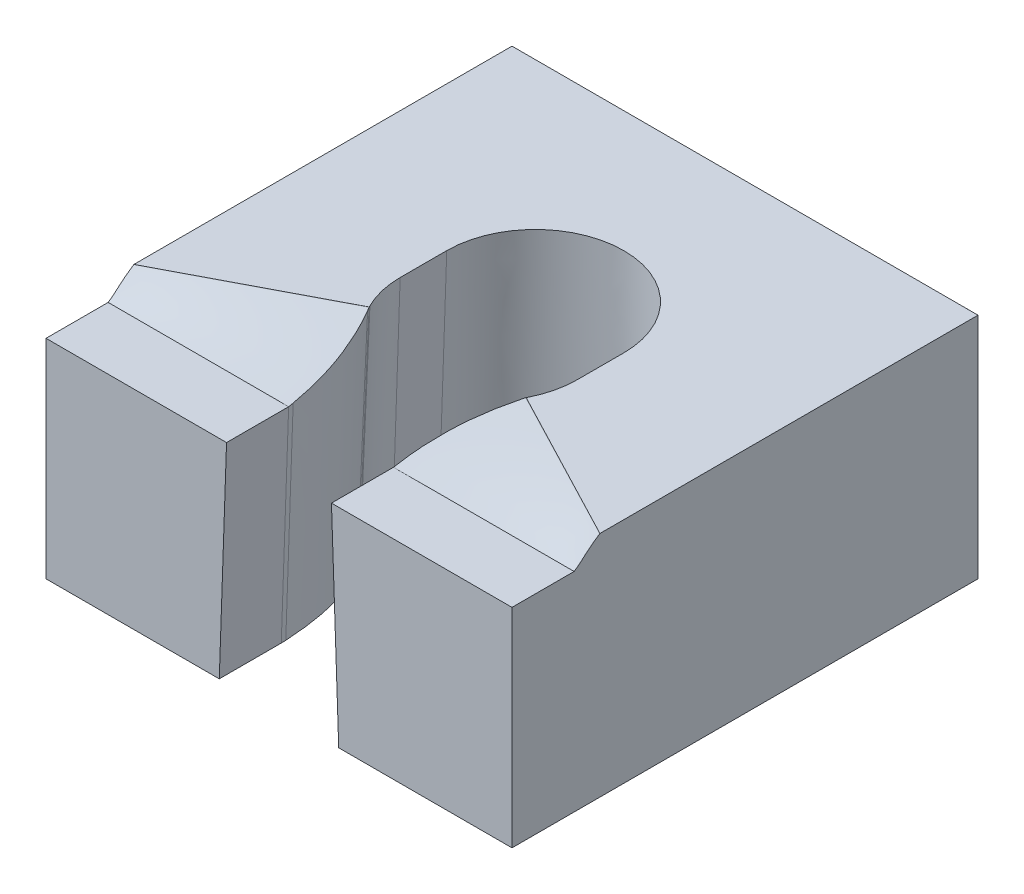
ISO-10303-21;
HEADER;
FILE_DESCRIPTION(('STEP AP214'),'2;1');
FILE_NAME('part.step','',(''),(''),'','','');
FILE_SCHEMA(('AUTOMOTIVE_DESIGN { 1 0 10303 214 1 1 1 1 }'));
ENDSEC;
DATA;
#1=APPLICATION_CONTEXT('core data for automotive mechanical design processes');
#2=APPLICATION_PROTOCOL_DEFINITION('international standard','automotive_design',2000,#1);
#3=PRODUCT_CONTEXT('',#1,'mechanical');
#4=PRODUCT('Part','Part','',(#3));
#5=PRODUCT_RELATED_PRODUCT_CATEGORY('part','',(#4));
#6=PRODUCT_DEFINITION_FORMATION('','',#4);
#7=PRODUCT_DEFINITION_CONTEXT('part definition',#1,'design');
#8=PRODUCT_DEFINITION('design','',#6,#7);
#9=PRODUCT_DEFINITION_SHAPE('','',#8);
#10=(LENGTH_UNIT() NAMED_UNIT(*) SI_UNIT(.MILLI.,.METRE.));
#11=(NAMED_UNIT(*) PLANE_ANGLE_UNIT() SI_UNIT($,.RADIAN.));
#12=(NAMED_UNIT(*) SI_UNIT($,.STERADIAN.) SOLID_ANGLE_UNIT());
#13=UNCERTAINTY_MEASURE_WITH_UNIT(LENGTH_MEASURE(1.E-05),#10,'distance_accuracy_value','');
#14=(GEOMETRIC_REPRESENTATION_CONTEXT(3) GLOBAL_UNCERTAINTY_ASSIGNED_CONTEXT((#13)) GLOBAL_UNIT_ASSIGNED_CONTEXT((#10,
#11,#12)) REPRESENTATION_CONTEXT('',''));
#15=CARTESIAN_POINT('',(0.,0.,0.));
#16=DIRECTION('',(0.,0.,1.));
#17=DIRECTION('',(1.,0.,0.));
#18=AXIS2_PLACEMENT_3D('',#15,#16,#17);
#19=CARTESIAN_POINT('',(-30.,50.,50.));
#20=DIRECTION('',(0.,0.,1.));
#21=DIRECTION('',(1.,0.,0.));
#22=AXIS2_PLACEMENT_3D('',#19,#20,#21);
#23=PLANE('',#22);
#24=DIRECTION('',(0.0348994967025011,-0.999390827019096,-8.52995567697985E-10));
#25=VECTOR('',#24,1.);
#26=CARTESIAN_POINT('',(12.3026501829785,-35.2817253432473,49.9999999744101));
#27=LINE('',#26,#25);
#28=CARTESIAN_POINT('',(11.2556652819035,-5.30000053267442,50.));
#29=VERTEX_POINT('',#28);
#30=CARTESIAN_POINT('',(12.8166236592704,-49.9999999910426,49.9999999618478));
#31=VERTEX_POINT('',#30);
#32=EDGE_CURVE('E1853',#29,#31,#27,.T.);
#33=ORIENTED_EDGE('',*,*,#32,.T.);
#34=DIRECTION('',(-1.,0.,0.));
#35=VECTOR('',#34,1.);
#36=CARTESIAN_POINT('',(-30.,-50.,50.));
#37=LINE('',#36,#35);
#38=CARTESIAN_POINT('',(50.,-50.,50.));
#39=VERTEX_POINT('',#38);
#40=EDGE_CURVE('E2392',#39,#31,#37,.T.);
#41=ORIENTED_EDGE('',*,*,#40,.F.);
#42=DIRECTION('',(0.,-1.,0.));
#43=VECTOR('',#42,1.);
#44=CARTESIAN_POINT('',(50.,50.,50.));
#45=LINE('',#44,#43);
#46=CARTESIAN_POINT('',(50.,-5.29953587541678,50.));
#47=VERTEX_POINT('',#46);
#48=EDGE_CURVE('E1871',#47,#39,#45,.T.);
#49=ORIENTED_EDGE('',*,*,#48,.F.);
#50=CARTESIAN_POINT('',(10.05590096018,-5.30001494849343,49.9999999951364));
#51=CARTESIAN_POINT('',(13.6142674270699,-5.29997219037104,49.9999999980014));
#52=CARTESIAN_POINT('',(17.1726338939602,-5.29992945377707,49.999999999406));
#53=CARTESIAN_POINT('',(24.2893668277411,-5.29984402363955,50.000000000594));
#54=CARTESIAN_POINT('',(27.8477332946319,-5.29980133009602,50.0000000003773));
#55=CARTESIAN_POINT('',(37.6040665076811,-5.29968433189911,49.9999999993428));
#56=CARTESIAN_POINT('',(43.8020332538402,-5.2996100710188,49.999999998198));
#57=CARTESIAN_POINT('',(50.,-5.29953587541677,50.));
#58=B_SPLINE_CURVE_WITH_KNOTS('',3,(#50,#51,#52,#53,#54,#55,#56,#57),.UNSPECIFIED.,.F.,.F.,(4,2,
2,4),(0.,10.6750994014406,21.3501988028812,39.944099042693),.UNSPECIFIED.);
#59=EDGE_CURVE('E1870',#29,#47,#58,.T.);
#60=ORIENTED_EDGE('',*,*,#59,.F.);
#61=EDGE_LOOP('',(#33,#41,#49,#60));
#62=FACE_BOUND('',#61,.T.);
#63=ADVANCED_FACE('F1660',(#62),#23,.T.);
#64=CARTESIAN_POINT('',(50.,50.,130.));
#65=DIRECTION('',(1.,0.,0.));
#66=DIRECTION('',(0.,0.,-1.));
#67=AXIS2_PLACEMENT_3D('',#64,#65,#66);
#68=PLANE('',#67);
#69=CARTESIAN_POINT('',(50.,-5.29953587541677,50.));
#70=CARTESIAN_POINT('',(50.,-5.2992353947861,47.7777301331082));
#71=CARTESIAN_POINT('',(50.,-5.29889364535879,45.5554602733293));
#72=CARTESIAN_POINT('',(50.,-5.2981276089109,41.1109205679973));
#73=CARTESIAN_POINT('',(50.,-5.29770332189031,38.8886507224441));
#74=CARTESIAN_POINT('',(50.,-5.29723776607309,36.6663808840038));
#75=B_SPLINE_CURVE_WITH_KNOTS('',3,(#69,#70,#71,#72,#73,#74),.UNSPECIFIED.,.F.,.F.,(4,2,4),(0.,
6.66680965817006,13.3336193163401),.UNSPECIFIED.);
#76=CARTESIAN_POINT('',(50.,-5.29723779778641,36.6663808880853));
#77=VERTEX_POINT('',#76);
#78=EDGE_CURVE('E1873',#47,#77,#75,.T.);
#79=ORIENTED_EDGE('',*,*,#78,.F.);
#80=ORIENTED_EDGE('',*,*,#48,.T.);
#81=DIRECTION('',(0.,0.,1.));
#82=VECTOR('',#81,1.);
#83=CARTESIAN_POINT('',(50.,-50.,130.));
#84=LINE('',#83,#82);
#85=CARTESIAN_POINT('',(50.,-50.,-50.));
#86=VERTEX_POINT('',#85);
#87=EDGE_CURVE('E2401',#86,#39,#84,.T.);
#88=ORIENTED_EDGE('',*,*,#87,.F.);
#89=DIRECTION('',(0.,-1.,0.));
#90=VECTOR('',#89,1.);
#91=CARTESIAN_POINT('',(50.,50.,-50.));
#92=LINE('',#91,#90);
#93=CARTESIAN_POINT('',(50.,-1.,-50.));
#94=VERTEX_POINT('',#93);
#95=EDGE_CURVE('E2396',#94,#86,#92,.T.);
#96=ORIENTED_EDGE('',*,*,#95,.F.);
#97=DIRECTION('',(0.,0.,-1.));
#98=VECTOR('',#97,1.);
#99=CARTESIAN_POINT('',(50.,-1.,130.));
#100=LINE('',#99,#98);
#101=CARTESIAN_POINT('',(50.,-1.,31.1362512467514));
#102=VERTEX_POINT('',#101);
#103=EDGE_CURVE('E2408',#102,#94,#100,.T.);
#104=ORIENTED_EDGE('',*,*,#103,.F.);
#105=CARTESIAN_POINT('',(50.,-1.00971589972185,31.1526823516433));
#106=CARTESIAN_POINT('',(50.,-1.00647726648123,31.1472053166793));
#107=CARTESIAN_POINT('',(50.,-1.00323863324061,31.1417282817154));
#108=CARTESIAN_POINT('',(50.,-0.999999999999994,31.1362512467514));
#109=B_SPLINE_CURVE_WITH_KNOTS('',3,(#105,#106,#107,#108),.UNSPECIFIED.,.F.,.F.,(4,4),(0.,
0.0190887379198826),.UNSPECIFIED.);
#110=CARTESIAN_POINT('',(50.00000985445,-1.00965872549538,31.152623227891));
#111=VERTEX_POINT('',#110);
#112=EDGE_CURVE('E1684',#111,#102,#109,.T.);
#113=ORIENTED_EDGE('',*,*,#112,.F.);
#114=CARTESIAN_POINT('',(50.,-5.29723779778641,36.6663808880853));
#115=CARTESIAN_POINT('',(50.,-5.24013104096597,36.5802068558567));
#116=CARTESIAN_POINT('',(50.,-5.18247334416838,36.4943850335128));
#117=CARTESIAN_POINT('',(50.,-5.06577812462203,36.3240183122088));
#118=CARTESIAN_POINT('',(50.,-5.00674463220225,36.2394706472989));
#119=CARTESIAN_POINT('',(50.,-4.8868369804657,36.0719256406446));
#120=CARTESIAN_POINT('',(50.,-4.82596650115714,35.9889256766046));
#121=CARTESIAN_POINT('',(50.,-4.70197538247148,35.8247203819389));
#122=CARTESIAN_POINT('',(50.,-4.6388565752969,35.7435136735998));
#123=CARTESIAN_POINT('',(50.,-4.5422248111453,35.6231761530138));
#124=CARTESIAN_POINT('',(50.,-4.50966325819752,35.5832794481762));
#125=CARTESIAN_POINT('',(50.,-4.44385140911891,35.5040583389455));
#126=CARTESIAN_POINT('',(50.,-4.41060112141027,35.4647339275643));
#127=CARTESIAN_POINT('',(50.,-4.30995784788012,35.3474711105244));
#128=CARTESIAN_POINT('',(50.,-4.24170083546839,35.2702782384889));
#129=CARTESIAN_POINT('',(50.,-4.13889560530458,35.1548427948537));
#130=CARTESIAN_POINT('',(50.,-4.10454947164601,35.1164146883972));
#131=CARTESIAN_POINT('',(50.,-4.03592991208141,35.039493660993));
#132=CARTESIAN_POINT('',(50.,-4.00165648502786,35.0010007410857));
#133=CARTESIAN_POINT('',(50.,-3.93327499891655,34.9238686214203));
#134=CARTESIAN_POINT('',(50.,-3.89916693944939,34.8852294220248));
#135=CARTESIAN_POINT('',(50.,-3.83109416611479,34.8078244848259));
#136=CARTESIAN_POINT('',(50.,-3.79712945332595,34.7690587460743));
#137=CARTESIAN_POINT('',(50.,-3.68085820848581,34.6358462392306));
#138=CARTESIAN_POINT('',(50.,-3.59891082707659,34.5410855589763));
#139=CARTESIAN_POINT('',(50.,-3.43586569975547,34.3508667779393));
#140=CARTESIAN_POINT('',(50.,-3.35476780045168,34.2554088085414));
#141=CARTESIAN_POINT('',(50.,-3.19338493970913,34.0638141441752));
#142=CARTESIAN_POINT('',(50.,-3.11309994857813,33.9676774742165));
#143=CARTESIAN_POINT('',(50.,-2.9533674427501,33.7748007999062));
#144=CARTESIAN_POINT('',(50.,-2.87391948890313,33.6780611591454));
#145=CARTESIAN_POINT('',(50.,-2.71577819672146,33.4839603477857));
#146=CARTESIAN_POINT('',(50.,-2.63708489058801,33.3865991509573));
#147=CARTESIAN_POINT('',(50.,-2.480514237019,33.191218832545));
#148=CARTESIAN_POINT('',(50.,-2.40263690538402,33.0931996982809));
#149=CARTESIAN_POINT('',(50.,-2.24773161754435,32.8958727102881));
#150=CARTESIAN_POINT('',(50.,-2.17070814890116,32.7965613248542));
#151=CARTESIAN_POINT('',(50.,-2.01812929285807,32.5968215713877));
#152=CARTESIAN_POINT('',(50.,-1.94257385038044,32.496393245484));
#153=CARTESIAN_POINT('',(50.,-1.79305084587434,32.2943675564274));
#154=CARTESIAN_POINT('',(50.,-1.7190832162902,32.1927702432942));
#155=CARTESIAN_POINT('',(50.,-1.57265231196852,31.9881660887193));
#156=CARTESIAN_POINT('',(50.,-1.5001926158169,31.8851566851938));
#157=CARTESIAN_POINT('',(50.,-1.35700353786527,31.677928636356));
#158=CARTESIAN_POINT('',(50.,-1.28627430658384,31.573709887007));
#159=CARTESIAN_POINT('',(50.,-1.14658447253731,31.3640622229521));
#160=CARTESIAN_POINT('',(50.,-1.07762424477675,31.2586330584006));
#161=CARTESIAN_POINT('',(50.,-1.00957930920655,31.1526157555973));
#162=B_SPLINE_CURVE_WITH_KNOTS('',3,(#114,#115,#116,#117,#118,#119,#120,#121,#122,#123,#124,
#125,#126,#127,#128,#129,#130,#131,#132,#133,#134,#135,#136,#137,#138,#139,#140,#141,#142,#143,
#144,#145,#146,#147,#148,#149,#150,#151,#152,#153,#154,#155,#156,#157,#158,#159,#160,#161),
.UNSPECIFIED.,.F.,.F.,(4,2,2,2,2,2,2,2,2,2,2,2,2,2,2,2,2,2,2,2,2,2,2,4),(0.,0.310150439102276,
0.619484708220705,0.928235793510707,1.23674078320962,1.39122718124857,1.54571169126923,
1.85481610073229,2.00943786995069,2.16405718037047,2.31867610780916,2.47329619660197,
2.84912914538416,3.22489301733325,3.60064311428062,3.976185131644,4.35174310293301,
4.72730833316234,5.10433581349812,5.48134912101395,5.85834635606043,6.23615461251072,
6.61399561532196,6.9919160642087),.UNSPECIFIED.);
#163=EDGE_CURVE('E1679',#77,#111,#162,.T.);
#164=ORIENTED_EDGE('',*,*,#163,.F.);
#165=EDGE_LOOP('',(#79,#80,#88,#96,#104,#113,#164));
#166=FACE_BOUND('',#165,.T.);
#167=ADVANCED_FACE('F2024',(#166),#68,.T.);
#168=DIRECTION('',(0.0348994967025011,0.999390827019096,2.33561318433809E-10));
#169=VECTOR('',#168,1.);
#170=CARTESIAN_POINT('',(-12.3026499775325,-35.2817268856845,49.9999999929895));
#171=LINE('',#170,#169);
#172=CARTESIAN_POINT('',(-12.8166234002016,-49.9999999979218,49.9999999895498));
#173=VERTEX_POINT('',#172);
#174=CARTESIAN_POINT('',(-11.2556650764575,-5.30000207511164,49.9999999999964));
#175=VERTEX_POINT('',#174);
#176=EDGE_CURVE('E2256',#173,#175,#171,.T.);
#177=ORIENTED_EDGE('',*,*,#176,.T.);
#178=CARTESIAN_POINT('',(-50.,-5.29818883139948,50.));
#179=CARTESIAN_POINT('',(-46.4416589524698,-5.29835534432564,50.));
#180=CARTESIAN_POINT('',(-42.8833179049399,-5.29852186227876,50.));
#181=CARTESIAN_POINT('',(-35.7666358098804,-5.29885490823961,50.));
#182=CARTESIAN_POINT('',(-32.2082947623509,-5.29902143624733,50.));
#183=CARTESIAN_POINT('',(-22.5333352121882,-5.29947423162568,50.));
#184=CARTESIAN_POINT('',(-16.4167167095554,-5.29976050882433,50.));
#185=CARTESIAN_POINT('',(-10.3000982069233,-5.30004680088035,50.));
#186=B_SPLINE_CURVE_WITH_KNOTS('',3,(#178,#179,#180,#181,#182,#183,#184,#185),.UNSPECIFIED.,.F.,
.F.,(4,2,2,4),(0.,10.6750231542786,21.3500463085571,39.6999018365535),.UNSPECIFIED.);
#187=CARTESIAN_POINT('',(-50.,-5.29818883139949,50.));
#188=VERTEX_POINT('',#187);
#189=EDGE_CURVE('E1944',#188,#175,#186,.T.);
#190=ORIENTED_EDGE('',*,*,#189,.F.);
#191=DIRECTION('',(0.,-1.,0.));
#192=VECTOR('',#191,1.);
#193=CARTESIAN_POINT('',(-50.,50.,50.));
#194=LINE('',#193,#192);
#195=CARTESIAN_POINT('',(-50.,-50.,50.));
#196=VERTEX_POINT('',#195);
#197=EDGE_CURVE('E2389',#188,#196,#194,.T.);
#198=ORIENTED_EDGE('',*,*,#197,.T.);
#199=EDGE_CURVE('E2260',#173,#196,#37,.T.);
#200=ORIENTED_EDGE('',*,*,#199,.F.);
#201=EDGE_LOOP('',(#177,#190,#198,#200));
#202=FACE_BOUND('',#201,.T.);
#203=ADVANCED_FACE('F1662',(#202),#23,.T.);
#204=CARTESIAN_POINT('',(-30.,-50.,-30.));
#205=DIRECTION('',(0.,-1.,0.));
#206=DIRECTION('',(0.,0.,-1.));
#207=AXIS2_PLACEMENT_3D('',#204,#205,#206);
#208=PLANE('',#207);
#209=DIRECTION('',(3.77989197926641E-08,0.,0.999999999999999));
#210=VECTOR('',#209,1.);
#211=CARTESIAN_POINT('',(12.8166206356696,-50.,-30.000001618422));
#212=LINE('',#211,#210);
#213=CARTESIAN_POINT('',(12.8164599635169,-49.9999943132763,36.6929833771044));
#214=VERTEX_POINT('',#213);
#215=EDGE_CURVE('E1860',#214,#31,#212,.T.);
#216=ORIENTED_EDGE('',*,*,#215,.F.);
#217=CARTESIAN_POINT('',(12.8378614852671,-50.,35.7093435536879));
#218=CARTESIAN_POINT('',(12.8360723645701,-50.,35.7934196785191));
#219=CARTESIAN_POINT('',(12.8342750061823,-50.,35.8774956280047));
#220=CARTESIAN_POINT('',(12.8306636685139,-50.,36.0456471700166));
#221=CARTESIAN_POINT('',(12.8288496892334,-50.,36.1297227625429));
#222=CARTESIAN_POINT('',(12.8235180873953,-50.,36.3756983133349));
#223=CARTESIAN_POINT('',(12.8199777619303,-50.,36.5375977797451));
#224=CARTESIAN_POINT('',(12.8164058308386,-50.,36.6994965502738));
#225=B_SPLINE_CURVE_WITH_KNOTS('',3,(#217,#218,#219,#220,#221,#222,#223,#224),.UNSPECIFIED.,.F.,
.F.,(4,2,2,4),(0.,0.252285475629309,0.504570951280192,0.99038545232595),.UNSPECIFIED.);
#226=CARTESIAN_POINT('',(12.8378614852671,-50.,35.7093435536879));
#227=VERTEX_POINT('',#226);
#228=EDGE_CURVE('E1991',#227,#214,#225,.T.);
#229=ORIENTED_EDGE('',*,*,#228,.F.);
#230=CARTESIAN_POINT('',(17.9987935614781,-50.,15.2834434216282));
#231=CARTESIAN_POINT('',(17.8976443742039,-50.,15.4947828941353));
#232=CARTESIAN_POINT('',(17.796788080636,-50.,15.7062650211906));
#233=CARTESIAN_POINT('',(17.5960326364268,-50.,16.1297981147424));
#234=CARTESIAN_POINT('',(17.4961339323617,-50.,16.3418492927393));
#235=CARTESIAN_POINT('',(17.2977323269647,-50.,16.7666665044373));
#236=CARTESIAN_POINT('',(17.1992297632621,-50.,16.9794326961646));
#237=CARTESIAN_POINT('',(17.0040553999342,-50.,17.4058222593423));
#238=CARTESIAN_POINT('',(16.9073837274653,-50.,17.6194456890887));
#239=CARTESIAN_POINT('',(16.7163460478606,-50.,18.0475896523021));
#240=CARTESIAN_POINT('',(16.6219788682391,-50.,18.2621096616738));
#241=CARTESIAN_POINT('',(16.4359318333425,-50.,18.6922842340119));
#242=CARTESIAN_POINT('',(16.344251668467,-50.,18.9079386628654));
#243=CARTESIAN_POINT('',(16.163989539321,-50.,19.3405134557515));
#244=CARTESIAN_POINT('',(16.0754072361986,-50.,19.5574336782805));
#245=CARTESIAN_POINT('',(15.9017921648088,-50.,19.9926852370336));
#246=CARTESIAN_POINT('',(15.8167593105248,-50.,20.2110165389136));
#247=CARTESIAN_POINT('',(15.622500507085,-50.,20.7228931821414));
#248=CARTESIAN_POINT('',(15.5147703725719,-50.,21.0170078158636));
#249=CARTESIAN_POINT('',(15.3061621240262,-50.,21.6076910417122));
#250=CARTESIAN_POINT('',(15.2052847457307,-50.,21.9042598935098));
#251=CARTESIAN_POINT('',(15.0105397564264,-50.,22.4997062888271));
#252=CARTESIAN_POINT('',(14.9166724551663,-50.,22.7985839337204));
#253=CARTESIAN_POINT('',(14.7360630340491,-50.,23.3986059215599));
#254=CARTESIAN_POINT('',(14.6493235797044,-50.,23.6997510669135));
#255=CARTESIAN_POINT('',(14.4831460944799,-50.,24.3040319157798));
#256=CARTESIAN_POINT('',(14.4037076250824,-50.,24.6071674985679));
#257=CARTESIAN_POINT('',(14.2523640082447,-50.,25.2152754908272));
#258=CARTESIAN_POINT('',(14.1804580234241,-50.,25.5202476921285));
#259=CARTESIAN_POINT('',(14.0216100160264,-50.,26.2313825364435));
#260=CARTESIAN_POINT('',(13.9373972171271,-50.,26.6381554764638));
#261=CARTESIAN_POINT('',(13.7803462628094,-50.,27.4539642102));
#262=CARTESIAN_POINT('',(13.7075105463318,-50.,27.8630004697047));
#263=CARTESIAN_POINT('',(13.5719871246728,-50.,28.682912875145));
#264=CARTESIAN_POINT('',(13.5093035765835,-50.,29.09378970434));
#265=CARTESIAN_POINT('',(13.3928537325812,-50.,29.9169510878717));
#266=CARTESIAN_POINT('',(13.3390907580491,-50.,30.3292361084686));
#267=CARTESIAN_POINT('',(13.2392416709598,-50.,31.1550884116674));
#268=CARTESIAN_POINT('',(13.1931622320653,-50.,31.5686564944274));
#269=CARTESIAN_POINT('',(13.1075452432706,-50.,32.3963496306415));
#270=CARTESIAN_POINT('',(13.0680059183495,-50.,32.8104745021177));
#271=CARTESIAN_POINT('',(12.9943128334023,-50.,33.6388524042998));
#272=CARTESIAN_POINT('',(12.9601546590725,-50.,34.0531050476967));
#273=CARTESIAN_POINT('',(12.8961074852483,-50.,34.8813220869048));
#274=CARTESIAN_POINT('',(12.8662122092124,-50.,35.2952859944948));
#275=CARTESIAN_POINT('',(12.8378614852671,-50.,35.7093435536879));
#276=B_SPLINE_CURVE_WITH_KNOTS('',3,(#230,#231,#232,#233,#234,#235,#236,#237,#238,#239,#240,
#241,#242,#243,#244,#245,#246,#247,#248,#249,#250,#251,#252,#253,#254,#255,#256,#257,#258,#259,
#260,#261,#262,#263,#264,#265,#266,#267,#268,#269,#270,#271,#272,#273,#274,#275),.UNSPECIFIED.,
.F.,.F.,(4,2,2,2,2,2,2,2,2,2,2,2,2,2,2,2,2,2,2,2,2,2,4),(0.,0.702897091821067,1.40610742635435,
2.10948501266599,2.81291127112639,3.5159718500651,4.21895110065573,4.9218532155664,
5.62473828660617,6.56432130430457,7.50400504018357,8.44373027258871,9.38380533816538,
10.3238239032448,11.2637378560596,12.5097415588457,13.7560120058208,15.002791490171,
16.2500341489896,17.4983545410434,18.7463355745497,19.9932874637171,21.2383839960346),.UNSPECIFIED.);
#277=CARTESIAN_POINT('',(18.0021109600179,-49.999999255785,15.2768394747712));
#278=VERTEX_POINT('',#277);
#279=EDGE_CURVE('E1993',#278,#227,#276,.T.);
#280=ORIENTED_EDGE('',*,*,#279,.F.);
#281=CARTESIAN_POINT('',(18.3309125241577,-50.,14.6394407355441));
#282=CARTESIAN_POINT('',(18.3163888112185,-50.,14.6671806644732));
#283=CARTESIAN_POINT('',(18.3018704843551,-50.,14.6949234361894));
#284=CARTESIAN_POINT('',(18.2728619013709,-50.,14.7504236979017));
#285=CARTESIAN_POINT('',(18.2583716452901,-50.,14.7781811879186));
#286=CARTESIAN_POINT('',(18.2294365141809,-50.,14.8337198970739));
#287=CARTESIAN_POINT('',(18.2149916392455,-50.,14.8615011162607));
#288=CARTESIAN_POINT('',(18.1861667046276,-50.,14.917097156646));
#289=CARTESIAN_POINT('',(18.1717866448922,-50.,14.9449119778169));
#290=CARTESIAN_POINT('',(18.131565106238,-50.,15.0229718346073));
#291=CARTESIAN_POINT('',(18.10580929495,-50.,15.073260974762));
#292=CARTESIAN_POINT('',(18.0544362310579,-50.,15.1739103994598));
#293=CARTESIAN_POINT('',(18.0288189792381,-50.,15.2242706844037));
#294=CARTESIAN_POINT('',(18.0032167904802,-50.,15.2746381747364));
#295=B_SPLINE_CURVE_WITH_KNOTS('',3,(#281,#282,#283,#284,#285,#286,#287,#288,#289,#290,#291,
#292,#293,#294),.UNSPECIFIED.,.F.,.F.,(4,2,2,2,2,2,4),(0.,0.0939360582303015,0.187872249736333,
0.281808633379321,0.37574494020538,0.545247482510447,0.714750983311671),.UNSPECIFIED.);
#296=CARTESIAN_POINT('',(18.330914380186,-50.000000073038,14.6394417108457));
#297=VERTEX_POINT('',#296);
#298=EDGE_CURVE('E3016',#297,#278,#295,.T.);
#299=ORIENTED_EDGE('',*,*,#298,.F.);
#300=DIRECTION('',(-0.4651783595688,0.,0.885216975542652));
#301=VECTOR('',#300,1.);
#302=CARTESIAN_POINT('',(26.2543439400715,-50.,-0.438543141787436));
#303=LINE('',#302,#301);
#304=CARTESIAN_POINT('',(18.3397648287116,-50.0000001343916,14.6226124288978));
#305=VERTEX_POINT('',#304);
#306=EDGE_CURVE('E2679',#305,#297,#303,.T.);
#307=ORIENTED_EDGE('',*,*,#306,.F.);
#308=DIRECTION('',(-0.465705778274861,0.,0.884939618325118));
#309=VECTOR('',#308,1.);
#310=CARTESIAN_POINT('',(26.2456872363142,-50.,-0.400306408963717));
#311=LINE('',#310,#309);
#312=CARTESIAN_POINT('',(18.3567305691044,-49.999999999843,14.5903821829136));
#313=VERTEX_POINT('',#312);
#314=EDGE_CURVE('E2674',#313,#305,#311,.T.);
#315=ORIENTED_EDGE('',*,*,#314,.F.);
#316=DIRECTION('',(-0.461202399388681,0.,0.887294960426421));
#317=VECTOR('',#316,1.);
#318=CARTESIAN_POINT('',(26.3182744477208,-50.,-0.72661914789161));
#319=LINE('',#318,#317);
#320=CARTESIAN_POINT('',(18.3732286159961,-50.,14.5586420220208));
#321=VERTEX_POINT('',#320);
#322=EDGE_CURVE('E2671',#321,#313,#319,.T.);
#323=ORIENTED_EDGE('',*,*,#322,.F.);
#324=CARTESIAN_POINT('',(18.5327287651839,-50.,14.2456006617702));
#325=CARTESIAN_POINT('',(18.5192291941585,-50.,14.2721889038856));
#326=CARTESIAN_POINT('',(18.5057199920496,-50.,14.298772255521));
#327=CARTESIAN_POINT('',(18.4786823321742,-50.,14.3519291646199));
#328=CARTESIAN_POINT('',(18.4651538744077,-50.,14.3785027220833));
#329=CARTESIAN_POINT('',(18.4255224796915,-50.,14.4562798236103));
#330=CARTESIAN_POINT('',(18.3993934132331,-50.,14.5074700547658));
#331=CARTESIAN_POINT('',(18.3732286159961,-50.,14.5586420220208));
#332=B_SPLINE_CURVE_WITH_KNOTS('',3,(#324,#325,#326,#327,#328,#329,#330,#331),.UNSPECIFIED.,.F.,
.F.,(4,2,2,4),(0.,0.0894570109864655,0.178914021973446,0.351333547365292),.UNSPECIFIED.);
#333=CARTESIAN_POINT('',(18.5327287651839,-50.,14.2456006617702));
#334=VERTEX_POINT('',#333);
#335=EDGE_CURVE('E2160',#334,#321,#332,.T.);
#336=ORIENTED_EDGE('',*,*,#335,.F.);
#337=CARTESIAN_POINT('',(20.7109431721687,-50.,4.99999999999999));
#338=CARTESIAN_POINT('',(20.6908608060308,-50.,5.40838909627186));
#339=CARTESIAN_POINT('',(20.668851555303,-50.,5.81694795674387));
#340=CARTESIAN_POINT('',(20.6132538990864,-50.,6.63381488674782));
#341=CARTESIAN_POINT('',(20.5796493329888,-50.0000000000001,7.04212180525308));
#342=CARTESIAN_POINT('',(20.521955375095,-50.,7.58545745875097));
#343=CARTESIAN_POINT('',(20.5064359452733,-50.,7.72137049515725));
#344=CARTESIAN_POINT('',(20.4729488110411,-50.,7.99289932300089));
#345=CARTESIAN_POINT('',(20.4549810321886,-50.,8.12851510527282));
#346=CARTESIAN_POINT('',(20.4163050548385,-50.,8.39936775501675));
#347=CARTESIAN_POINT('',(20.395596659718,-50.,8.53460459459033));
#348=CARTESIAN_POINT('',(20.3511612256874,-50.,8.80448933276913));
#349=CARTESIAN_POINT('',(20.3274362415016,-50.,8.93913756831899));
#350=CARTESIAN_POINT('',(20.2766838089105,-50.,9.2078039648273));
#351=CARTESIAN_POINT('',(20.2496565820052,-50.,9.34182216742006));
#352=CARTESIAN_POINT('',(20.1919865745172,-50.,9.6090465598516));
#353=CARTESIAN_POINT('',(20.1613446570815,-49.9999999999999,9.74225293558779));
#354=CARTESIAN_POINT('',(20.0828561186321,-49.9999999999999,10.062877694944));
#355=CARTESIAN_POINT('',(20.033148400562,-50.,10.2498419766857));
#356=CARTESIAN_POINT('',(19.9272726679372,-50.,10.6219944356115));
#357=CARTESIAN_POINT('',(19.8711021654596,-50.,10.8071818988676));
#358=CARTESIAN_POINT('',(19.7531299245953,-50.,11.1758934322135));
#359=CARTESIAN_POINT('',(19.6913241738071,-50.,11.3594162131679));
#360=CARTESIAN_POINT('',(19.5629443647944,-50.,11.7249117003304));
#361=CARTESIAN_POINT('',(19.4963672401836,-50.,11.906883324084));
#362=CARTESIAN_POINT('',(19.3588715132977,-50.,12.2705126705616));
#363=CARTESIAN_POINT('',(19.2879277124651,-50.,12.4521608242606));
#364=CARTESIAN_POINT('',(19.1429430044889,-50.,12.8141134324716));
#365=CARTESIAN_POINT('',(19.0689035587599,-50.,12.9944184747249));
#366=CARTESIAN_POINT('',(18.9185923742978,-50.,13.3537937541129));
#367=CARTESIAN_POINT('',(18.8423239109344,-50.,13.5328653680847));
#368=CARTESIAN_POINT('',(18.6884113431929,-50.,13.889885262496));
#369=CARTESIAN_POINT('',(18.6107711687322,-50.,14.0678352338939));
#370=CARTESIAN_POINT('',(18.5327287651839,-50.,14.2456006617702));
#371=B_SPLINE_CURVE_WITH_KNOTS('',3,(#337,#338,#339,#340,#341,#342,#343,#344,#345,#346,#347,
#348,#349,#350,#351,#352,#353,#354,#355,#356,#357,#358,#359,#360,#361,#362,#363,#364,#365,#366,
#367,#368,#369,#370),.UNSPECIFIED.,.F.,.F.,(4,2,2,2,2,2,2,2,2,2,2,2,2,2,2,2,4),(0.,
1.22708670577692,2.45589057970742,2.8662566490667,3.27663519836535,3.68704320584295,
4.09717315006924,4.50727559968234,4.91728031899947,5.49751421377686,6.0779722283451,
6.65884681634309,7.24009811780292,7.82509278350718,8.4098143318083,8.99371606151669,
9.57615334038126),.UNSPECIFIED.);
#372=CARTESIAN_POINT('',(20.7109431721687,-50.,4.99999999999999));
#373=VERTEX_POINT('',#372);
#374=EDGE_CURVE('E2153',#373,#334,#371,.T.);
#375=ORIENTED_EDGE('',*,*,#374,.F.);
#376=DIRECTION('',(0.,0.,1.));
#377=VECTOR('',#376,1.);
#378=CARTESIAN_POINT('',(20.7109431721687,-50.,-30.));
#379=LINE('',#378,#377);
#380=CARTESIAN_POINT('',(20.7109431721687,-50.,-5.));
#381=VERTEX_POINT('',#380);
#382=EDGE_CURVE('E2454',#381,#373,#379,.T.);
#383=ORIENTED_EDGE('',*,*,#382,.F.);
#384=CARTESIAN_POINT('',(-20.7109431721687,-50.,-4.99999999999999));
#385=CARTESIAN_POINT('',(-20.6911470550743,-50.,-5.27759670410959));
#386=CARTESIAN_POINT('',(-20.6706935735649,-50.,-5.55516597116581));
#387=CARTESIAN_POINT('',(-20.6266119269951,-50.,-6.11168038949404));
#388=CARTESIAN_POINT('',(-20.60296591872,-50.,-6.39062410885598));
#389=CARTESIAN_POINT('',(-20.5507350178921,-50.,-6.9490842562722));
#390=CARTESIAN_POINT('',(-20.522132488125,-50.,-7.22859908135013));
#391=CARTESIAN_POINT('',(-20.458308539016,-50.,-7.78739026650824));
#392=CARTESIAN_POINT('',(-20.4230753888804,-50.,-8.06666530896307));
#393=CARTESIAN_POINT('',(-20.3444208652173,-50.,-8.62418054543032));
#394=CARTESIAN_POINT('',(-20.3009964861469,-50.,-8.90242032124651));
#395=CARTESIAN_POINT('',(-20.2048398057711,-50.,-9.4554137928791));
#396=CARTESIAN_POINT('',(-20.1521707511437,-50.,-9.73017837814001));
#397=CARTESIAN_POINT('',(-20.0361767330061,-50.,-10.2770613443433));
#398=CARTESIAN_POINT('',(-19.9728668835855,-50.,-10.5491829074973));
#399=CARTESIAN_POINT('',(-19.8346289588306,-50.,-11.0900508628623));
#400=CARTESIAN_POINT('',(-19.7597179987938,-50.,-11.3588016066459));
#401=CARTESIAN_POINT('',(-19.5975460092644,-50.,-11.8922610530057));
#402=CARTESIAN_POINT('',(-19.5102977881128,-50.,-12.1569736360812));
#403=CARTESIAN_POINT('',(-19.322950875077,-50.,-12.6817567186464));
#404=CARTESIAN_POINT('',(-19.2228550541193,-50.,-12.9418282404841));
#405=CARTESIAN_POINT('',(-19.0151376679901,-50.,-13.4432861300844));
#406=CARTESIAN_POINT('',(-18.9081714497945,-50.,-13.6849439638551));
#407=CARTESIAN_POINT('',(-18.682524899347,-50.,-14.1629520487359));
#408=CARTESIAN_POINT('',(-18.5638358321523,-50.,-14.3992981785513));
#409=CARTESIAN_POINT('',(-18.3150678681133,-50.,-14.866008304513));
#410=CARTESIAN_POINT('',(-18.1849855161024,-50.,-15.0963704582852));
#411=CARTESIAN_POINT('',(-17.9139519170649,-50.,-15.5505457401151));
#412=CARTESIAN_POINT('',(-17.7730027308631,-50.,-15.7743600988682));
#413=CARTESIAN_POINT('',(-17.4810625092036,-50.,-16.2147614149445));
#414=CARTESIAN_POINT('',(-17.3300897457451,-50.,-16.4313604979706));
#415=CARTESIAN_POINT('',(-17.0185843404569,-50.,-16.8575034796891));
#416=CARTESIAN_POINT('',(-16.8580534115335,-50.,-17.0670486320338));
#417=CARTESIAN_POINT('',(-16.5280812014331,-50.,-17.4790327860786));
#418=CARTESIAN_POINT('',(-16.3586388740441,-50.,-17.681470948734));
#419=CARTESIAN_POINT('',(-16.0117710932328,-50.,-18.0793997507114));
#420=CARTESIAN_POINT('',(-15.8343448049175,-50.,-18.2748896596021));
#421=CARTESIAN_POINT('',(-15.3467220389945,-50.,-18.7923728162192));
#422=CARTESIAN_POINT('',(-15.0297978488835,-50.,-19.1080555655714));
#423=CARTESIAN_POINT('',(-14.378084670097,-50.,-19.7204498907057));
#424=CARTESIAN_POINT('',(-14.0432919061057,-50.,-20.0171574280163));
#425=CARTESIAN_POINT('',(-13.3577569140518,-50.,-20.5916468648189));
#426=CARTESIAN_POINT('',(-13.0070119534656,-50.,-20.8694255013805));
#427=CARTESIAN_POINT('',(-12.2890411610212,-50.,-21.4072293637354));
#428=CARTESIAN_POINT('',(-11.9217325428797,-50.,-21.6671439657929));
#429=CARTESIAN_POINT('',(-11.1737482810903,-50.,-22.1668010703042));
#430=CARTESIAN_POINT('',(-10.7930756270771,-50.,-22.4065480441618));
#431=CARTESIAN_POINT('',(-10.0193108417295,-50.,-22.8649943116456));
#432=CARTESIAN_POINT('',(-9.62621922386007,-50.,-23.0836944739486));
#433=CARTESIAN_POINT('',(-8.62233558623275,-50.,-23.6061700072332));
#434=CARTESIAN_POINT('',(-8.00395275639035,-50.,-23.8955544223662));
#435=CARTESIAN_POINT('',(-6.74359858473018,-50.,-24.4179528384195));
#436=CARTESIAN_POINT('',(-6.10162102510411,-50.,-24.6509518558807));
#437=CARTESIAN_POINT('',(-4.80227012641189,-50.,-25.0523142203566));
#438=CARTESIAN_POINT('',(-4.1450345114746,-50.,-25.2211148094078));
#439=CARTESIAN_POINT('',(-3.14892673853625,-50.,-25.4215175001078));
#440=CARTESIAN_POINT('',(-2.81521573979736,-50.,-25.4795155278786));
#441=CARTESIAN_POINT('',(-2.1450790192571,-50.,-25.5769043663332));
#442=CARTESIAN_POINT('',(-1.80865375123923,-50.0000000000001,-25.6162982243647));
#443=CARTESIAN_POINT('',(-1.27552369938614,-50.,-25.6630299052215));
#444=CARTESIAN_POINT('',(-1.0793682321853,-50.,-25.6768829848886));
#445=CARTESIAN_POINT('',(-0.68670271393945,-50.,-25.6977688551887));
#446=CARTESIAN_POINT('',(-0.490192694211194,-50.,-25.7048022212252));
#447=CARTESIAN_POINT('',(-0.0970297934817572,-50.,-25.7118200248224));
#448=CARTESIAN_POINT('',(0.0996230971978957,-50.,-25.711803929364));
#449=CARTESIAN_POINT('',(0.492798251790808,-50.,-25.7047248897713));
#450=CARTESIAN_POINT('',(0.689320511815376,-50.,-25.6976617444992));
#451=CARTESIAN_POINT('',(1.27829283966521,-50.,-25.666237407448));
#452=CARTESIAN_POINT('',(1.67023834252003,-50.,-25.6316427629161));
#453=CARTESIAN_POINT('',(2.4518307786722,-50.,-25.5366550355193));
#454=CARTESIAN_POINT('',(2.84147039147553,-50.,-25.4762030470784));
#455=CARTESIAN_POINT('',(3.61628343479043,-50.,-25.3311437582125));
#456=CARTESIAN_POINT('',(4.00145602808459,-50.,-25.2465320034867));
#457=CARTESIAN_POINT('',(4.76616675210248,-50.,-25.0547480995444));
#458=CARTESIAN_POINT('',(5.14570409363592,-50.,-24.9475728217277));
#459=CARTESIAN_POINT('',(5.9386536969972,-50.,-24.6995013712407));
#460=CARTESIAN_POINT('',(6.35131879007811,-50.,-24.5562181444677));
#461=CARTESIAN_POINT('',(7.16746333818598,-50.,-24.2456743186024));
#462=CARTESIAN_POINT('',(7.57094333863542,-50.,-24.0784151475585));
#463=CARTESIAN_POINT('',(8.36786537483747,-50.,-23.7215137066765));
#464=CARTESIAN_POINT('',(8.76130730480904,-50.,-23.5318712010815));
#465=CARTESIAN_POINT('',(9.53896723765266,-50.,-23.1307227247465));
#466=CARTESIAN_POINT('',(9.92313941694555,-50.,-22.919128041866));
#467=CARTESIAN_POINT('',(10.6797035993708,-50.,-22.4758732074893));
#468=CARTESIAN_POINT('',(11.0520959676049,-50.,-22.2442136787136));
#469=CARTESIAN_POINT('',(11.7842564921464,-50.,-21.7616708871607));
#470=CARTESIAN_POINT('',(12.144023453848,-50.,-21.5107858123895));
#471=CARTESIAN_POINT('',(12.8571776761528,-50.,-20.9850154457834));
#472=CARTESIAN_POINT('',(13.2102778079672,-50.,-20.709740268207));
#473=CARTESIAN_POINT('',(13.900787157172,-50.,-20.1401613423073));
#474=CARTESIAN_POINT('',(14.238196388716,-50.,-19.845857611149));
#475=CARTESIAN_POINT('',(14.8955989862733,-50.,-19.2381086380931));
#476=CARTESIAN_POINT('',(15.2155870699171,-50.,-18.9246576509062));
#477=CARTESIAN_POINT('',(15.67896975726,-50.,-18.4414149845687));
#478=CARTESIAN_POINT('',(15.8300201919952,-50.,-18.2789175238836));
#479=CARTESIAN_POINT('',(16.1267305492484,-50.,-17.949063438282));
#480=CARTESIAN_POINT('',(16.2723905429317,-50.,-17.7817068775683));
#481=CARTESIAN_POINT('',(16.5577337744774,-50.,-17.4420524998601));
#482=CARTESIAN_POINT('',(16.6974188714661,-50.,-17.2697562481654));
#483=CARTESIAN_POINT('',(16.9703602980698,-50.,-16.920157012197));
#484=CARTESIAN_POINT('',(17.1036165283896,-50.,-16.742853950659));
#485=CARTESIAN_POINT('',(17.4930017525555,-50.,-16.203685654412));
#486=CARTESIAN_POINT('',(17.7389406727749,-50.,-15.8343324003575));
#487=CARTESIAN_POINT('',(18.122080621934,-50.,-15.2057115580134));
#488=CARTESIAN_POINT('',(18.2678609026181,-50.,-14.951618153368));
#489=CARTESIAN_POINT('',(18.5455840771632,-50.,-14.435868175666));
#490=CARTESIAN_POINT('',(18.6775234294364,-50.,-14.1742096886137));
#491=CARTESIAN_POINT('',(18.927093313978,-50.,-13.6441596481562));
#492=CARTESIAN_POINT('',(19.0447236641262,-50.,-13.375768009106));
#493=CARTESIAN_POINT('',(19.2655450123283,-50.,-12.8332080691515));
#494=CARTESIAN_POINT('',(19.3687402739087,-50.,-12.5590415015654));
#495=CARTESIAN_POINT('',(19.5617196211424,-50.,-12.003666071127));
#496=CARTESIAN_POINT('',(19.6513939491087,-50.,-11.7224191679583));
#497=CARTESIAN_POINT('',(19.8169913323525,-50.,-11.1559128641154));
#498=CARTESIAN_POINT('',(19.8929139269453,-50.,-10.8706533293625));
#499=CARTESIAN_POINT('',(20.0319888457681,-50.,-10.2970004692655));
#500=CARTESIAN_POINT('',(20.0951387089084,-50.,-10.0086065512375));
#501=CARTESIAN_POINT('',(20.2099188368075,-50.,-9.4296227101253));
#502=CARTESIAN_POINT('',(20.261551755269,-50.,-9.13903330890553));
#503=CARTESIAN_POINT('',(20.3424087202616,-50.,-8.63403393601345));
#504=CARTESIAN_POINT('',(20.3739359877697,-50.,-8.41998592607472));
#505=CARTESIAN_POINT('',(20.4323068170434,-50.,-7.99133111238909));
#506=CARTESIAN_POINT('',(20.4591520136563,-50.,-7.77672453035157));
#507=CARTESIAN_POINT('',(20.5088922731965,-50.,-7.34706870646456));
#508=CARTESIAN_POINT('',(20.5317875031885,-50.,-7.13201948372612));
#509=CARTESIAN_POINT('',(20.5741404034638,-50.,-6.70413812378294));
#510=CARTESIAN_POINT('',(20.5936353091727,-50.,-6.49130963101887));
#511=CARTESIAN_POINT('',(20.6302756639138,-50.,-6.06544947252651));
#512=CARTESIAN_POINT('',(20.6474210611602,-50.,-5.85241780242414));
#513=CARTESIAN_POINT('',(20.68015252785,-50.,-5.4262645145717));
#514=CARTESIAN_POINT('',(20.6957388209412,-50.,-5.213142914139));
#515=CARTESIAN_POINT('',(20.7109431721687,-50.,-5.));
#516=B_SPLINE_CURVE_WITH_KNOTS('',3,(#384,#385,#386,#387,#388,#389,#390,#391,#392,#393,#394,
#395,#396,#397,#398,#399,#400,#401,#402,#403,#404,#405,#406,#407,#408,#409,#410,#411,#412,#413,
#414,#415,#416,#417,#418,#419,#420,#421,#422,#423,#424,#425,#426,#427,#428,#429,#430,#431,#432,
#433,#434,#435,#436,#437,#438,#439,#440,#441,#442,#443,#444,#445,#446,#447,#448,#449,#450,#451,
#452,#453,#454,#455,#456,#457,#458,#459,#460,#461,#462,#463,#464,#465,#466,#467,#468,#469,#470,
#471,#472,#473,#474,#475,#476,#477,#478,#479,#480,#481,#482,#483,#484,#485,#486,#487,#488,#489,
#490,#491,#492,#493,#494,#495,#496,#497,#498,#499,#500,#501,#502,#503,#504,#505,#506,#507,#508,
#509,#510,#511,#512,#513,#514,#515),.UNSPECIFIED.,.F.,.F.,(4,2,2,2,2,2,2,2,2,2,2,2,2,2,2,2,2,2,
2,2,2,2,2,2,2,2,2,2,2,2,2,2,2,2,2,2,2,2,2,2,2,2,2,2,2,2,2,2,2,2,2,2,2,2,2,2,2,2,2,2,2,2,2,2,2,
4),(0.,0.834935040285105,1.67474628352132,2.5176096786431,3.36197851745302,4.20665777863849,
5.04576875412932,5.8836977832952,6.72040217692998,7.55624420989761,8.39189978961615,
9.18441179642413,9.97751884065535,10.7708672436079,11.564065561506,12.3558556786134,
13.1475043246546,13.9392461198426,14.7310709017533,16.0721422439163,17.4134980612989,
18.7550845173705,20.1043439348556,21.4533034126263,22.8022071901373,24.8477160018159,
26.8937677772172,28.9256235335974,29.9413476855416,30.9569054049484,31.5467371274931,
32.1365190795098,32.7263456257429,33.3161890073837,34.4956066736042,35.6777256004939,
36.8600626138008,38.0425636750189,39.3522503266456,40.6618590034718,41.9714814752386,
43.2866192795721,44.6017162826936,45.9169373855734,47.2594399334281,48.6019412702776,
49.9448474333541,50.6103296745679,51.2758031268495,51.9410679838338,52.6063431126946,
53.9359965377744,54.8144546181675,55.6931369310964,56.5718304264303,57.4502638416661,
58.3354830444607,59.2207318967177,60.1061511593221,60.9913661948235,61.6403853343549,
62.2891773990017,62.9379420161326,63.5790825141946,64.2202371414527,64.8612996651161),.UNSPECIFIED.);
#517=CARTESIAN_POINT('',(-20.7109431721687,-50.,-4.99999999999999));
#518=VERTEX_POINT('',#517);
#519=EDGE_CURVE('E2145',#518,#381,#516,.T.);
#520=ORIENTED_EDGE('',*,*,#519,.F.);
#521=DIRECTION('',(0.,0.,-1.));
#522=VECTOR('',#521,1.);
#523=CARTESIAN_POINT('',(-20.7109431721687,-50.,-30.));
#524=LINE('',#523,#522);
#525=CARTESIAN_POINT('',(-20.7109431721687,-50.,5.));
#526=VERTEX_POINT('',#525);
#527=EDGE_CURVE('E2662',#526,#518,#524,.T.);
#528=ORIENTED_EDGE('',*,*,#527,.F.);
#529=CARTESIAN_POINT('',(-18.5327287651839,-50.,14.2456006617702));
#530=CARTESIAN_POINT('',(-18.6970680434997,-50.,13.8711977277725));
#531=CARTESIAN_POINT('',(-18.8597588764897,-50.,13.4957827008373));
#532=CARTESIAN_POINT('',(-19.1746672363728,-50.,12.7400079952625));
#533=CARTESIAN_POINT('',(-19.3268697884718,-50.0000000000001,12.3596421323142));
#534=CARTESIAN_POINT('',(-19.5177948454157,-50.,11.8476950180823));
#535=CARTESIAN_POINT('',(-19.5645807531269,-50.,11.7191481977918));
#536=CARTESIAN_POINT('',(-19.6558290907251,-50.,11.4612276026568));
#537=CARTESIAN_POINT('',(-19.7002914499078,-50.,11.331853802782));
#538=CARTESIAN_POINT('',(-19.7865948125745,-50.,11.0722219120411));
#539=CARTESIAN_POINT('',(-19.8284356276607,-50.,10.9419637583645));
#540=CARTESIAN_POINT('',(-19.90915318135,-50.,10.6806268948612));
#541=CARTESIAN_POINT('',(-19.9480319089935,-50.,10.5495488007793));
#542=CARTESIAN_POINT('',(-20.0225529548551,-50.,10.2864821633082));
#543=CARTESIAN_POINT('',(-20.0581954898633,-50.,10.1544936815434));
#544=CARTESIAN_POINT('',(-20.1258827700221,-50.,9.88962930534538));
#545=CARTESIAN_POINT('',(-20.157928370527,-50.,9.75675362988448));
#546=CARTESIAN_POINT('',(-20.2308251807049,-50.,9.43481148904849));
#547=CARTESIAN_POINT('',(-20.2698083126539,-50.,9.2453205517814));
#548=CARTESIAN_POINT('',(-20.3412008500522,-50.,8.86504403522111));
#549=CARTESIAN_POINT('',(-20.3736077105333,-50.,8.67425798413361));
#550=CARTESIAN_POINT('',(-20.4326398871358,-50.,8.29166048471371));
#551=CARTESIAN_POINT('',(-20.4592610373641,-50.,8.09984839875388));
#552=CARTESIAN_POINT('',(-20.5075445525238,-50.,7.715482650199));
#553=CARTESIAN_POINT('',(-20.5292036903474,-50.,7.52292858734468));
#554=CARTESIAN_POINT('',(-20.5684969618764,-50.,7.13616326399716));
#555=CARTESIAN_POINT('',(-20.586104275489,-50.,6.94194931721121));
#556=CARTESIAN_POINT('',(-20.6179476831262,-50.,6.55334121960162));
#557=CARTESIAN_POINT('',(-20.6321853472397,-50.,6.35894719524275));
#558=CARTESIAN_POINT('',(-20.658111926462,-50.,5.97026756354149));
#559=CARTESIAN_POINT('',(-20.6698043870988,-50.,5.77598218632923));
#560=CARTESIAN_POINT('',(-20.6914568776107,-50.,5.38780252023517));
#561=CARTESIAN_POINT('',(-20.7014211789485,-50.,5.1939084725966));
#562=CARTESIAN_POINT('',(-20.7109431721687,-50.,5.));
#563=B_SPLINE_CURVE_WITH_KNOTS('',3,(#529,#530,#531,#532,#533,#534,#535,#536,#537,#538,#539,
#540,#541,#542,#543,#544,#545,#546,#547,#548,#549,#550,#551,#552,#553,#554,#555,#556,#557,#558,
#559,#560,#561,#562),.UNSPECIFIED.,.F.,.F.,(4,2,2,2,2,2,2,2,2,2,2,2,2,2,2,2,4),(0.,
1.22708670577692,2.45589057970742,2.86625664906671,3.27663519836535,3.68704320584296,
4.09717315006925,4.50727559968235,4.91728031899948,5.49751421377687,6.07797222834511,
6.6588468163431,7.24009811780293,7.8250927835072,8.40981433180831,8.9937160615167,
9.57615334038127),.UNSPECIFIED.);
#564=CARTESIAN_POINT('',(-18.5327287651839,-50.,14.2456006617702));
#565=VERTEX_POINT('',#564);
#566=EDGE_CURVE('E2137',#565,#526,#563,.T.);
#567=ORIENTED_EDGE('',*,*,#566,.F.);
#568=CARTESIAN_POINT('',(-18.3732286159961,-50.,14.5586420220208));
#569=CARTESIAN_POINT('',(-18.3868037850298,-50.,14.5320922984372));
#570=CARTESIAN_POINT('',(-18.4003693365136,-50.,14.5055376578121));
#571=CARTESIAN_POINT('',(-18.4274811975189,-50.,14.4524185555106));
#572=CARTESIAN_POINT('',(-18.4410275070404,-50.,14.4258540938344));
#573=CARTESIAN_POINT('',(-18.4806548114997,-50.,14.3480749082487));
#574=CARTESIAN_POINT('',(-18.5067096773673,-50.,14.2968468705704));
#575=CARTESIAN_POINT('',(-18.5327287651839,-50.,14.2456006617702));
#576=B_SPLINE_CURVE_WITH_KNOTS('',3,(#568,#569,#570,#571,#572,#573,#574,#575),.UNSPECIFIED.,.F.,
.F.,(4,2,2,4),(0.,0.0894570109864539,0.178914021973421,0.351333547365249),.UNSPECIFIED.);
#577=CARTESIAN_POINT('',(-18.3732286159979,-50.0000000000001,14.5586420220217));
#578=VERTEX_POINT('',#577);
#579=EDGE_CURVE('E2129',#578,#565,#576,.T.);
#580=ORIENTED_EDGE('',*,*,#579,.F.);
#581=DIRECTION('',(-0.461202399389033,0.,-0.887294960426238));
#582=VECTOR('',#581,1.);
#583=CARTESIAN_POINT('',(-39.0807336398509,-50.,-25.2799730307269));
#584=LINE('',#583,#582);
#585=CARTESIAN_POINT('',(-18.3567388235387,-49.9999998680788,14.5903580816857));
#586=VERTEX_POINT('',#585);
#587=EDGE_CURVE('E2663',#586,#578,#584,.T.);
#588=ORIENTED_EDGE('',*,*,#587,.F.);
#589=DIRECTION('',(-0.465706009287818,0.,-0.884939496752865));
#590=VECTOR('',#589,1.);
#591=CARTESIAN_POINT('',(-39.2586018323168,-50.,-25.1275917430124));
#592=LINE('',#591,#590);
#593=CARTESIAN_POINT('',(-18.3397722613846,-49.9999999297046,14.6225856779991));
#594=VERTEX_POINT('',#593);
#595=EDGE_CURVE('E2652',#594,#586,#592,.T.);
#596=ORIENTED_EDGE('',*,*,#595,.F.);
#597=DIRECTION('',(-0.465186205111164,0.,-0.885212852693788));
#598=VECTOR('',#597,1.);
#599=CARTESIAN_POINT('',(-39.2381041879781,-50.,-25.1453047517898));
#600=LINE('',#599,#598);
#601=CARTESIAN_POINT('',(-18.3309107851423,-50.,14.6394440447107));
#602=VERTEX_POINT('',#601);
#603=EDGE_CURVE('E2562',#602,#594,#600,.T.);
#604=ORIENTED_EDGE('',*,*,#603,.F.);
#605=CARTESIAN_POINT('',(-18.0032098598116,-50.,15.2746519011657));
#606=CARTESIAN_POINT('',(-18.0173977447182,-50.,15.246737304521));
#607=CARTESIAN_POINT('',(-18.0315911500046,-50.,15.2188254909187));
#608=CARTESIAN_POINT('',(-18.0600063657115,-50.,15.1630162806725));
#609=CARTESIAN_POINT('',(-18.0742281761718,-50.,15.1351188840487));
#610=CARTESIAN_POINT('',(-18.1027175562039,-50.,15.0793473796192));
#611=CARTESIAN_POINT('',(-18.1169851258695,-50.,15.0514732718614));
#612=CARTESIAN_POINT('',(-18.1455853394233,-50.,14.9957584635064));
#613=CARTESIAN_POINT('',(-18.1599179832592,-50.,14.9679177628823));
#614=CARTESIAN_POINT('',(-18.2002180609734,-50.,14.8898976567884));
#615=CARTESIAN_POINT('',(-18.2262710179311,-50.,14.8397624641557));
#616=CARTESIAN_POINT('',(-18.2785148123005,-50.,14.7395635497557));
#617=CARTESIAN_POINT('',(-18.3047056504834,-50.,14.6894998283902));
#618=CARTESIAN_POINT('',(-18.3309107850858,-50.,14.6394440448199));
#619=B_SPLINE_CURVE_WITH_KNOTS('',3,(#605,#606,#607,#608,#609,#610,#611,#612,#613,#614,#615,
#616,#617,#618),.UNSPECIFIED.,.F.,.F.,(4,2,2,2,2,2,4),(0.,0.0939398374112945,0.187879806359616,
0.281819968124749,0.375760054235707,0.545260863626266,0.714762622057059),.UNSPECIFIED.);
#620=CARTESIAN_POINT('',(-17.9998925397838,-49.9999992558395,15.2812555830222));
#621=VERTEX_POINT('',#620);
#622=EDGE_CURVE('E2559',#621,#602,#619,.T.);
#623=ORIENTED_EDGE('',*,*,#622,.F.);
#624=CARTESIAN_POINT('',(-12.8378615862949,-50.,35.7093449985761));
#625=CARTESIAN_POINT('',(-12.8591718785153,-50.,35.3980270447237));
#626=CARTESIAN_POINT('',(-12.8813581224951,-50.,35.0867654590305));
#627=CARTESIAN_POINT('',(-12.927957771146,-50.,34.4643576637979));
#628=CARTESIAN_POINT('',(-12.9523715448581,-50.,34.1532114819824));
#629=CARTESIAN_POINT('',(-13.0038960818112,-50.,33.5311244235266));
#630=CARTESIAN_POINT('',(-13.0310069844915,-50.,33.2201835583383));
#631=CARTESIAN_POINT('',(-13.0884608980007,-50.,32.5980466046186));
#632=CARTESIAN_POINT('',(-13.1188095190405,-50.,32.2868510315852));
#633=CARTESIAN_POINT('',(-13.1831965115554,-50.,31.664853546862));
#634=CARTESIAN_POINT('',(-13.2172347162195,-50.,31.3540516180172));
#635=CARTESIAN_POINT('',(-13.2895105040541,-50.,30.7329391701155));
#636=CARTESIAN_POINT('',(-13.3277480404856,-50.,30.4226286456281));
#637=CARTESIAN_POINT('',(-13.429317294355,-50.,29.6470168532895));
#638=CARTESIAN_POINT('',(-13.4956112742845,-50.,29.182098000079));
#639=CARTESIAN_POINT('',(-13.6406282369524,-50.,28.2541566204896));
#640=CARTESIAN_POINT('',(-13.7193517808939,-50.,27.7911341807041));
#641=CARTESIAN_POINT('',(-13.8480526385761,-50.,27.0988180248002));
#642=CARTESIAN_POINT('',(-13.892697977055,-50.,26.8685266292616));
#643=CARTESIAN_POINT('',(-13.9857570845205,-50.,26.4087030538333));
#644=CARTESIAN_POINT('',(-14.0341708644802,-50.,26.1791708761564));
#645=CARTESIAN_POINT('',(-14.1349755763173,-50.,25.7210017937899));
#646=CARTESIAN_POINT('',(-14.187366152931,-50.,25.4923648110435));
#647=CARTESIAN_POINT('',(-14.2963519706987,-50.,25.0360988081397));
#648=CARTESIAN_POINT('',(-14.3529471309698,-50.,24.8084697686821));
#649=CARTESIAN_POINT('',(-14.4634665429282,-50.,24.3807106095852));
#650=CARTESIAN_POINT('',(-14.5169353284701,-50.,24.1804626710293));
#651=CARTESIAN_POINT('',(-14.6270681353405,-50.,23.7808523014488));
#652=CARTESIAN_POINT('',(-14.6837321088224,-50.,23.5814898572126));
#653=CARTESIAN_POINT('',(-14.8584806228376,-50.,22.9846948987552));
#654=CARTESIAN_POINT('',(-14.9813000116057,-50.,22.588638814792));
#655=CARTESIAN_POINT('',(-15.2392742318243,-50.,21.8004030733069));
#656=CARTESIAN_POINT('',(-15.3744336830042,-50.,21.4082249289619));
#657=CARTESIAN_POINT('',(-15.5861766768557,-50.,20.8231263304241));
#658=CARTESIAN_POINT('',(-15.658277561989,-50.,20.6285730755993));
#659=CARTESIAN_POINT('',(-15.8054613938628,-50.,20.2405969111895));
#660=CARTESIAN_POINT('',(-15.8805443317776,-50.,20.0471739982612));
#661=CARTESIAN_POINT('',(-16.0340231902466,-50.,19.6602049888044));
#662=CARTESIAN_POINT('',(-16.1124373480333,-50.,19.4666661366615));
#663=CARTESIAN_POINT('',(-16.2717959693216,-50.,19.0806338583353));
#664=CARTESIAN_POINT('',(-16.352740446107,-50.,18.8881404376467));
#665=CARTESIAN_POINT('',(-16.5989098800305,-50.,18.3121456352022));
#666=CARTESIAN_POINT('',(-16.7674917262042,-50.,17.930077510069));
#667=CARTESIAN_POINT('',(-17.1110910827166,-50.,17.1692097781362));
#668=CARTESIAN_POINT('',(-17.2861037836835,-50.,16.790407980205));
#669=CARTESIAN_POINT('',(-17.6400359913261,-50.,16.0354013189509));
#670=CARTESIAN_POINT('',(-17.8189484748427,-50.,15.6591931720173));
#671=CARTESIAN_POINT('',(-17.9987867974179,-50.,15.2834568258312));
#672=B_SPLINE_CURVE_WITH_KNOTS('',3,(#624,#625,#626,#627,#628,#629,#630,#631,#632,#633,#634,
#635,#636,#637,#638,#639,#640,#641,#642,#643,#644,#645,#646,#647,#648,#649,#650,#651,#652,#653,
#654,#655,#656,#657,#658,#659,#660,#661,#662,#663,#664,#665,#666,#667,#668,#669,#670,#671),
.UNSPECIFIED.,.F.,.F.,(4,2,2,2,2,2,2,2,2,2,2,2,2,2,2,2,2,2,2,2,2,2,2,4),(0.,0.936143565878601,
1.8724425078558,2.80878988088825,3.74678692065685,4.68474156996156,5.62268578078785,
7.03140772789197,8.44019329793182,9.14390431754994,9.8476173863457,10.5512676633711,
11.2549044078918,11.8766676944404,12.4984216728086,13.742189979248,14.9864258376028,
15.6088566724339,16.231285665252,16.8577272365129,17.4841720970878,18.7368931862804,
19.9886957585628,21.2384048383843),.UNSPECIFIED.);
#673=CARTESIAN_POINT('',(-12.8378615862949,-50.,35.7093449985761));
#674=VERTEX_POINT('',#673);
#675=EDGE_CURVE('E2558',#674,#621,#672,.T.);
#676=ORIENTED_EDGE('',*,*,#675,.F.);
#677=CARTESIAN_POINT('',(-12.8164058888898,-50.,36.6994954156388));
#678=CARTESIAN_POINT('',(-12.8182608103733,-50.,36.6154209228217));
#679=CARTESIAN_POINT('',(-12.8201072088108,-50.,36.5313462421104));
#680=CARTESIAN_POINT('',(-12.8237831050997,-50.,36.363196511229));
#681=CARTESIAN_POINT('',(-12.8256126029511,-50.,36.2791214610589));
#682=CARTESIAN_POINT('',(-12.8309405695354,-50.,36.0331464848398));
#683=CARTESIAN_POINT('',(-12.8344163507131,-50.,35.8712460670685));
#684=CARTESIAN_POINT('',(-12.8378615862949,-50.,35.7093449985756));
#685=B_SPLINE_CURVE_WITH_KNOTS('',3,(#677,#678,#679,#680,#681,#682,#683,#684),.UNSPECIFIED.,.F.,
.F.,(4,2,2,4),(0.,0.25228485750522,0.504569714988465,0.990382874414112),.UNSPECIFIED.);
#686=CARTESIAN_POINT('',(-12.8165690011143,-50.0000018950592,36.6994954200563));
#687=VERTEX_POINT('',#686);
#688=EDGE_CURVE('E2560',#687,#674,#685,.T.);
#689=ORIENTED_EDGE('',*,*,#688,.F.);
#690=DIRECTION('',(8.76974140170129E-09,0.,-1.));
#691=VECTOR('',#690,1.);
#692=CARTESIAN_POINT('',(-12.8166226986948,-50.,-29.9999998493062));
#693=LINE('',#692,#691);
#694=EDGE_CURVE('E1865',#173,#687,#693,.T.);
#695=ORIENTED_EDGE('',*,*,#694,.F.);
#696=ORIENTED_EDGE('',*,*,#199,.T.);
#697=DIRECTION('',(0.,0.,-1.));
#698=VECTOR('',#697,1.);
#699=CARTESIAN_POINT('',(-50.,-50.,130.));
#700=LINE('',#699,#698);
#701=CARTESIAN_POINT('',(-50.,-50.,-50.));
#702=VERTEX_POINT('',#701);
#703=EDGE_CURVE('E2402',#196,#702,#700,.T.);
#704=ORIENTED_EDGE('',*,*,#703,.T.);
#705=DIRECTION('',(1.,0.,0.));
#706=VECTOR('',#705,1.);
#707=CARTESIAN_POINT('',(-30.,-50.,-50.));
#708=LINE('',#707,#706);
#709=EDGE_CURVE('E2398',#702,#86,#708,.T.);
#710=ORIENTED_EDGE('',*,*,#709,.T.);
#711=ORIENTED_EDGE('',*,*,#87,.T.);
#712=ORIENTED_EDGE('',*,*,#40,.T.);
#713=EDGE_LOOP('',(#216,#229,#280,#299,#307,#315,#323,#336,#375,#383,#520,#528,#567,#580,#588,
#596,#604,#623,#676,#689,#695,#696,#704,#710,#711,#712));
#714=FACE_BOUND('',#713,.T.);
#715=ADVANCED_FACE('F2096',(#714),#208,.T.);
#716=CARTESIAN_POINT('',(-30.,50.,-50.));
#717=DIRECTION('',(0.,0.,-1.));
#718=DIRECTION('',(-1.,0.,0.));
#719=AXIS2_PLACEMENT_3D('',#716,#717,#718);
#720=PLANE('',#719);
#721=DIRECTION('',(-1.,0.,0.));
#722=VECTOR('',#721,1.);
#723=CARTESIAN_POINT('',(-30.,-1.,-50.));
#724=LINE('',#723,#722);
#725=CARTESIAN_POINT('',(-50.,-1.,-50.));
#726=VERTEX_POINT('',#725);
#727=EDGE_CURVE('E2633',#94,#726,#724,.T.);
#728=ORIENTED_EDGE('',*,*,#727,.F.);
#729=ORIENTED_EDGE('',*,*,#95,.T.);
#730=ORIENTED_EDGE('',*,*,#709,.F.);
#731=DIRECTION('',(0.,-1.,0.));
#732=VECTOR('',#731,1.);
#733=CARTESIAN_POINT('',(-50.,50.,-50.));
#734=LINE('',#733,#732);
#735=EDGE_CURVE('E2394',#726,#702,#734,.T.);
#736=ORIENTED_EDGE('',*,*,#735,.F.);
#737=EDGE_LOOP('',(#728,#729,#730,#736));
#738=FACE_BOUND('',#737,.T.);
#739=ADVANCED_FACE('F2027',(#738),#720,.T.);
#740=CARTESIAN_POINT('',(-50.,50.,130.));
#741=DIRECTION('',(-1.,0.,0.));
#742=DIRECTION('',(0.,0.,1.));
#743=AXIS2_PLACEMENT_3D('',#740,#741,#742);
#744=PLANE('',#743);
#745=DIRECTION('',(0.,0.,1.));
#746=VECTOR('',#745,1.);
#747=CARTESIAN_POINT('',(-50.,-1.,130.));
#748=LINE('',#747,#746);
#749=CARTESIAN_POINT('',(-50.,-1.,31.1362512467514));
#750=VERTEX_POINT('',#749);
#751=EDGE_CURVE('E2628',#726,#750,#748,.T.);
#752=ORIENTED_EDGE('',*,*,#751,.F.);
#753=ORIENTED_EDGE('',*,*,#735,.T.);
#754=ORIENTED_EDGE('',*,*,#703,.F.);
#755=ORIENTED_EDGE('',*,*,#197,.F.);
#756=CARTESIAN_POINT('',(-50.,-5.29765486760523,36.6674283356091));
#757=CARTESIAN_POINT('',(-50.,-5.29783285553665,41.111618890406));
#758=CARTESIAN_POINT('',(-50.,-5.29801084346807,45.555809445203));
#759=CARTESIAN_POINT('',(-50.,-5.29818883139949,50.));
#760=B_SPLINE_CURVE_WITH_KNOTS('',3,(#756,#757,#758,#759),.UNSPECIFIED.,.F.,.F.,(4,4),(0.,
13.3325716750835),.UNSPECIFIED.);
#761=CARTESIAN_POINT('',(-50.,-5.29765486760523,36.6674283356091));
#762=VERTEX_POINT('',#761);
#763=EDGE_CURVE('E1874',#762,#188,#760,.T.);
#764=ORIENTED_EDGE('',*,*,#763,.F.);
#765=CARTESIAN_POINT('',(-50.,-1.00957587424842,31.1526283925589));
#766=CARTESIAN_POINT('',(-50.,-1.19120458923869,31.4362334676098));
#767=CARTESIAN_POINT('',(-50.,-1.37880739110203,31.7159413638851));
#768=CARTESIAN_POINT('',(-50.,-1.63617448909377,32.0835463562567));
#769=CARTESIAN_POINT('',(-50.,-1.70103287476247,32.174885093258));
#770=CARTESIAN_POINT('',(-50.,-1.83193748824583,32.3567085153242));
#771=CARTESIAN_POINT('',(-50.,-1.8979837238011,32.4471931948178));
#772=CARTESIAN_POINT('',(-50.,-2.03121773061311,32.6273173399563));
#773=CARTESIAN_POINT('',(-50.,-2.09840549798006,32.7169568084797));
#774=CARTESIAN_POINT('',(-50.,-2.23389646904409,32.8954354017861));
#775=CARTESIAN_POINT('',(-50.,-2.30220003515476,32.9842742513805));
#776=CARTESIAN_POINT('',(-50.,-2.43985898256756,33.1611325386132));
#777=CARTESIAN_POINT('',(-50.,-2.50921436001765,33.2491519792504));
#778=CARTESIAN_POINT('',(-50.,-2.64893679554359,33.4243835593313));
#779=CARTESIAN_POINT('',(-50.,-2.71930385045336,33.5115957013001));
#780=CARTESIAN_POINT('',(-50.,-2.86106314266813,33.6852871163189));
#781=CARTESIAN_POINT('',(-50.,-2.9324560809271,33.7717658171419));
#782=CARTESIAN_POINT('',(-50.,-3.07618274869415,33.9439411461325));
#783=CARTESIAN_POINT('',(-50.,-3.14851649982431,34.0296377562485));
#784=CARTESIAN_POINT('',(-50.,-3.29409862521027,34.2002631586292));
#785=CARTESIAN_POINT('',(-50.,-3.36734707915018,34.2851918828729));
#786=CARTESIAN_POINT('',(-50.,-3.52204558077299,34.4627107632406));
#787=CARTESIAN_POINT('',(-50.,-3.60358623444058,34.5552220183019));
#788=CARTESIAN_POINT('',(-50.,-3.72668765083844,34.6932850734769));
#789=CARTESIAN_POINT('',(-50.,-3.76785373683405,34.7391893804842));
#790=CARTESIAN_POINT('',(-50.,-3.85037123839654,34.8308310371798));
#791=CARTESIAN_POINT('',(-50.,-3.8917226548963,34.8765683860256));
#792=CARTESIAN_POINT('',(-50.,-4.01574373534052,35.0137525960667));
#793=CARTESIAN_POINT('',(-50.,-4.09840970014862,35.1052042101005));
#794=CARTESIAN_POINT('',(-50.,-4.2213027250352,35.2433147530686));
#795=CARTESIAN_POINT('',(-50.,-4.26206930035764,35.2894915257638));
#796=CARTESIAN_POINT('',(-50.,-4.34304395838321,35.3823327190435));
#797=CARTESIAN_POINT('',(-50.,-4.38325204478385,35.428997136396));
#798=CARTESIAN_POINT('',(-50.,-4.46283649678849,35.5228856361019));
#799=CARTESIAN_POINT('',(-50.,-4.50221425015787,35.5701085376));
#800=CARTESIAN_POINT('',(-50.,-4.57996164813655,35.6653771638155));
#801=CARTESIAN_POINT('',(-50.,-4.6183313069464,35.7134228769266));
#802=CARTESIAN_POINT('',(-50.,-4.69410067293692,35.8103013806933));
#803=CARTESIAN_POINT('',(-50.,-4.73150000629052,35.8591344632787));
#804=CARTESIAN_POINT('',(-50.,-4.80541184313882,35.9574673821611));
#805=CARTESIAN_POINT('',(-50.,-4.84192432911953,36.0069672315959));
#806=CARTESIAN_POINT('',(-50.,-4.95043335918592,36.1565543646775));
#807=CARTESIAN_POINT('',(-50.,-5.02123231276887,36.2575110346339));
#808=CARTESIAN_POINT('',(-50.,-5.12583775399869,36.4102788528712));
#809=CARTESIAN_POINT('',(-50.,-5.16049856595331,36.4615122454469));
#810=CARTESIAN_POINT('',(-50.,-5.22937607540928,36.5642724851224));
#811=CARTESIAN_POINT('',(-50.,-5.26359279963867,36.6157993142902));
#812=CARTESIAN_POINT('',(-50.,-5.29765489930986,36.6674283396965));
#813=B_SPLINE_CURVE_WITH_KNOTS('',3,(#765,#766,#767,#768,#769,#770,#771,#772,#773,#774,#775,
#776,#777,#778,#779,#780,#781,#782,#783,#784,#785,#786,#787,#788,#789,#790,#791,#792,#793,#794,
#795,#796,#797,#798,#799,#800,#801,#802,#803,#804,#805,#806,#807,#808,#809,#810,#811,#812),
.UNSPECIFIED.,.F.,.F.,(4,2,2,2,2,2,2,2,2,2,2,2,2,2,2,2,2,2,2,2,2,2,2,4),(0.,1.01015476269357,
1.34621780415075,1.68228303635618,2.01834712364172,2.35452262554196,2.69069689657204,
3.02687011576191,3.36328512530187,3.69970788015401,4.0361601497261,4.40610390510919,
4.59108060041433,4.77605822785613,5.14588166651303,5.3306698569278,5.51545682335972,
5.69990552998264,5.88435163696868,6.06886777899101,6.2533875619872,6.62325497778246,
6.80882366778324,6.99438113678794),.UNSPECIFIED.);
#814=CARTESIAN_POINT('',(-50.0000147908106,-1.00958466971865,31.1525948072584));
#815=VERTEX_POINT('',#814);
#816=EDGE_CURVE('E2037',#815,#762,#813,.T.);
#817=ORIENTED_EDGE('',*,*,#816,.F.);
#818=CARTESIAN_POINT('',(-50.,-1.,31.1362512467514));
#819=CARTESIAN_POINT('',(-50.,-1.00319194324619,31.1416493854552));
#820=CARTESIAN_POINT('',(-50.,-1.00638388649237,31.147047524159));
#821=CARTESIAN_POINT('',(-50.,-1.00957582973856,31.1524456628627));
#822=B_SPLINE_CURVE_WITH_KNOTS('',3,(#818,#819,#820,#821),.UNSPECIFIED.,.F.,.F.,(4,4),(0.,
0.0188137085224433),.UNSPECIFIED.);
#823=EDGE_CURVE('E2266',#750,#815,#822,.T.);
#824=ORIENTED_EDGE('',*,*,#823,.F.);
#825=EDGE_LOOP('',(#752,#753,#754,#755,#764,#817,#824));
#826=FACE_BOUND('',#825,.T.);
#827=ADVANCED_FACE('F1949',(#826),#744,.T.);
#828=CARTESIAN_POINT('',(-9.26635785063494,-0.567174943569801,6.20319437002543));
#829=CARTESIAN_POINT('',(-14.2814249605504,-0.564039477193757,9.1801432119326));
#830=CARTESIAN_POINT('',(-18.1391688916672,-0.561627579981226,11.4701038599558));
#831=CARTESIAN_POINT('',(-43.8574617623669,-0.545548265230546,26.7365081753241));
#832=CARTESIAN_POINT('',(-50.217596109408,-0.541571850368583,30.5118902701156));
#833=CARTESIAN_POINT('',(-52.7302728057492,-0.540000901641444,32.0034176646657));
#834=CARTESIAN_POINT('',(-8.67308632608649,-0.709425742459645,7.14129466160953));
#835=CARTESIAN_POINT('',(-13.7594359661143,-0.709469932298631,10.0325858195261));
#836=CARTESIAN_POINT('',(-17.6720126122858,-0.709503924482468,12.2566559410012));
#837=CARTESIAN_POINT('',(-43.7558569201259,-0.709730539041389,27.0837900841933));
#838=CARTESIAN_POINT('',(-50.206392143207,-0.709786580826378,30.7505406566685));
#839=CARTESIAN_POINT('',(-52.7547832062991,-0.709808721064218,32.1991513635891));
#840=CARTESIAN_POINT('',(-8.13840808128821,-0.858829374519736,8.10046347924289));
#841=CARTESIAN_POINT('',(-13.2769491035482,-0.858828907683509,10.8985427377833));
#842=CARTESIAN_POINT('',(-17.2296729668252,-0.858828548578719,13.050911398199));
#843=CARTESIAN_POINT('',(-43.5811653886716,-0.858826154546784,27.40003580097));
#844=CARTESIAN_POINT('',(-50.0978899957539,-0.858825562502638,30.9485745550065));
#845=CARTESIAN_POINT('',(-52.6724302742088,-0.858825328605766,32.350483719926));
#846=CARTESIAN_POINT('',(-7.63375319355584,-1.00957582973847,9.06863609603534));
#847=CARTESIAN_POINT('',(-12.8212945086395,-1.00957582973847,11.7726914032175));
#848=CARTESIAN_POINT('',(-16.8117109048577,-1.00957582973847,13.8527339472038));
#849=CARTESIAN_POINT('',(-43.4144868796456,-1.00957582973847,27.7196842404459));
#850=CARTESIAN_POINT('',(-49.9933539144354,-1.00957582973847,31.1489813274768));
#851=CARTESIAN_POINT('',(-52.5924445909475,-1.00957582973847,32.5037820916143));
#852=CARTESIAN_POINT('',(-7.63331321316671,-1.00970725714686,9.06948019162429));
#853=CARTESIAN_POINT('',(-12.8208972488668,-1.00970725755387,11.7734535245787));
#854=CARTESIAN_POINT('',(-16.8113465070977,-1.00970725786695,13.8534330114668));
#855=CARTESIAN_POINT('',(-43.4143415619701,-1.00970725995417,27.7199629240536));
#856=CARTESIAN_POINT('',(-49.9932627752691,-1.00970726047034,31.1491560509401));
#857=CARTESIAN_POINT('',(-52.592374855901,-1.00970726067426,32.5039157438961));
#858=CARTESIAN_POINT('',(-7.63287323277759,-1.00983868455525,9.07032428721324));
#859=CARTESIAN_POINT('',(-12.8204999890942,-1.00983868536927,11.7742156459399));
#860=CARTESIAN_POINT('',(-16.8109821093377,-1.00983868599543,13.8541320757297));
#861=CARTESIAN_POINT('',(-43.4141962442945,-1.00983869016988,27.7202416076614));
#862=CARTESIAN_POINT('',(-49.9931716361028,-1.00983869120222,31.1493307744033));
#863=CARTESIAN_POINT('',(-52.5923051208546,-1.00983869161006,32.5040493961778));
#864=CARTESIAN_POINT('',(-7.63243325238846,-1.00997011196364,9.07116838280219));
#865=CARTESIAN_POINT('',(-12.8201027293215,-1.00997011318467,11.7749777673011));
#866=CARTESIAN_POINT('',(-16.8106177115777,-1.00997011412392,13.8548311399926));
#867=CARTESIAN_POINT('',(-43.4140509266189,-1.00997012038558,27.7205202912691));
#868=CARTESIAN_POINT('',(-49.9930804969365,-1.00997012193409,31.1495054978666));
#869=CARTESIAN_POINT('',(-52.5922353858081,-1.00997012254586,32.5041830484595));
#870=B_SPLINE_SURFACE_WITH_KNOTS('',3,1,((#828,#829,#830,#831,#832,#833),(#834,#835,#836,#837,
#838,#839),(#840,#841,#842,#843,#844,#845),(#846,#847,#848,#849,#850,#851),(#852,#853,#854,#855,
#856,#857),(#858,#859,#860,#861,#862,#863),(#864,#865,#866,#867,#868,#869)),.UNSPECIFIED.,.F.,
.F.,.F.,(4,3,4),(2,1,1,1,1,2),(-46.217991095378,1.,1.04116672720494),(-0.345,-0.15,0.,1.,
1.24730002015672,1.345),.UNSPECIFIED.);
#871=DIRECTION('',(0.886226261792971,0.,-0.463252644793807));
#872=VECTOR('',#871,1.);
#873=CARTESIAN_POINT('',(-16.8382989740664,-1.,13.8018002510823));
#874=LINE('',#873,#872);
#875=CARTESIAN_POINT('',(-16.8381370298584,-1.00001849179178,13.8018408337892));
#876=VERTEX_POINT('',#875);
#877=EDGE_CURVE('E1989',#750,#876,#874,.T.);
#878=CARTESIAN_POINT('',(-15.0381612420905,-1.0095758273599,12.9282445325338));
#879=CARTESIAN_POINT('',(-16.8117109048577,-1.00957582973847,13.8527339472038));
#880=CARTESIAN_POINT('',(-43.4147822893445,-1.00957586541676,27.7199846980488));
#881=CARTESIAN_POINT('',(-50.,-1.00957587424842,31.1526283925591));
#882=CARTESIAN_POINT('',(-52.9028716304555,-1.00957587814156,32.665793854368));
#883=B_SPLINE_CURVE_WITH_KNOTS('',1,(#878,#879,#880,#881,#882),.UNSPECIFIED.,.F.,.F.,(2,1,1,1,
2),(-0.0666671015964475,0.,1.,1.24753599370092,1.3566539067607),.UNSPECIFIED.);
#884=CARTESIAN_POINT('',(-16.8117241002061,-1.00957582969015,13.8527408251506));
#885=VERTEX_POINT('',#884);
#886=EDGE_CURVE('E2359',#885,#815,#883,.T.);
#887=CARTESIAN_POINT('',(-16.8001453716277,-10.1934877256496,13.8705982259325));
#888=CARTESIAN_POINT('',(-11.0299355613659,-7.637111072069,24.7998318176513));
#889=CARTESIAN_POINT('',(-11.2474990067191,-5.3880101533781,37.2164634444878));
#890=CARTESIAN_POINT('',(-16.8126108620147,-9.72756903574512,13.8471581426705));
#891=CARTESIAN_POINT('',(-11.0726199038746,-7.37518116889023,24.756048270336));
#892=CARTESIAN_POINT('',(-11.2558096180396,-5.302123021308,37.131233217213));
#893=CARTESIAN_POINT('',(-16.823646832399,-9.25937922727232,13.8263181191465));
#894=CARTESIAN_POINT('',(-11.1104374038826,-7.11122047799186,24.7169925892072));
#895=CARTESIAN_POINT('',(-11.2631629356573,-5.21581723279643,37.055446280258));
#896=CARTESIAN_POINT('',(-16.8427940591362,-8.31937423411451,13.7900831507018));
#897=CARTESIAN_POINT('',(-11.1760264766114,-6.58032119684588,24.6489607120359));
#898=CARTESIAN_POINT('',(-11.2759111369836,-5.04253735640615,36.9236482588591));
#899=CARTESIAN_POINT('',(-16.8509048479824,-7.84755848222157,13.7746890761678));
#900=CARTESIAN_POINT('',(-11.2038070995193,-6.31334050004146,24.6199752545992));
#901=CARTESIAN_POINT('',(-11.2813057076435,-4.95556316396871,36.8676403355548));
#902=CARTESIAN_POINT('',(-16.8640672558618,-6.90600020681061,13.7497214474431));
#903=CARTESIAN_POINT('',(-11.2488187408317,-5.77991963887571,24.5729078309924));
#904=CARTESIAN_POINT('',(-11.2900468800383,-4.78199695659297,36.7767645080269));
#905=CARTESIAN_POINT('',(-16.869148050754,-6.43628261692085,13.7400923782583));
#906=CARTESIAN_POINT('',(-11.266157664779,-5.5134578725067,24.5547143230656));
#907=CARTESIAN_POINT('',(-11.2934130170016,-4.69540953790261,36.7416949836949));
#908=CARTESIAN_POINT('',(-16.8763329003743,-5.49549317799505,13.7265687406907));
#909=CARTESIAN_POINT('',(-11.2905488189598,-4.97944859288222,24.5291339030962));
#910=CARTESIAN_POINT('',(-11.2981523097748,-4.52198505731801,36.6923822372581));
#911=CARTESIAN_POINT('',(-16.8784371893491,-5.02442143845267,13.7226737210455));
#912=CARTESIAN_POINT('',(-11.2976058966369,-4.71185711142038,24.5217419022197));
#913=CARTESIAN_POINT('',(-11.2995256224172,-4.43514801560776,36.6781373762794));
#914=CARTESIAN_POINT('',(-16.8796520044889,-4.08205245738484,13.7206809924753));
#915=CARTESIAN_POINT('',(-11.3013680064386,-4.17653470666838,24.5179089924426));
#916=CARTESIAN_POINT('',(-11.3002680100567,-4.2614323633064,36.6707017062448));
#917=CARTESIAN_POINT('',(-16.8787624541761,-3.61075521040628,13.7225834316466));
#918=CARTESIAN_POINT('',(-11.2980733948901,-3.90875910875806,24.521467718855));
#919=CARTESIAN_POINT('',(-11.2996370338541,-4.17455375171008,36.6775114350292));
#920=CARTESIAN_POINT('',(-16.8739975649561,-2.66910099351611,13.7321549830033));
#921=CARTESIAN_POINT('',(-11.2811691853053,-3.37403602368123,24.5394600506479));
#922=CARTESIAN_POINT('',(-11.2963763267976,-4.00096985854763,36.7120733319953));
#923=CARTESIAN_POINT('',(-16.8701220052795,-2.19874409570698,13.7398245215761));
#924=CARTESIAN_POINT('',(-11.2675560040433,-3.1070442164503,24.553897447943));
#925=CARTESIAN_POINT('',(-11.2937464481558,-3.91426459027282,36.7398270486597));
#926=CARTESIAN_POINT('',(-16.8593635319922,-1.25551569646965,13.7609179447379));
#927=CARTESIAN_POINT('',(-11.2299601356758,-2.57223167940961,24.5935669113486));
#928=CARTESIAN_POINT('',(-11.2864732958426,-3.74039051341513,36.8162308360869));
#929=CARTESIAN_POINT('',(-16.8524512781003,-0.782665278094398,13.7743979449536));
#930=CARTESIAN_POINT('',(-11.2058700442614,-2.3043853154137,24.61891080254));
#931=CARTESIAN_POINT('',(-11.2818103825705,-3.65322559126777,36.8650846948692));
#932=CARTESIAN_POINT('',(-16.8356749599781,0.159764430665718,13.8068957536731));
#933=CARTESIAN_POINT('',(-11.1475594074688,-1.77144939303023,24.6798737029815));
#934=CARTESIAN_POINT('',(-11.27050883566,-3.47949874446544,36.9829030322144));
#935=CARTESIAN_POINT('',(-16.8258112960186,0.629344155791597,13.8259128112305));
#936=CARTESIAN_POINT('',(-11.1133306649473,-1.50631697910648,24.7155011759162));
#937=CARTESIAN_POINT('',(-11.2638704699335,-3.3929367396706,37.0518647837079));
#938=CARTESIAN_POINT('',(-16.8145016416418,1.09679985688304,13.8475877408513));
#939=CARTESIAN_POINT('',(-11.0741677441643,-1.24307541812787,24.7559954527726));
#940=CARTESIAN_POINT('',(-11.2562643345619,-3.30676627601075,37.130478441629));
#941=(BOUNDED_SURFACE() B_SPLINE_SURFACE(3,2,((#887,#888,#889),(#890,#891,#892),(#893,#894,
#895),(#896,#897,#898),(#899,#900,#901),(#902,#903,#904),(#905,#906,#907),(#908,#909,#910),
(#911,#912,#913),(#914,#915,#916),(#917,#918,#919),(#920,#921,#922),(#923,#924,#925),(#926,#927,
#928),(#929,#930,#931),(#932,#933,#934),(#935,#936,#937),(#938,#939,#940)),.UNSPECIFIED.,.F.,
.F.,.F.) B_SPLINE_SURFACE_WITH_KNOTS((4,2,2,2,2,2,2,2,4),(3,3),(0.,1.42730610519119,
2.85484022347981,4.26839683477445,5.68184219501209,7.09532366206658,8.50890964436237,
9.93646471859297,11.3638262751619),(0.,1.),
.UNSPECIFIED.) GEOMETRIC_REPRESENTATION_ITEM() RATIONAL_B_SPLINE_SURFACE(((1.,0.969589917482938,
1.),(1.,0.969924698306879,1.),(1.,0.970221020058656,1.),(1.,0.9707347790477,1.),(1.,
0.970952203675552,1.),(1.,0.971304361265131,1.),(1.,0.971439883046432,1.),(1.,0.971630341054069,
1.),(1.,0.971685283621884,1.),(1.,0.971714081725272,1.),(1.,0.971687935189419,1.),(1.,
0.97155480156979,1.),(1.,0.971447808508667,1.),(1.,0.971152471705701,1.),(1.,0.970963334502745,
1.),(1.,0.97050541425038,1.),(1.,0.970236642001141,1.),(1.,0.969928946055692,1.))) REPRESENTATION_ITEM('') SURFACE());
#942=CARTESIAN_POINT('',(-16.8117372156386,-1.00957582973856,13.8527476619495));
#943=CARTESIAN_POINT('',(-16.8161417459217,-1.00797937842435,13.8442448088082));
#944=CARTESIAN_POINT('',(-16.8205482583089,-1.00638316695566,13.8357429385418));
#945=CARTESIAN_POINT('',(-16.8293652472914,-1.00319122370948,13.8187411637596));
#946=CARTESIAN_POINT('',(-16.8337757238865,-1.00159549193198,13.8102412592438));
#947=CARTESIAN_POINT('',(-16.8381881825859,-1.,13.8017423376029));
#948=B_SPLINE_CURVE_WITH_KNOTS('',3,(#942,#943,#944,#945,#946,#947),.UNSPECIFIED.,.F.,.F.,(4,2,
4),(0.,0.0291242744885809,0.0582485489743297),.UNSPECIFIED.);
#949=CARTESIAN_POINT('',(-16.8208170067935,-1.0062856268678,13.835222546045));
#950=VERTEX_POINT('',#949);
#951=EDGE_CURVE('E1888',#885,#950,#948,.T.);
#952=CARTESIAN_POINT('',(-16.8117372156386,-1.00957582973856,13.8527476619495));
#953=CARTESIAN_POINT('',(-16.8161417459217,-1.00797937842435,13.8442448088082));
#954=CARTESIAN_POINT('',(-16.8205482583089,-1.00638316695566,13.8357429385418));
#955=CARTESIAN_POINT('',(-16.8293652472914,-1.00319122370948,13.8187411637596));
#956=CARTESIAN_POINT('',(-16.8337757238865,-1.00159549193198,13.8102412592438));
#957=CARTESIAN_POINT('',(-16.8381881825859,-1.,13.8017423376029));
#958=B_SPLINE_CURVE_WITH_KNOTS('',3,(#952,#953,#954,#955,#956,#957),.UNSPECIFIED.,.F.,.F.,(4,2,
4),(0.,0.0291242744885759,0.0582485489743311),.UNSPECIFIED.);
#959=EDGE_CURVE('E2268',#950,#876,#958,.T.);
#960=ORIENTED_EDGE('',*,*,#877,.F.);
#961=ORIENTED_EDGE('',*,*,#823,.T.);
#962=ORIENTED_EDGE('',*,*,#886,.F.);
#963=ORIENTED_EDGE('',*,*,#951,.T.);
#964=ORIENTED_EDGE('',*,*,#959,.T.);
#965=EDGE_LOOP('',(#960,#961,#962,#963,#964));
#966=FACE_BOUND('',#965,.T.);
#967=ADVANCED_FACE('F2044',(#966),#870,.F.);
#968=CARTESIAN_POINT('',(15.0372339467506,-1.00990827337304,12.9301097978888));
#969=CARTESIAN_POINT('',(43.414119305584,-1.00990825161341,27.7203891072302));
#970=CARTESIAN_POINT('',(51.6268055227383,-1.00990824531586,32.0009125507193));
#971=CARTESIAN_POINT('',(15.0375541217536,-1.00979724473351,12.9294955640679));
#972=CARTESIAN_POINT('',(43.4142420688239,-1.00979723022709,27.7201536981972));
#973=CARTESIAN_POINT('',(51.6268711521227,-1.00979722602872,32.000786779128));
#974=CARTESIAN_POINT('',(15.0378742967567,-1.00968621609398,12.9288813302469));
#975=CARTESIAN_POINT('',(43.4143648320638,-1.00968620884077,27.7199182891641));
#976=CARTESIAN_POINT('',(51.6269367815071,-1.00968620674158,32.0006610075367));
#977=CARTESIAN_POINT('',(15.0381944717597,-1.00957518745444,12.928267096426));
#978=CARTESIAN_POINT('',(43.4144875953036,-1.00957518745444,27.7196828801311));
#979=CARTESIAN_POINT('',(51.6270024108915,-1.00957518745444,32.0005352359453));
#980=CARTESIAN_POINT('',(15.4729235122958,-0.858822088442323,12.0942691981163));
#981=CARTESIAN_POINT('',(43.58117376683,-0.858831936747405,27.4000478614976));
#982=CARTESIAN_POINT('',(51.7161130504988,-0.858834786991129,31.8297643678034));
#983=CARTESIAN_POINT('',(15.9319668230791,-0.709959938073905,11.2706118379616));
#984=CARTESIAN_POINT('',(43.7541576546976,-0.709388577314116,27.0830877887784));
#985=CARTESIAN_POINT('',(51.8063071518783,-0.709223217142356,31.6594499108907));
#986=CARTESIAN_POINT('',(16.4099523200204,-0.561875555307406,10.4550132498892));
#987=CARTESIAN_POINT('',(44.0145361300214,-0.577984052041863,26.8032484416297));
#988=CARTESIAN_POINT('',(52.0037069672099,-0.582646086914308,31.5346671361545));
#989=B_SPLINE_SURFACE_WITH_KNOTS('',3,1,((#968,#969,#970),(#971,#972,#973),(#974,#975,#976),
(#977,#978,#979),(#980,#981,#982),(#983,#984,#985),(#986,#987,#988)),.UNSPECIFIED.,.F.,.F.,.F.,
(4,3,4),(2,1,2),(-0.0347771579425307,0.,47.2199277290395),(-0.0666666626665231,1.,
1.30870895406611),.UNSPECIFIED.);
#990=CARTESIAN_POINT('',(52.9029725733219,-1.00957967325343,32.6658331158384));
#991=CARTESIAN_POINT('',(43.4149023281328,-1.0095784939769,27.7200362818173));
#992=CARTESIAN_POINT('',(16.8117126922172,-1.00957518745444,13.8527305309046));
#993=CARTESIAN_POINT('',(15.0376670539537,-1.00957496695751,12.9279830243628));
#994=B_SPLINE_CURVE_WITH_KNOTS('',1,(#990,#991,#992,#993),.UNSPECIFIED.,.F.,.F.,(2,1,1,2),
(-0.0666854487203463,0.289966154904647,1.28996615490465,1.35665160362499),.UNSPECIFIED.);
#995=CARTESIAN_POINT('',(16.8117258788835,-1.00957518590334,13.852737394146));
#996=VERTEX_POINT('',#995);
#997=EDGE_CURVE('E2012',#111,#996,#994,.T.);
#998=DIRECTION('',(0.886226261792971,0.,0.463252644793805));
#999=VECTOR('',#998,1.);
#1000=CARTESIAN_POINT('',(50.,-1.,31.1362512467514));
#1001=LINE('',#1000,#999);
#1002=CARTESIAN_POINT('',(16.8381881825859,-0.999999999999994,13.801742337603));
#1003=VERTEX_POINT('',#1002);
#1004=EDGE_CURVE('E1983',#1003,#102,#1001,.T.);
#1005=CARTESIAN_POINT('',(16.321144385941,11.3646497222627,14.7311676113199));
#1006=CARTESIAN_POINT('',(9.39363333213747,4.38407142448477,26.3476315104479));
#1007=CARTESIAN_POINT('',(10.9252456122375,-1.41399786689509,40.3368299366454));
#1008=CARTESIAN_POINT('',(16.386064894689,10.4708366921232,14.6220061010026));
#1009=CARTESIAN_POINT('',(9.61103927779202,3.91474477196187,26.1592114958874));
#1010=CARTESIAN_POINT('',(10.9687678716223,-1.57876274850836,39.9406417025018));
#1011=CARTESIAN_POINT('',(16.4460987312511,9.56233926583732,14.5184885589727));
#1012=CARTESIAN_POINT('',(9.81381012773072,3.4297884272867,25.9769756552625));
#1013=CARTESIAN_POINT('',(11.0090208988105,-1.74623454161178,39.564944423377));
#1014=CARTESIAN_POINT('',(16.5557079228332,7.71452641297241,14.3258722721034));
#1015=CARTESIAN_POINT('',(10.1855445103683,2.43199406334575,25.633867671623));
#1016=CARTESIAN_POINT('',(11.0825296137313,-2.08685909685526,38.8659041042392));
#1017=CARTESIAN_POINT('',(16.6052547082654,6.77513465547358,14.2368130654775));
#1018=CARTESIAN_POINT('',(10.3546291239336,1.91887508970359,25.4728874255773));
#1019=CARTESIAN_POINT('',(11.1157661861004,-2.26002592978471,38.5427046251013));
#1020=CARTESIAN_POINT('',(16.6914329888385,4.89966167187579,14.0794490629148));
#1021=CARTESIAN_POINT('',(10.6496169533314,0.885263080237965,25.1859927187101));
#1022=CARTESIAN_POINT('',(11.1735945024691,-2.60574933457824,37.9716621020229));
#1023=CARTESIAN_POINT('',(16.728429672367,3.96445189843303,14.0105672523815));
#1024=CARTESIAN_POINT('',(10.7768996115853,0.365332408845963,25.0589723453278));
#1025=CARTESIAN_POINT('',(11.1984306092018,-2.77814526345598,37.7217238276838));
#1026=CARTESIAN_POINT('',(16.7907658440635,2.07305757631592,13.8931646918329));
#1027=CARTESIAN_POINT('',(10.9918278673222,-0.692526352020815,24.8413539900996));
#1028=CARTESIAN_POINT('',(11.2403015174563,-3.12680359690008,37.2957849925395));
#1029=CARTESIAN_POINT('',(16.8161181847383,1.11689737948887,13.8446214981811));
#1030=CARTESIAN_POINT('',(11.0796544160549,-1.23073897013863,24.7505833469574));
#1031=CARTESIAN_POINT('',(11.2573449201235,-3.30306151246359,37.1197029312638));
#1032=CARTESIAN_POINT('',(16.8512838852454,-0.64959419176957,13.7767373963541));
#1033=CARTESIAN_POINT('',(11.2017461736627,-2.22862208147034,24.6233642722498));
#1034=CARTESIAN_POINT('',(11.2810188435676,-3.62869535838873,36.8735528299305));
#1035=CARTESIAN_POINT('',(16.86298350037,-1.45765432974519,13.7538766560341));
#1036=CARTESIAN_POINT('',(11.2425506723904,-2.68657733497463,24.5803304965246));
#1037=CARTESIAN_POINT('',(11.2889118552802,-3.77765261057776,36.7907025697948));
#1038=CARTESIAN_POINT('',(16.8775415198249,-3.07918703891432,13.7251620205));
#1039=CARTESIAN_POINT('',(11.2935967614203,-3.60664142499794,24.5263148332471));
#1040=CARTESIAN_POINT('',(11.2987796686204,-4.07656483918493,36.6867641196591));
#1041=CARTESIAN_POINT('',(16.8803978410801,-3.89266084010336,13.7193121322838));
#1042=CARTESIAN_POINT('',(11.3038563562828,-4.06897627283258,24.515313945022));
#1043=CARTESIAN_POINT('',(11.3007530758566,-4.2265200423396,36.6656904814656));
#1044=CARTESIAN_POINT('',(16.8779739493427,-5.12282964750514,13.7235314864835));
#1045=CARTESIAN_POINT('',(11.2960511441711,-4.76775183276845,24.5233670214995));
#1046=CARTESIAN_POINT('',(11.2992229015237,-4.45328851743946,36.6812732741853));
#1047=CARTESIAN_POINT('',(16.8759756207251,-5.54005948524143,13.7272415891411));
#1048=CARTESIAN_POINT('',(11.2893354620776,-5.00473740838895,24.5304055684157));
#1049=CARTESIAN_POINT('',(11.297916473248,-4.53020037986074,36.6948352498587));
#1050=CARTESIAN_POINT('',(16.869644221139,-6.37348145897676,13.7391581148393));
#1051=CARTESIAN_POINT('',(11.2678430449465,-5.47780709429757,24.5529476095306));
#1052=CARTESIAN_POINT('',(11.2937404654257,-4.68383281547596,36.7382887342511));
#1053=CARTESIAN_POINT('',(16.8653110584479,-6.78967355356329,13.7473647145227));
#1054=CARTESIAN_POINT('',(11.2530632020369,-5.71392179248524,24.5684543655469));
#1055=CARTESIAN_POINT('',(11.2908708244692,-4.76055338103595,36.7681808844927));
#1056=CARTESIAN_POINT('',(16.8543353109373,-7.62023994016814,13.7681802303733));
#1057=CARTESIAN_POINT('',(11.2155461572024,-6.18459921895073,24.6077102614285));
#1058=CARTESIAN_POINT('',(11.2835852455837,-4.91365941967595,36.8439535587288));
#1059=CARTESIAN_POINT('',(16.8476924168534,-8.03461398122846,13.780789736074));
#1060=CARTESIAN_POINT('',(11.1928030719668,-6.41919152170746,24.6314655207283));
#1061=CARTESIAN_POINT('',(11.2791691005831,-4.99004484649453,36.8898362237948));
#1062=CARTESIAN_POINT('',(16.8321411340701,-8.86076738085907,13.8102509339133));
#1063=CARTESIAN_POINT('',(11.1395414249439,-6.88618751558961,24.6868386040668));
#1064=CARTESIAN_POINT('',(11.2688198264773,-5.1423373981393,36.997008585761));
#1065=CARTESIAN_POINT('',(16.8232329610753,-9.27254698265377,13.8271022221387));
#1066=CARTESIAN_POINT('',(11.1090169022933,-7.11861992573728,24.71846255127));
#1067=CARTESIAN_POINT('',(11.2628868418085,-5.2182445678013,37.0582968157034));
#1068=CARTESIAN_POINT('',(16.8132134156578,-9.68270852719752,13.8459956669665));
#1069=CARTESIAN_POINT('',(11.0746990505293,-7.34961040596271,24.7538240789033));
#1070=CARTESIAN_POINT('',(11.2562096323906,-5.29385346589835,37.1270020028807));
#1071=(BOUNDED_SURFACE() B_SPLINE_SURFACE(3,2,((#1005,#1006,#1007),(#1008,#1009,#1010),(#1011,
#1012,#1013),(#1014,#1015,#1016),(#1017,#1018,#1019),(#1020,#1021,#1022),(#1023,#1024,#1025),
(#1026,#1027,#1028),(#1029,#1030,#1031),(#1032,#1033,#1034),(#1035,#1036,#1037),(#1038,#1039,
#1040),(#1041,#1042,#1043),(#1044,#1045,#1046),(#1047,#1048,#1049),(#1050,#1051,#1052),(#1053,
#1054,#1055),(#1056,#1057,#1058),(#1059,#1060,#1061),(#1062,#1063,#1064),(#1065,#1066,#1067),
(#1068,#1069,#1070)),.UNSPECIFIED.,.F.,.F.,.F.) B_SPLINE_SURFACE_WITH_KNOTS((4,2,2,2,2,2,2,2,2,
2,4),(3,3),(0.,3.01813790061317,6.0443951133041,8.97299262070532,11.8983498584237,
14.3358763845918,16.7739770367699,18.0261688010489,19.2784097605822,20.5308184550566,
21.7831079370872),(0.,1.),
.UNSPECIFIED.) GEOMETRIC_REPRESENTATION_ITEM() RATIONAL_B_SPLINE_SURFACE(((1.,0.956657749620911,
1.),(1.,0.958388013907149,1.),(1.,0.959993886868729,1.),(1.,0.962933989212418,1.),(1.,
0.964267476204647,1.),(1.,0.966592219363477,1.),(1.,0.967593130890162,1.),(1.,0.969283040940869,
1.),(1.,0.969972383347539,1.),(1.,0.970931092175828,1.),(1.,0.971251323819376,1.),(1.,
0.971652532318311,1.),(1.,0.971733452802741,1.),(1.,0.971673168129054,1.),(1.,0.971620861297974,
1.),(1.,0.971453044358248,1.),(1.,0.971337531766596,1.),(1.,0.971044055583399,1.),(1.,
0.970866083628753,1.),(1.,0.970448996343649,1.),(1.,0.97020988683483,1.),(1.,0.969940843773,1.))) REPRESENTATION_ITEM('') SURFACE());
#1072=CARTESIAN_POINT('',(16.8381881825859,-0.999999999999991,13.8017423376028));
#1073=CARTESIAN_POINT('',(16.8337118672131,-1.00161882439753,13.8103658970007));
#1074=CARTESIAN_POINT('',(16.8292372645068,-1.00323789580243,13.8189902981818));
#1075=CARTESIAN_POINT('',(16.8202914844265,-1.00647653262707,13.836240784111));
#1076=CARTESIAN_POINT('',(16.8158203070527,-1.00809609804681,13.8448668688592));
#1077=CARTESIAN_POINT('',(16.8113508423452,-1.00971591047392,13.8534937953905));
#1078=B_SPLINE_CURVE_WITH_KNOTS('',3,(#1072,#1073,#1074,#1075,#1076,#1077),.UNSPECIFIED.,.F.,
.F.,(4,2,4),(0.,0.0295501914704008,0.0591003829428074),.UNSPECIFIED.);
#1079=CARTESIAN_POINT('',(16.8208040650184,-1.0062903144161,13.8352475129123));
#1080=VERTEX_POINT('',#1079);
#1081=EDGE_CURVE('E2017',#1003,#1080,#1078,.T.);
#1082=CARTESIAN_POINT('',(16.8381881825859,-0.999999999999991,13.8017423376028));
#1083=CARTESIAN_POINT('',(16.8337118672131,-1.00161882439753,13.8103658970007));
#1084=CARTESIAN_POINT('',(16.8292372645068,-1.00323789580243,13.8189902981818));
#1085=CARTESIAN_POINT('',(16.8202914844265,-1.00647653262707,13.836240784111));
#1086=CARTESIAN_POINT('',(16.8158203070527,-1.00809609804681,13.8448668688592));
#1087=CARTESIAN_POINT('',(16.8113508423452,-1.00971591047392,13.8534937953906));
#1088=B_SPLINE_CURVE_WITH_KNOTS('',3,(#1082,#1083,#1084,#1085,#1086,#1087),.UNSPECIFIED.,.F.,
.F.,(4,2,4),(0.,0.0295501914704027,0.059100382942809),.UNSPECIFIED.);
#1089=EDGE_CURVE('E2371',#1080,#996,#1088,.T.);
#1090=ORIENTED_EDGE('',*,*,#997,.F.);
#1091=ORIENTED_EDGE('',*,*,#112,.T.);
#1092=ORIENTED_EDGE('',*,*,#1004,.F.);
#1093=ORIENTED_EDGE('',*,*,#1081,.T.);
#1094=ORIENTED_EDGE('',*,*,#1089,.T.);
#1095=EDGE_LOOP('',(#1090,#1091,#1092,#1093,#1094));
#1096=FACE_BOUND('',#1095,.T.);
#1097=ADVANCED_FACE('F1913',(#1096),#989,.F.);
#1098=CARTESIAN_POINT('',(9.30000376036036,-5.3,150.));
#1099=CARTESIAN_POINT('',(41.3,-5.3,150.));
#1100=CARTESIAN_POINT('',(50.0000699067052,-5.3,150.));
#1101=CARTESIAN_POINT('',(51.9999236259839,-5.3,150.));
#1102=CARTESIAN_POINT('',(9.30000516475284,-5.29999102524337,112.224600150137));
#1103=CARTESIAN_POINT('',(41.2999789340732,-5.30013462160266,112.222655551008));
#1104=CARTESIAN_POINT('',(50.0000427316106,-5.30017366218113,112.222126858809));
#1105=CARTESIAN_POINT('',(51.9998950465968,-5.30018263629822,112.222005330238));
#1106=CARTESIAN_POINT('',(9.30004575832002,-5.29973161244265,74.4492003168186));
#1107=CARTESIAN_POINT('',(41.2993700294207,-5.3040258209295,74.4453108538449));
#1108=CARTESIAN_POINT('',(49.9992572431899,-5.30519331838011,74.4442533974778));
#1109=CARTESIAN_POINT('',(51.9990689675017,-5.30546168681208,74.4440103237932));
#1110=CARTESIAN_POINT('',(9.29998142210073,-5.30014275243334,36.6738004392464));
#1111=CARTESIAN_POINT('',(41.3003350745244,-5.29785870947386,36.6679668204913));
#1112=CARTESIAN_POINT('',(50.0005021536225,-5.2972377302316,36.6663807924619));
#1113=CARTESIAN_POINT('',(52.000378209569,-5.29709498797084,36.6660162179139));
#1114=B_SPLINE_SURFACE_WITH_KNOTS('',3,1,((#1098,#1099,#1100,#1101),(#1102,#1103,#1104,#1105),
(#1106,#1107,#1108,#1109),(#1110,#1111,#1112,#1113)),.UNSPECIFIED.,.F.,.F.,.F.,(4,4),(2,1,1,2),
(0.,1.),(-0.0666665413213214,1.,1.29000233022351,1.35666412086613),.UNSPECIFIED.);
#1115=DIRECTION('',(-0.999999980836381,-7.13755522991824E-05,0.000182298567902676));
#1116=VECTOR('',#1115,1.);
#1117=CARTESIAN_POINT('',(30.6501798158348,-5.29861887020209,36.6699083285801));
#1118=LINE('',#1117,#1116);
#1119=CARTESIAN_POINT('',(11.2556649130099,-5.30000315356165,36.6734439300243));
#1120=VERTEX_POINT('',#1119);
#1121=EDGE_CURVE('E1879',#77,#1120,#1118,.T.);
#1122=CARTESIAN_POINT('',(11.2556649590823,-5.30000316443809,36.6734439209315));
#1123=CARTESIAN_POINT('',(11.2556650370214,-5.30000228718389,41.115629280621));
#1124=CARTESIAN_POINT('',(11.2556651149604,-5.30000140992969,45.5578146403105));
#1125=CARTESIAN_POINT('',(11.2556651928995,-5.30000053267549,50.));
#1126=B_SPLINE_CURVE_WITH_KNOTS('',3,(#1122,#1123,#1124,#1125),.UNSPECIFIED.,.F.,.F.,(4,4),(0.,
13.3265560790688),.UNSPECIFIED.);
#1127=EDGE_CURVE('E1671',#1120,#29,#1126,.T.);
#1128=ORIENTED_EDGE('',*,*,#59,.T.);
#1129=ORIENTED_EDGE('',*,*,#78,.T.);
#1130=ORIENTED_EDGE('',*,*,#1121,.T.);
#1131=ORIENTED_EDGE('',*,*,#1127,.T.);
#1132=EDGE_LOOP('',(#1128,#1129,#1130,#1131));
#1133=FACE_BOUND('',#1132,.T.);
#1134=ADVANCED_FACE('F1877',(#1133),#1114,.F.);
#1135=CARTESIAN_POINT('',(9.29941435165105,-5.30041231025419,36.6752763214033));
#1136=CARTESIAN_POINT('',(11.3000000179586,-5.30026666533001,36.6748547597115));
#1137=CARTESIAN_POINT('',(41.3003329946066,-5.29808260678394,36.6685331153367));
#1138=CARTESIAN_POINT('',(51.9999998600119,-5.29730365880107,36.6662784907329));
#1139=CARTESIAN_POINT('',(9.2991926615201,-4.96206034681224,34.823318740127));
#1140=CARTESIAN_POINT('',(11.2999549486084,-4.96550230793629,34.8942481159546));
#1141=CARTESIAN_POINT('',(41.3029364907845,-5.01711718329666,35.9578890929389));
#1142=CARTESIAN_POINT('',(52.0035479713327,-5.03552571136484,36.3372383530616));
#1143=CARTESIAN_POINT('',(9.42323705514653,-4.49347667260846,32.2515176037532));
#1144=CARTESIAN_POINT('',(11.4186438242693,-4.50058856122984,32.4213788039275));
#1145=CARTESIAN_POINT('',(41.3413152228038,-4.60723684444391,34.9685791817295));
#1146=CARTESIAN_POINT('',(52.0132839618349,-4.64527312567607,35.8770422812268));
#1147=CARTESIAN_POINT('',(10.0540787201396,-3.57841947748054,27.1746712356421));
#1148=CARTESIAN_POINT('',(12.0239974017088,-3.58342305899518,27.5429891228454));
#1149=CARTESIAN_POINT('',(41.564455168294,-3.65845564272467,33.0662013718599));
#1150=CARTESIAN_POINT('',(52.100106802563,-3.68521613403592,35.0360638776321));
#1151=CARTESIAN_POINT('',(10.9941186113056,-2.81992538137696,22.9696287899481));
#1152=CARTESIAN_POINT('',(12.9269475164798,-2.82358942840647,23.501445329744));
#1153=CARTESIAN_POINT('',(41.9112153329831,-2.87853465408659,31.4764466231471));
#1154=CARTESIAN_POINT('',(52.2485009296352,-2.89813095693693,34.3207436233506));
#1155=CARTESIAN_POINT('',(13.1152531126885,-1.69404891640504,16.7252494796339));
#1156=CARTESIAN_POINT('',(14.9643564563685,-1.69563253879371,17.50185939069));
#1157=CARTESIAN_POINT('',(42.693094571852,-1.71938018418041,29.1477270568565));
#1158=CARTESIAN_POINT('',(52.5825934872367,-1.7278498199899,33.3012444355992));
#1159=CARTESIAN_POINT('',(14.8470867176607,-1.04153769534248,13.105028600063));
#1160=CARTESIAN_POINT('',(16.6290331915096,-1.04161009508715,14.0231237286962));
#1161=CARTESIAN_POINT('',(43.3507019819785,-1.04269578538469,27.7906719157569));
#1162=CARTESIAN_POINT('',(52.8810280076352,-1.04308299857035,32.7008900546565));
#1163=CARTESIAN_POINT('',(16.368483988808,-0.578318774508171,10.5359511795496));
#1164=CARTESIAN_POINT('',(18.0898620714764,-0.577339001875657,11.5536726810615));
#1165=CARTESIAN_POINT('',(43.9032608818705,-0.562646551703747,26.8151955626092));
#1166=CARTESIAN_POINT('',(53.1096509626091,-0.557406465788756,32.2582421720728));
#1167=B_SPLINE_SURFACE_WITH_KNOTS('',3,1,((#1135,#1136,#1137,#1138),(#1139,#1140,#1141,#1142),
(#1143,#1144,#1145,#1146),(#1147,#1148,#1149,#1150),(#1151,#1152,#1153,#1154),(#1155,#1156,
#1157,#1158),(#1159,#1160,#1161,#1162),(#1163,#1164,#1165,#1166)),.UNSPECIFIED.,.F.,.F.,.F.,(4,
1,1,1,1,4),(2,1,1,2),(-5.95159857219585E-05,0.22400018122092,0.313599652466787,
0.626499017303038,0.751798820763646,1.10961015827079),(-0.0666854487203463,0.,1.,
1.35665160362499),.UNSPECIFIED.);
#1168=CARTESIAN_POINT('',(16.8117389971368,-1.00957518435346,13.8527442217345));
#1169=CARTESIAN_POINT('',(16.4628450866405,-1.13605752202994,14.5264523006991));
#1170=CARTESIAN_POINT('',(16.1298197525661,-1.26404941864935,15.208090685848));
#1171=CARTESIAN_POINT('',(15.4961064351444,-1.52277589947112,16.5857161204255));
#1172=CARTESIAN_POINT('',(15.1954179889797,-1.65351044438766,17.2817029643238));
#1173=CARTESIAN_POINT('',(14.6293223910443,-1.91635654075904,18.680715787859));
#1174=CARTESIAN_POINT('',(14.3636436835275,-2.04844772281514,19.3836357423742));
#1175=CARTESIAN_POINT('',(13.8651208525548,-2.3147582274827,20.8006252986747));
#1176=CARTESIAN_POINT('',(13.6322767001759,-2.44897754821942,21.5146948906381));
#1177=CARTESIAN_POINT('',(13.1922194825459,-2.72397596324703,22.9775377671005));
#1178=CARTESIAN_POINT('',(12.986183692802,-2.86482057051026,23.726652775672));
#1179=CARTESIAN_POINT('',(12.6098292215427,-3.1481906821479,25.2335452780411));
#1180=CARTESIAN_POINT('',(12.4395119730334,-3.29071625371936,25.9913231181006));
#1181=CARTESIAN_POINT('',(12.210129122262,-3.50611203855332,27.136385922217));
#1182=CARTESIAN_POINT('',(12.1377627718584,-3.57849347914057,27.5211466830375));
#1183=CARTESIAN_POINT('',(12.0020436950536,-3.72355265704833,28.2922070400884));
#1184=CARTESIAN_POINT('',(11.938690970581,-3.79623039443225,28.6785066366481));
#1185=CARTESIAN_POINT('',(11.8209263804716,-3.94182982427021,29.4523828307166));
#1186=CARTESIAN_POINT('',(11.7665137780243,-4.01475149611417,29.8399593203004));
#1187=CARTESIAN_POINT('',(11.6664666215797,-4.16080000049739,30.6162001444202));
#1188=CARTESIAN_POINT('',(11.6208319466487,-4.23392683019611,31.0048644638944));
#1189=CARTESIAN_POINT('',(11.5795072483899,-4.30713486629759,31.3939676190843));
#1190=B_SPLINE_CURVE_WITH_KNOTS('',3,(#1168,#1169,#1170,#1171,#1172,#1173,#1174,#1175,#1176,
#1177,#1178,#1179,#1180,#1181,#1182,#1183,#1184,#1185,#1186,#1187,#1188,#1189),.UNSPECIFIED.,
.F.,.F.,(4,2,2,2,2,2,2,2,2,2,4),(0.,2.30727039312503,4.61450775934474,6.90263805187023,
9.190766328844,11.5587035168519,13.9267356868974,15.1210742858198,16.3154131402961,
17.5096535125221,18.7038774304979),.UNSPECIFIED.);
#1191=CARTESIAN_POINT('',(16.4761425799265,-1.13354693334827,14.5130411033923));
#1192=VERTEX_POINT('',#1191);
#1193=EDGE_CURVE('E2366',#996,#1192,#1190,.T.);
#1194=CARTESIAN_POINT('',(16.4761425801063,-1.13354693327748,14.5130411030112));
#1195=CARTESIAN_POINT('',(16.3920642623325,-1.16484002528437,14.6792256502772));
#1196=CARTESIAN_POINT('',(16.3089648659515,-1.19622031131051,14.8458891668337));
#1197=CARTESIAN_POINT('',(16.1234934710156,-1.26728649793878,15.2233570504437));
#1198=CARTESIAN_POINT('',(16.0216933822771,-1.3070221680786,15.4344332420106));
#1199=CARTESIAN_POINT('',(15.8006187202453,-1.39493964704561,15.9014827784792));
#1200=CARTESIAN_POINT('',(15.6820468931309,-1.44318080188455,16.1577777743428));
#1201=CARTESIAN_POINT('',(15.4296363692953,-1.54827673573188,16.7161684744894));
#1202=CARTESIAN_POINT('',(15.2966365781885,-1.60519931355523,17.0186309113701));
#1203=CARTESIAN_POINT('',(15.0179865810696,-1.72784956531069,17.6703885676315));
#1204=CARTESIAN_POINT('',(14.8733153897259,-1.79365212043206,18.0200884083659));
#1205=CARTESIAN_POINT('',(14.5743593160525,-1.93427587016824,18.7674713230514));
#1206=CARTESIAN_POINT('',(14.4211989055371,-2.00917769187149,19.1655898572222));
#1207=CARTESIAN_POINT('',(14.1667386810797,-2.13869332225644,19.8540491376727));
#1208=CARTESIAN_POINT('',(14.0628883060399,-2.19313936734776,20.1434822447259));
#1209=CARTESIAN_POINT('',(13.860811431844,-2.30232387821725,20.7239393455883));
#1210=CARTESIAN_POINT('',(13.762579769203,-2.35706202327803,21.014961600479));
#1211=CARTESIAN_POINT('',(13.5718402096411,-2.46675770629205,21.5982062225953));
#1212=CARTESIAN_POINT('',(13.4793218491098,-2.52171463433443,21.8904252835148));
#1213=CARTESIAN_POINT('',(13.3000869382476,-2.63179266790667,22.4757697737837));
#1214=CARTESIAN_POINT('',(13.2133562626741,-2.68691300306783,22.76889102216));
#1215=CARTESIAN_POINT('',(13.0456659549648,-2.79731181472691,23.3560031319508));
#1216=CARTESIAN_POINT('',(12.9646936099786,-2.85258964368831,23.6499904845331));
#1217=CARTESIAN_POINT('',(12.8085433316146,-2.96330707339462,24.2388663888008));
#1218=CARTESIAN_POINT('',(12.7333548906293,-3.01874618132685,24.5337522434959));
#1219=CARTESIAN_POINT('',(12.6273685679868,-3.10000620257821,24.9659748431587));
#1220=CARTESIAN_POINT('',(12.5944311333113,-3.12573186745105,25.1028087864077));
#1221=CARTESIAN_POINT('',(12.4918818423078,-3.20738224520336,25.5371116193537));
#1222=CARTESIAN_POINT('',(12.4244803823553,-3.26340065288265,25.8350873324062));
#1223=CARTESIAN_POINT('',(12.2605734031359,-3.4058659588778,26.5929310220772));
#1224=CARTESIAN_POINT('',(12.167929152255,-3.49246210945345,27.0536120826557));
#1225=CARTESIAN_POINT('',(12.0185180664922,-3.64341493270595,27.8567283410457));
#1226=CARTESIAN_POINT('',(11.9587007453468,-3.70767249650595,28.1986191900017));
#1227=CARTESIAN_POINT('',(11.8533365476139,-3.82846909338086,28.8413771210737));
#1228=CARTESIAN_POINT('',(11.8069394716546,-3.88498377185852,29.1421092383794));
#1229=CARTESIAN_POINT('',(11.7259240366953,-3.99021486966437,29.7021090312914));
#1230=CARTESIAN_POINT('',(11.6905664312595,-4.03891279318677,29.9612737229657));
#1231=CARTESIAN_POINT('',(11.6108809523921,-4.15572795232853,30.582972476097));
#1232=CARTESIAN_POINT('',(11.5685534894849,-4.22389057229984,30.9457568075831));
#1233=CARTESIAN_POINT('',(11.4985374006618,-4.34898541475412,31.6115663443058));
#1234=CARTESIAN_POINT('',(11.4695846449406,-4.40589406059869,31.9144639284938));
#1235=CARTESIAN_POINT('',(11.4226269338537,-4.50836350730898,32.459868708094));
#1236=CARTESIAN_POINT('',(11.4035910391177,-4.55390861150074,32.7022905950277));
#1237=CARTESIAN_POINT('',(11.3628113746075,-4.66202021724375,33.2777432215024));
#1238=CARTESIAN_POINT('',(11.3427003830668,-4.72460735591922,33.6108873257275));
#1239=CARTESIAN_POINT('',(11.3108208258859,-4.84448341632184,34.2489743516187));
#1240=CARTESIAN_POINT('',(11.298485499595,-4.90176725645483,34.5538901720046));
#1241=CARTESIAN_POINT('',(11.280509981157,-5.01098325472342,35.1352216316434));
#1242=CARTESIAN_POINT('',(11.2743494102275,-5.06291227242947,35.4116218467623));
#1243=CARTESIAN_POINT('',(11.2705820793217,-5.1148494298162,35.68805390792));
#1244=B_SPLINE_CURVE_WITH_KNOTS('',3,(#1194,#1195,#1196,#1197,#1198,#1199,#1200,#1201,#1202,
#1203,#1204,#1205,#1206,#1207,#1208,#1209,#1210,#1211,#1212,#1213,#1214,#1215,#1216,#1217,#1218,
#1219,#1220,#1221,#1222,#1223,#1224,#1225,#1226,#1227,#1228,#1229,#1230,#1231,#1232,#1233,#1234,
#1235,#1236,#1237,#1238,#1239,#1240,#1241,#1242,#1243),.UNSPECIFIED.,.F.,.F.,(4,2,2,2,2,2,2,2,2,
2,2,2,2,2,2,2,2,2,2,2,2,2,2,2,4),(0.,0.56655852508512,1.27959607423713,2.13900787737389,
3.14477828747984,4.2970430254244,5.59615417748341,6.53295311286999,7.4688768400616,
8.4030322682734,9.33481747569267,10.2644772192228,11.1924060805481,11.6216250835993,
12.5533638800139,13.986599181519,15.0454734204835,15.9738994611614,16.7720498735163,
17.8866030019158,18.8152128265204,19.5573779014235,20.5760067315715,21.5074389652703,
22.3513099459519),.UNSPECIFIED.);
#1245=CARTESIAN_POINT('',(11.2705820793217,-5.1148494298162,35.68805390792));
#1246=VERTEX_POINT('',#1245);
#1247=EDGE_CURVE('E2225',#1192,#1246,#1244,.T.);
#1248=CARTESIAN_POINT('',(11.2999283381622,-4.34024366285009,31.5474882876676));
#1249=CARTESIAN_POINT('',(11.299740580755,-4.39310454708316,31.8323663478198));
#1250=CARTESIAN_POINT('',(11.2991804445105,-4.44609665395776,32.1172197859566));
#1251=CARTESIAN_POINT('',(11.2973080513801,-4.55228463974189,32.6868820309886));
#1252=CARTESIAN_POINT('',(11.2959958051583,-4.60548051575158,32.9716908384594));
#1253=CARTESIAN_POINT('',(11.292611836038,-4.71201849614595,33.5412745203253));
#1254=CARTESIAN_POINT('',(11.2905401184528,-4.76536059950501,33.826049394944));
#1255=CARTESIAN_POINT('',(11.2856329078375,-4.87214192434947,34.3955743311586));
#1256=CARTESIAN_POINT('',(11.2827974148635,-4.92558114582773,34.6803243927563));
#1257=CARTESIAN_POINT('',(11.2763599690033,-5.03251241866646,35.2498080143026));
#1258=CARTESIAN_POINT('',(11.2727580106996,-5.08600447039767,35.5345415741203));
#1259=CARTESIAN_POINT('',(11.2647869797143,-5.19300291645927,36.1039994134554));
#1260=CARTESIAN_POINT('',(11.26041789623,-5.24650931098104,36.3887236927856));
#1261=CARTESIAN_POINT('',(11.2556649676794,-5.30000306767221,36.6734439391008));
#1262=B_SPLINE_CURVE_WITH_KNOTS('',3,(#1248,#1249,#1250,#1251,#1252,#1253,#1254,#1255,#1256,
#1257,#1258,#1259,#1260,#1261),.UNSPECIFIED.,.F.,.F.,(4,2,2,2,2,2,4),(0.,0.869222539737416,
1.73843275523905,2.607636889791,3.47684096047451,4.34605117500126,5.21527363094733),.UNSPECIFIED.);
#1263=EDGE_CURVE('E2011',#1246,#1120,#1262,.T.);
#1264=ORIENTED_EDGE('',*,*,#1193,.T.);
#1265=ORIENTED_EDGE('',*,*,#1247,.T.);
#1266=ORIENTED_EDGE('',*,*,#1263,.T.);
#1267=ORIENTED_EDGE('',*,*,#1121,.F.);
#1268=ORIENTED_EDGE('',*,*,#163,.T.);
#1269=ORIENTED_EDGE('',*,*,#997,.T.);
#1270=EDGE_LOOP('',(#1264,#1265,#1266,#1267,#1268,#1269));
#1271=FACE_BOUND('',#1270,.T.);
#1272=ADVANCED_FACE('F1912',(#1271),#1167,.F.);
#1273=CARTESIAN_POINT('',(19.,-1.,-5.));
#1274=DIRECTION('',(0.,-1.,0.));
#1275=DIRECTION('',(-1.,0.,0.));
#1276=AXIS2_PLACEMENT_3D('',#1273,#1274,#1275);
#1277=PLANE('',#1276);
#1278=ORIENTED_EDGE('',*,*,#1004,.T.);
#1279=ORIENTED_EDGE('',*,*,#103,.T.);
#1280=ORIENTED_EDGE('',*,*,#727,.T.);
#1281=ORIENTED_EDGE('',*,*,#751,.T.);
#1282=ORIENTED_EDGE('',*,*,#877,.T.);
#1283=CARTESIAN_POINT('',(-14.1712897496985,-1.,19.8748241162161));
#1284=CARTESIAN_POINT('',(-14.3615386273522,-1.,19.3518500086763));
#1285=CARTESIAN_POINT('',(-14.560279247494,-1.,18.8319622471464));
#1286=CARTESIAN_POINT('',(-14.9743732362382,-1.,17.7994909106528));
#1287=CARTESIAN_POINT('',(-15.1897086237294,-1.,17.2869001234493));
#1288=CARTESIAN_POINT('',(-15.6370304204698,-1.,16.2690300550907));
#1289=CARTESIAN_POINT('',(-15.8690169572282,-1.,15.7637508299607));
#1290=CARTESIAN_POINT('',(-16.3496942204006,-1.,14.7605368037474));
#1291=CARTESIAN_POINT('',(-16.5984025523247,-1.,14.2626104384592));
#1292=CARTESIAN_POINT('',(-16.8552505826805,-1.,13.7689164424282));
#1293=B_SPLINE_CURVE_WITH_KNOTS('',3,(#1283,#1284,#1285,#1286,#1287,#1288,#1289,#1290,#1291,
#1292),.UNSPECIFIED.,.F.,.F.,(4,2,2,2,4),(0.,1.66944221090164,3.33710028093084,5.00477112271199,
6.6742261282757),.UNSPECIFIED.);
#1294=CARTESIAN_POINT('',(-16.8552505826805,-1.,13.7689164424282));
#1295=VERTEX_POINT('',#1294);
#1296=EDGE_CURVE('E2348',#876,#1295,#1293,.T.);
#1297=ORIENTED_EDGE('',*,*,#1296,.T.);
#1298=CARTESIAN_POINT('',(0.,-1.,5.));
#1299=DIRECTION('',(0.,-1.,0.));
#1300=DIRECTION('',(0.,0.,-1.));
#1301=AXIS2_PLACEMENT_3D('',#1298,#1299,#1300);
#1302=CIRCLE('',#1301,18.999825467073);
#1303=CARTESIAN_POINT('',(-17.0015729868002,-1.,13.4817382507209));
#1304=VERTEX_POINT('',#1303);
#1305=EDGE_CURVE('E471',#1304,#1295,#1302,.F.);
#1306=ORIENTED_EDGE('',*,*,#1305,.F.);
#1307=CARTESIAN_POINT('',(0.,-1.,5.));
#1308=DIRECTION('',(0.,1.,0.));
#1309=DIRECTION('',(0.,0.,1.));
#1310=AXIS2_PLACEMENT_3D('',#1307,#1308,#1309);
#1311=CIRCLE('',#1310,18.999825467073);
#1312=CARTESIAN_POINT('',(-18.999825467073,-1.,5.));
#1313=VERTEX_POINT('',#1312);
#1314=EDGE_CURVE('E2093',#1313,#1304,#1311,.T.);
#1315=ORIENTED_EDGE('',*,*,#1314,.F.);
#1316=DIRECTION('',(0.,0.,1.));
#1317=VECTOR('',#1316,1.);
#1318=CARTESIAN_POINT('',(-18.999825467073,-1.,5.));
#1319=LINE('',#1318,#1317);
#1320=CARTESIAN_POINT('',(-18.999825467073,-1.,-4.99999999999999));
#1321=VERTEX_POINT('',#1320);
#1322=EDGE_CURVE('E2416',#1321,#1313,#1319,.T.);
#1323=ORIENTED_EDGE('',*,*,#1322,.F.);
#1324=CARTESIAN_POINT('',(0.,-1.,-5.));
#1325=DIRECTION('',(0.,1.,0.));
#1326=DIRECTION('',(0.,0.,1.));
#1327=AXIS2_PLACEMENT_3D('',#1324,#1325,#1326);
#1328=CIRCLE('',#1327,18.999825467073);
#1329=CARTESIAN_POINT('',(18.999825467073,-1.,-5.));
#1330=VERTEX_POINT('',#1329);
#1331=EDGE_CURVE('E2413',#1330,#1321,#1328,.T.);
#1332=ORIENTED_EDGE('',*,*,#1331,.F.);
#1333=DIRECTION('',(0.,0.,-1.));
#1334=VECTOR('',#1333,1.);
#1335=CARTESIAN_POINT('',(18.999825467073,-1.,4.99999999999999));
#1336=LINE('',#1335,#1334);
#1337=CARTESIAN_POINT('',(18.999825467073,-1.,5.));
#1338=VERTEX_POINT('',#1337);
#1339=EDGE_CURVE('E2409',#1338,#1330,#1336,.T.);
#1340=ORIENTED_EDGE('',*,*,#1339,.F.);
#1341=CARTESIAN_POINT('',(17.0015729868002,-1.,13.4817382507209));
#1342=VERTEX_POINT('',#1341);
#1343=EDGE_CURVE('E2391',#1342,#1338,#1311,.T.);
#1344=ORIENTED_EDGE('',*,*,#1343,.F.);
#1345=CARTESIAN_POINT('',(0.,-1.,5.));
#1346=DIRECTION('',(0.,-1.,0.));
#1347=DIRECTION('',(0.,0.,-1.));
#1348=AXIS2_PLACEMENT_3D('',#1345,#1346,#1347);
#1349=CIRCLE('',#1348,18.999825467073);
#1350=CARTESIAN_POINT('',(16.8552505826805,-1.00000000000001,13.7689164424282));
#1351=VERTEX_POINT('',#1350);
#1352=EDGE_CURVE('E2352',#1351,#1342,#1349,.F.);
#1353=ORIENTED_EDGE('',*,*,#1352,.F.);
#1354=CARTESIAN_POINT('',(16.8552505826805,-1.00000000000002,13.7689164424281));
#1355=CARTESIAN_POINT('',(16.5984029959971,-1.00000000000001,14.2626110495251));
#1356=CARTESIAN_POINT('',(16.3496946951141,-1.,14.7605378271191));
#1357=CARTESIAN_POINT('',(15.8690171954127,-0.999999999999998,15.7637525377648));
#1358=CARTESIAN_POINT('',(15.6370303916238,-1.,16.2690320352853));
#1359=CARTESIAN_POINT('',(15.1897082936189,-1.,17.2869027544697));
#1360=CARTESIAN_POINT('',(14.9743728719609,-1.,17.7994939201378));
#1361=CARTESIAN_POINT('',(14.5602785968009,-1.,18.8319659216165));
#1362=CARTESIAN_POINT('',(14.3615377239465,-1.,19.3518539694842));
#1363=CARTESIAN_POINT('',(14.1712882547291,-1.,19.8748282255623));
#1364=B_SPLINE_CURVE_WITH_KNOTS('',3,(#1354,#1355,#1356,#1357,#1358,#1359,#1360,#1361,#1362,
#1363),.UNSPECIFIED.,.F.,.F.,(4,2,2,2,4),(0.,1.66945606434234,3.33712798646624,5.00478714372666,
6.67423042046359),.UNSPECIFIED.);
#1365=EDGE_CURVE('E2625',#1351,#1003,#1364,.T.);
#1366=ORIENTED_EDGE('',*,*,#1365,.T.);
#1367=EDGE_LOOP('',(#1278,#1279,#1280,#1281,#1282,#1297,#1306,#1315,#1323,#1332,#1340,#1344,
#1353,#1366));
#1368=FACE_BOUND('',#1367,.T.);
#1369=ADVANCED_FACE('F2046',(#1368),#1277,.F.);
#1370=CARTESIAN_POINT('',(-16.372032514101,-0.577220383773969,10.5303101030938));
#1371=CARTESIAN_POINT('',(-18.0928563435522,-0.576307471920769,11.5481859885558));
#1372=CARTESIAN_POINT('',(-43.9050453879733,-0.562613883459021,26.8162246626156));
#1373=CARTESIAN_POINT('',(-50.2944912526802,-0.559224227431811,30.5956137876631));
#1374=CARTESIAN_POINT('',(-53.1110634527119,-0.557730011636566,32.2616303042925));
#1375=CARTESIAN_POINT('',(-14.7855024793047,-1.06056251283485,13.2106163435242));
#1376=CARTESIAN_POINT('',(-16.5694206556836,-1.06058037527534,14.1240263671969));
#1377=CARTESIAN_POINT('',(-43.3280187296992,-1.06084831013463,27.8250873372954));
#1378=CARTESIAN_POINT('',(-49.9517348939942,-1.06091463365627,31.2165930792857));
#1379=CARTESIAN_POINT('',(-52.8715772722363,-1.06094387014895,32.7116242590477));
#1380=CARTESIAN_POINT('',(-12.1974506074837,-2.04651638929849,18.6811585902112));
#1381=CARTESIAN_POINT('',(-14.0814648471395,-2.04910410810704,19.3819694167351));
#1382=CARTESIAN_POINT('',(-42.3414940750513,-2.08791963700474,29.894063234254));
#1383=CARTESIAN_POINT('',(-49.3368684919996,-2.09752787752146,32.4961848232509));
#1384=CARTESIAN_POINT('',(-52.4205439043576,-2.10176334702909,33.6432425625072));
#1385=CARTESIAN_POINT('',(-10.2338727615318,-3.34871139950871,25.9063211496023));
#1386=CARTESIAN_POINT('',(-12.1956459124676,-3.35468549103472,26.3263373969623));
#1387=CARTESIAN_POINT('',(-41.6220512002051,-3.44429627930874,32.6265400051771));
#1388=CARTESIAN_POINT('',(-48.9061456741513,-3.46647817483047,34.1860669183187));
#1389=CARTESIAN_POINT('',(-52.1170936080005,-3.47625631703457,34.8735318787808));
#1390=CARTESIAN_POINT('',(-9.42819412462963,-4.44251777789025,31.975091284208));
#1391=CARTESIAN_POINT('',(-11.4228036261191,-4.4506530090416,32.1557723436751));
#1392=CARTESIAN_POINT('',(-41.3417509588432,-4.57268068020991,34.8659705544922));
#1393=CARTESIAN_POINT('',(-48.7477673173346,-4.60288692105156,35.5368421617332));
#1394=CARTESIAN_POINT('',(-52.0124604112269,-4.61620232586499,35.8325733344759));
#1395=CARTESIAN_POINT('',(-9.29977200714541,-5.00785866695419,35.0743179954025));
#1396=CARTESIAN_POINT('',(-11.2999668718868,-5.0108767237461,35.13559395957));
#1397=CARTESIAN_POINT('',(-41.3026941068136,-5.05614728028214,36.0547274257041));
#1398=CARTESIAN_POINT('',(-48.7294490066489,-5.06735337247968,36.2822460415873));
#1399=CARTESIAN_POINT('',(-52.0032839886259,-5.07229320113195,36.3825399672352));
#1400=CARTESIAN_POINT('',(-9.29996816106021,-5.30035075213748,36.6750031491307));
#1401=CARTESIAN_POINT('',(-11.3000000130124,-5.30022709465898,36.6746442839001));
#1402=CARTESIAN_POINT('',(-41.3002820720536,-5.29837224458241,36.6692613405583));
#1403=CARTESIAN_POINT('',(-48.7264317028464,-5.29791310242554,36.6679288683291));
#1404=CARTESIAN_POINT('',(-51.9999998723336,-5.29771070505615,36.6673414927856));
#1405=B_SPLINE_SURFACE_WITH_KNOTS('',3,1,((#1370,#1371,#1372,#1373,#1374),(#1375,#1376,#1377,
#1378,#1379),(#1380,#1381,#1382,#1383,#1384),(#1385,#1386,#1387,#1388,#1389),(#1390,#1391,#1392,
#1393,#1394),(#1395,#1396,#1397,#1398,#1399),(#1400,#1401,#1402,#1403,#1404)),.UNSPECIFIED.,.F.,
.F.,.F.,(4,1,1,1,4),(2,1,1,1,2),(-0.109589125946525,0.261333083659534,0.624099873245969,
0.806400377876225,1.00005068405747),(-0.0666671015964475,0.,1.,1.24753599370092,
1.3566539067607),.UNSPECIFIED.);
#1406=CARTESIAN_POINT('',(-11.2556650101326,-5.30000258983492,36.6734427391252));
#1407=CARTESIAN_POINT('',(-11.260417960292,-5.24650851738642,36.3887220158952));
#1408=CARTESIAN_POINT('',(-11.2647870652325,-5.1930018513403,36.103997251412));
#1409=CARTESIAN_POINT('',(-11.2727581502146,-5.08600251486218,35.5345385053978));
#1410=CARTESIAN_POINT('',(-11.2763601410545,-5.03250984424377,35.249804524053));
#1411=CARTESIAN_POINT('',(-11.2827976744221,-4.92557655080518,34.6803202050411));
#1412=CARTESIAN_POINT('',(-11.2856332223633,-4.87213592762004,34.3955698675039));
#1413=CARTESIAN_POINT('',(-11.2905405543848,-4.76535026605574,33.8260446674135));
#1414=CARTESIAN_POINT('',(-11.2926123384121,-4.71200522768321,33.5412698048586));
#1415=CARTESIAN_POINT('',(-11.2959964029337,-4.6054591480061,32.9716865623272));
#1416=CARTESIAN_POINT('',(-11.2973086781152,-4.55225810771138,32.6868781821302));
#1417=CARTESIAN_POINT('',(-11.2991809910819,-4.44605662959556,32.1172173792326));
#1418=CARTESIAN_POINT('',(-11.2997410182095,-4.3930561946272,31.8323649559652));
#1419=CARTESIAN_POINT('',(-11.2999285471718,-4.3401849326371,31.5474882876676));
#1420=B_SPLINE_CURVE_WITH_KNOTS('',3,(#1406,#1407,#1408,#1409,#1410,#1411,#1412,#1413,#1414,
#1415,#1416,#1417,#1418,#1419),.UNSPECIFIED.,.F.,.F.,(4,2,2,2,2,2,4),(0.,0.869224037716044,
1.73843583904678,2.60764150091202,3.47684722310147,4.34605902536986,5.21528314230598),.UNSPECIFIED.);
#1421=CARTESIAN_POINT('',(-11.2556650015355,-5.30000268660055,36.6734427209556));
#1422=VERTEX_POINT('',#1421);
#1423=CARTESIAN_POINT('',(-11.2705821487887,-5.11484846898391,35.6880552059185));
#1424=VERTEX_POINT('',#1423);
#1425=EDGE_CURVE('E2317',#1422,#1424,#1420,.T.);
#1426=CARTESIAN_POINT('',(-11.2705821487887,-5.11484846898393,35.6880552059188));
#1427=CARTESIAN_POINT('',(-11.2743111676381,-5.06366544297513,35.4156388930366));
#1428=CARTESIAN_POINT('',(-11.2803858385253,-5.01249008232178,35.1432542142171));
#1429=CARTESIAN_POINT('',(-11.2986139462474,-4.90133986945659,34.5516372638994));
#1430=CARTESIAN_POINT('',(-11.3116353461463,-4.84137019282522,34.2324305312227));
#1431=CARTESIAN_POINT('',(-11.3463296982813,-4.71265351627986,33.5472944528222));
#1432=CARTESIAN_POINT('',(-11.3689949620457,-4.64391565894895,33.1814133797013));
#1433=CARTESIAN_POINT('',(-11.42614205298,-4.4976876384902,32.4030706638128));
#1434=CARTESIAN_POINT('',(-11.4617712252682,-4.42021256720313,31.9906902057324));
#1435=CARTESIAN_POINT('',(-11.5483594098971,-4.25660820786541,31.1198907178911));
#1436=CARTESIAN_POINT('',(-11.6006047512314,-4.1705014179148,30.6615943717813));
#1437=CARTESIAN_POINT('',(-11.6984027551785,-4.02752054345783,29.9006499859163));
#1438=CARTESIAN_POINT('',(-11.7402880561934,-3.97056334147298,29.5975394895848));
#1439=CARTESIAN_POINT('',(-11.84166154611,-3.84169119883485,28.9117572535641));
#1440=CARTESIAN_POINT('',(-11.9028707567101,-3.76982003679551,28.5293290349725));
#1441=CARTESIAN_POINT('',(-12.006675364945,-3.65662865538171,27.9270838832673));
#1442=CARTESIAN_POINT('',(-12.0462244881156,-3.61521588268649,27.7067538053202));
#1443=CARTESIAN_POINT('',(-12.1318543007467,-3.52898710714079,27.2480077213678));
#1444=CARTESIAN_POINT('',(-12.1782044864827,-3.48417991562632,27.0096403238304));
#1445=CARTESIAN_POINT('',(-12.3049038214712,-3.36640962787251,26.3831450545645));
#1446=CARTESIAN_POINT('',(-12.3882244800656,-3.29355191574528,25.9955933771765));
#1447=CARTESIAN_POINT('',(-12.5381177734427,-3.16990360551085,25.3379194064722));
#1448=CARTESIAN_POINT('',(-12.6022700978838,-3.11901486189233,25.0672607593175));
#1449=CARTESIAN_POINT('',(-12.7044013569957,-3.04093776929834,24.6519950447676));
#1450=CARTESIAN_POINT('',(-12.7407584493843,-3.01367654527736,24.5070013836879));
#1451=CARTESIAN_POINT('',(-12.8416453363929,-2.93948015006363,24.1123796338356));
#1452=CARTESIAN_POINT('',(-12.9074964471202,-2.89260544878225,23.8630767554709));
#1453=CARTESIAN_POINT('',(-13.0716526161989,-2.77943123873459,23.2611814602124));
#1454=CARTESIAN_POINT('',(-13.1719855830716,-2.71323032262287,22.9091223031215));
#1455=CARTESIAN_POINT('',(-13.4114684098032,-2.56176635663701,22.1036726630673));
#1456=CARTESIAN_POINT('',(-13.5533313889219,-2.47664737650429,21.6510607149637));
#1457=CARTESIAN_POINT('',(-13.8842903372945,-2.28781832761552,20.6470455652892));
#1458=CARTESIAN_POINT('',(-14.0767695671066,-2.18430732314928,20.0967157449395));
#1459=CARTESIAN_POINT('',(-14.421898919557,-2.00886120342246,19.16402584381));
#1460=CARTESIAN_POINT('',(-14.5696041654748,-1.93659684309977,18.7798881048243));
#1461=CARTESIAN_POINT('',(-14.8664315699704,-1.79672562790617,18.0364443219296));
#1462=CARTESIAN_POINT('',(-15.0150279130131,-1.72908141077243,17.6769356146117));
#1463=CARTESIAN_POINT('',(-15.3120549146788,-1.59836138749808,16.9822682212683));
#1464=CARTESIAN_POINT('',(-15.4599951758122,-1.53524819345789,16.6469067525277));
#1465=CARTESIAN_POINT('',(-15.7542157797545,-1.41350375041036,16.0000707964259));
#1466=CARTESIAN_POINT('',(-15.9000390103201,-1.35483550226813,15.6883953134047));
#1467=CARTESIAN_POINT('',(-16.188603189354,-1.24189868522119,15.0884904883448));
#1468=CARTESIAN_POINT('',(-16.3309194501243,-1.18759383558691,14.8000636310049));
#1469=CARTESIAN_POINT('',(-16.4761354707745,-1.13354908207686,14.5130553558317));
#1470=B_SPLINE_CURVE_WITH_KNOTS('',3,(#1426,#1427,#1428,#1429,#1430,#1431,#1432,#1433,#1434,
#1435,#1436,#1437,#1438,#1439,#1440,#1441,#1442,#1443,#1444,#1445,#1446,#1447,#1448,#1449,#1450,
#1451,#1452,#1453,#1454,#1455,#1456,#1457,#1458,#1459,#1460,#1461,#1462,#1463,#1464,#1465,#1466,
#1467,#1468,#1469),.UNSPECIFIED.,.F.,.F.,(4,2,2,2,2,2,2,2,2,2,2,2,2,2,2,2,2,2,2,2,2,4),(0.,
0.831613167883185,1.80670787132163,2.92552860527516,4.18871116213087,5.59620610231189,
6.52990152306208,7.71150106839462,8.39443262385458,9.13520204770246,10.3442118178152,
11.1924957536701,11.648334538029,12.4345393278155,13.5504889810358,14.9959930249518,
16.771999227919,18.0254361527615,19.2098576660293,20.3255737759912,21.3726969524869,
22.3511709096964),.UNSPECIFIED.);
#1471=CARTESIAN_POINT('',(-16.4761354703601,-1.13354908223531,14.5130553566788));
#1472=VERTEX_POINT('',#1471);
#1473=EDGE_CURVE('E2313',#1424,#1472,#1470,.T.);
#1474=CARTESIAN_POINT('',(-11.5795129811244,-4.30714024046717,31.3939136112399));
#1475=CARTESIAN_POINT('',(-11.6194523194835,-4.23639869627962,31.0179015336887));
#1476=CARTESIAN_POINT('',(-11.6634132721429,-4.16573227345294,30.6422992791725));
#1477=CARTESIAN_POINT('',(-11.7595249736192,-4.02458760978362,29.8921045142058));
#1478=CARTESIAN_POINT('',(-11.8116758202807,-3.95410937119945,29.5175120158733));
#1479=CARTESIAN_POINT('',(-11.9243163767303,-3.81337640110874,28.769512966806));
#1480=CARTESIAN_POINT('',(-11.9848065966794,-3.7431216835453,28.396106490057));
#1481=CARTESIAN_POINT('',(-12.1141975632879,-3.6028829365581,27.6507095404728));
#1482=CARTESIAN_POINT('',(-12.1830983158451,-3.53289890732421,27.2787190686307));
#1483=CARTESIAN_POINT('',(-12.401284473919,-3.32457048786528,26.1713183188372));
#1484=CARTESIAN_POINT('',(-12.562993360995,-3.18667351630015,25.4382275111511));
#1485=CARTESIAN_POINT('',(-12.9197938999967,-2.91241563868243,23.9799678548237));
#1486=CARTESIAN_POINT('',(-13.1148848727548,-2.77605470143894,23.2547988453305));
#1487=CARTESIAN_POINT('',(-13.545536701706,-2.50052988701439,21.7892547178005));
#1488=CARTESIAN_POINT('',(-13.7822523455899,-2.36142937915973,21.0492063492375));
#1489=CARTESIAN_POINT('',(-14.2908727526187,-2.0854805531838,19.580870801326));
#1490=CARTESIAN_POINT('',(-14.5627778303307,-1.94863225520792,18.8525837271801));
#1491=CARTESIAN_POINT('',(-15.1437848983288,-1.67633024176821,17.4031994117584));
#1492=CARTESIAN_POINT('',(-15.4531878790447,-1.54089878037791,16.68221860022));
#1493=CARTESIAN_POINT('',(-16.1066408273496,-1.27296278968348,15.2555767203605));
#1494=CARTESIAN_POINT('',(-16.4506908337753,-1.14045826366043,14.5499156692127));
#1495=CARTESIAN_POINT('',(-16.8117372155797,-1.00957582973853,13.8527476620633));
#1496=B_SPLINE_CURVE_WITH_KNOTS('',3,(#1474,#1475,#1476,#1477,#1478,#1479,#1480,#1481,#1482,
#1483,#1484,#1485,#1486,#1487,#1488,#1489,#1490,#1491,#1492,#1493,#1494,#1495),.UNSPECIFIED.,
.F.,.F.,(4,2,2,2,2,2,2,2,2,2,4),(0.,1.15404594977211,2.30810568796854,3.46223605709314,
4.61636723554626,6.9053569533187,9.19430010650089,11.5614326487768,13.9285863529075,
16.3161854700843,18.703787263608),.UNSPECIFIED.);
#1497=EDGE_CURVE('E2376',#1472,#885,#1496,.T.);
#1498=DIRECTION('',(0.99999998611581,-6.05943248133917E-05,0.000155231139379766));
#1499=VECTOR('',#1498,1.);
#1500=CARTESIAN_POINT('',(-30.6499852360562,-5.2988273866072,36.6704320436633));
#1501=LINE('',#1500,#1499);
#1502=EDGE_CURVE('E1981',#762,#1422,#1501,.T.);
#1503=ORIENTED_EDGE('',*,*,#1425,.T.);
#1504=ORIENTED_EDGE('',*,*,#1473,.T.);
#1505=ORIENTED_EDGE('',*,*,#1497,.T.);
#1506=ORIENTED_EDGE('',*,*,#886,.T.);
#1507=ORIENTED_EDGE('',*,*,#816,.T.);
#1508=ORIENTED_EDGE('',*,*,#1502,.T.);
#1509=EDGE_LOOP('',(#1503,#1504,#1505,#1506,#1507,#1508));
#1510=FACE_BOUND('',#1509,.T.);
#1511=ADVANCED_FACE('F1959',(#1510),#1405,.F.);
#1512=CARTESIAN_POINT('',(-9.29999569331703,-5.30012119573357,36.6737463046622));
#1513=CARTESIAN_POINT('',(-41.3002839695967,-5.29818205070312,36.6687788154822));
#1514=CARTESIAN_POINT('',(-49.9999999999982,-5.29765486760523,36.6674283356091));
#1515=CARTESIAN_POINT('',(-52.0000877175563,-5.29753366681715,36.6671178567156));
#1516=CARTESIAN_POINT('',(-9.30000871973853,-5.30003780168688,74.4491642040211));
#1517=CARTESIAN_POINT('',(-41.3000885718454,-5.2994329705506,74.44585252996));
#1518=CARTESIAN_POINT('',(-49.999747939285,-5.29926853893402,74.4449522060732));
#1519=CARTESIAN_POINT('',(-51.9998226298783,-5.29923073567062,74.4447452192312));
#1520=CARTESIAN_POINT('',(-9.30001481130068,-5.29999880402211,112.224582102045));
#1521=CARTESIAN_POINT('',(-41.2999971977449,-5.30001793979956,112.222926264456));
#1522=CARTESIAN_POINT('',(-49.9996300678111,-5.30002314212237,112.222476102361));
#1523=CARTESIAN_POINT('',(-51.9996986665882,-5.30002433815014,112.222372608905));
#1524=CARTESIAN_POINT('',(-9.30001462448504,-5.3,150.));
#1525=CARTESIAN_POINT('',(-41.3,-5.3,150.));
#1526=CARTESIAN_POINT('',(-49.999633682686,-5.3,150.));
#1527=CARTESIAN_POINT('',(-51.9997024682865,-5.3,150.));
#1528=B_SPLINE_SURFACE_WITH_KNOTS('',3,1,((#1512,#1513,#1514,#1515),(#1516,#1517,#1518,#1519),
(#1520,#1521,#1522,#1523),(#1524,#1525,#1526,#1527)),.UNSPECIFIED.,.F.,.F.,.F.,(4,4),(2,1,1,2),
(0.,1.),(-0.0666661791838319,1.,1.28998778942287,1.35665674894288),.UNSPECIFIED.);
#1529=CARTESIAN_POINT('',(-11.2556650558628,-5.3000020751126,50.));
#1530=CARTESIAN_POINT('',(-11.2556650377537,-5.30000227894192,45.5578142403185));
#1531=CARTESIAN_POINT('',(-11.2556650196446,-5.30000248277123,41.1156284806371));
#1532=CARTESIAN_POINT('',(-11.2556650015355,-5.30000268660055,36.6734427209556));
#1533=B_SPLINE_CURVE_WITH_KNOTS('',3,(#1529,#1530,#1531,#1532),.UNSPECIFIED.,.F.,.F.,(4,4),(0.,
13.3265572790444),.UNSPECIFIED.);
#1534=EDGE_CURVE('E1881',#175,#1422,#1533,.T.);
#1535=ORIENTED_EDGE('',*,*,#1502,.F.);
#1536=ORIENTED_EDGE('',*,*,#763,.T.);
#1537=ORIENTED_EDGE('',*,*,#189,.T.);
#1538=ORIENTED_EDGE('',*,*,#1534,.T.);
#1539=EDGE_LOOP('',(#1535,#1536,#1537,#1538));
#1540=FACE_BOUND('',#1539,.T.);
#1541=ADVANCED_FACE('F1952',(#1540),#1528,.F.);
#1542=CARTESIAN_POINT('',(11.2556648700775,-5.30000316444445,36.6734439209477));
#1543=DIRECTION('',(0.999390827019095,0.0348994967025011,-3.7775893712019E-08));
#1544=DIRECTION('',(3.09026568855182E-08,1.97483131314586E-07,0.99999999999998));
#1545=AXIS2_PLACEMENT_3D('',#1542,#1543,#1544);
#1546=PLANE('',#1545);
#1547=CARTESIAN_POINT('',(13.3493431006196,-65.263452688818,36.7083925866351));
#1548=CARTESIAN_POINT('',(11.2556649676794,-5.30000306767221,36.6734439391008));
#1549=B_SPLINE_CURVE_WITH_KNOTS('',1,(#1547,#1548),.UNSPECIFIED.,.F.,.F.,(2,2),(0.,1.),.UNSPECIFIED.);
#1550=EDGE_CURVE('E1866',#214,#1120,#1549,.T.);
#1551=ORIENTED_EDGE('',*,*,#1550,.F.);
#1552=ORIENTED_EDGE('',*,*,#215,.T.);
#1553=ORIENTED_EDGE('',*,*,#32,.F.);
#1554=ORIENTED_EDGE('',*,*,#1127,.F.);
#1555=EDGE_LOOP('',(#1551,#1552,#1553,#1554));
#1556=FACE_BOUND('',#1555,.T.);
#1557=ADVANCED_FACE('F1856',(#1556),#1546,.F.);
#1558=CARTESIAN_POINT('',(11.2705820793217,-5.1148494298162,35.68805390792));
#1559=CARTESIAN_POINT('',(13.3643587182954,-65.078299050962,35.7164953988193));
#1560=CARTESIAN_POINT('',(11.2661201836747,-5.17656409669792,36.0165251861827));
#1561=CARTESIAN_POINT('',(13.3593535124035,-65.1400169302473,36.0471277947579));
#1562=CARTESIAN_POINT('',(11.2611477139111,-5.23829130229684,36.3449875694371));
#1563=CARTESIAN_POINT('',(13.3543483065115,-65.2017348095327,36.3777601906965));
#1564=CARTESIAN_POINT('',(11.2556649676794,-5.30000306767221,36.6734439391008));
#1565=CARTESIAN_POINT('',(13.3493431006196,-65.263452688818,36.7083925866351));
#1566=B_SPLINE_SURFACE_WITH_KNOTS('',3,1,((#1558,#1559),(#1560,#1561),(#1562,#1563),(#1564,
#1565)),.UNSPECIFIED.,.F.,.F.,.F.,(4,4),(2,2),(0.,1.),(0.,1.),.UNSPECIFIED.);
#1567=DIRECTION('',(-0.0348962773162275,0.999390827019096,-0.00047402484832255));
#1568=VECTOR('',#1567,1.);
#1569=CARTESIAN_POINT('',(12.3174703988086,-35.0965742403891,35.7022746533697));
#1570=LINE('',#1569,#1568);
#1571=EDGE_CURVE('E2217',#227,#1246,#1570,.T.);
#1572=ORIENTED_EDGE('',*,*,#1571,.F.);
#1573=ORIENTED_EDGE('',*,*,#228,.T.);
#1574=ORIENTED_EDGE('',*,*,#1550,.T.);
#1575=ORIENTED_EDGE('',*,*,#1263,.F.);
#1576=EDGE_LOOP('',(#1572,#1573,#1574,#1575));
#1577=FACE_BOUND('',#1576,.T.);
#1578=ADVANCED_FACE('F2191',(#1577),#1566,.F.);
#1579=CARTESIAN_POINT('',(16.4761425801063,-1.13354693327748,14.5130411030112));
#1580=CARTESIAN_POINT('',(18.3445696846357,-61.0969965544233,15.4583927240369));
#1581=CARTESIAN_POINT('',(15.6460502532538,-1.44248565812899,16.1536655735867));
#1582=CARTESIAN_POINT('',(17.6066929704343,-61.4107123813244,17.0524510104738));
#1583=CARTESIAN_POINT('',(14.1777210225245,-2.07677229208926,19.524034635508));
#1584=CARTESIAN_POINT('',(16.1309395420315,-62.0381440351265,20.2405675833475));
#1585=CARTESIAN_POINT('',(12.0273614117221,-3.39600946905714,26.5398327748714));
#1586=CARTESIAN_POINT('',(14.0518962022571,-63.3602942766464,26.9696923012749));
#1587=CARTESIAN_POINT('',(11.3204147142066,-4.4255898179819,32.019525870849));
#1588=CARTESIAN_POINT('',(13.6393737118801,-64.3910971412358,32.2177741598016));
#1589=CARTESIAN_POINT('',(11.2705820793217,-5.1148494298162,35.68805390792));
#1590=CARTESIAN_POINT('',(13.3643587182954,-65.078299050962,35.7164953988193));
#1591=B_SPLINE_SURFACE_WITH_KNOTS('',3,1,((#1579,#1580),(#1581,#1582),(#1583,#1584),(#1585,
#1586),(#1587,#1588),(#1589,#1590)),.UNSPECIFIED.,.F.,.F.,.F.,(4,1,1,4),(2,2),(0.,0.25,0.5,1.),
(0.,1.),.UNSPECIFIED.);
#1592=CARTESIAN_POINT('',(18.3499973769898,-61.0969965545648,15.4475879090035));
#1593=CARTESIAN_POINT('',(16.4761425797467,-1.13354693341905,14.5130411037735));
#1594=B_SPLINE_CURVE_WITH_KNOTS('',1,(#1592,#1593),.UNSPECIFIED.,.F.,.F.,(2,2),(0.,1.),.UNSPECIFIED.);
#1595=EDGE_CURVE('E2741',#278,#1192,#1594,.T.);
#1596=CARTESIAN_POINT('',(16.4804258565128,-1.13195280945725,14.504575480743));
#1597=CARTESIAN_POINT('',(18.348377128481,-61.0953777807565,15.4501673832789));
#1598=CARTESIAN_POINT('',(16.4789980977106,-1.13248418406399,14.5073973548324));
#1599=CARTESIAN_POINT('',(18.3471079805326,-61.0959173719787,15.4529091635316));
#1600=CARTESIAN_POINT('',(16.4775703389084,-1.13301555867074,14.5102192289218));
#1601=CARTESIAN_POINT('',(18.3458388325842,-61.096456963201,15.4556509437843));
#1602=CARTESIAN_POINT('',(16.4761425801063,-1.13354693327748,14.5130411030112));
#1603=CARTESIAN_POINT('',(18.3445696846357,-61.0969965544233,15.4583927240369));
#1604=CARTESIAN_POINT('',(15.6460502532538,-1.44248565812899,16.1536655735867));
#1605=CARTESIAN_POINT('',(17.6066929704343,-61.4107123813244,17.0524510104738));
#1606=CARTESIAN_POINT('',(14.1777210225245,-2.07677229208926,19.524034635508));
#1607=CARTESIAN_POINT('',(16.1309395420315,-62.0381440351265,20.2405675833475));
#1608=CARTESIAN_POINT('',(12.0273614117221,-3.39600946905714,26.5398327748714));
#1609=CARTESIAN_POINT('',(14.0518962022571,-63.3602942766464,26.9696923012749));
#1610=CARTESIAN_POINT('',(11.3204147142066,-4.4255898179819,32.019525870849));
#1611=CARTESIAN_POINT('',(13.6393737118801,-64.3910971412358,32.2177741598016));
#1612=CARTESIAN_POINT('',(11.2705820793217,-5.1148494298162,35.68805390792));
#1613=CARTESIAN_POINT('',(13.3643587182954,-65.078299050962,35.7164953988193));
#1614=B_SPLINE_SURFACE_WITH_KNOTS('',3,1,((#1596,#1597),(#1598,#1599),(#1600,#1601),(#1602,
#1603),(#1604,#1605),(#1606,#1607),(#1608,#1609),(#1610,#1611),(#1612,#1613)),.UNSPECIFIED.,.F.,
.F.,.F.,(4,3,1,1,4),(2,2),(-0.00043,0.,0.25,0.5,1.),(0.,1.),.UNSPECIFIED.);
#1615=ORIENTED_EDGE('',*,*,#1595,.F.);
#1616=ORIENTED_EDGE('',*,*,#279,.T.);
#1617=ORIENTED_EDGE('',*,*,#1571,.T.);
#1618=ORIENTED_EDGE('',*,*,#1247,.F.);
#1619=EDGE_LOOP('',(#1615,#1616,#1617,#1618));
#1620=FACE_BOUND('',#1619,.T.);
#1621=ADVANCED_FACE('F2185',(#1620),#1614,.F.);
#1622=CARTESIAN_POINT('',(16.8117389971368,-1.00957518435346,13.8527442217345));
#1623=CARTESIAN_POINT('',(18.6711816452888,-60.9730248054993,14.8156474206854));
#1624=CARTESIAN_POINT('',(16.7549282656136,-1.03017165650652,13.9624502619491));
#1625=CARTESIAN_POINT('',(18.6170209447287,-60.9936376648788,14.9207249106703));
#1626=CARTESIAN_POINT('',(16.6421860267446,-1.07143012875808,14.1822062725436));
#1627=CARTESIAN_POINT('',(18.5086995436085,-61.0348633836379,15.13087989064));
#1628=CARTESIAN_POINT('',(16.5311985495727,-1.11281953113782,14.4026486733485));
#1629=CARTESIAN_POINT('',(18.402898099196,-61.0762854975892,15.342018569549));
#1630=CARTESIAN_POINT('',(16.4761425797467,-1.13354693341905,14.5130411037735));
#1631=CARTESIAN_POINT('',(18.3499973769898,-61.0969965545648,15.4475879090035));
#1632=B_SPLINE_SURFACE_WITH_KNOTS('',3,1,((#1622,#1623),(#1624,#1625),(#1626,#1627),(#1628,
#1629),(#1630,#1631)),.UNSPECIFIED.,.F.,.F.,.F.,(4,1,4),(2,2),(0.,0.5,1.),(0.,1.),.UNSPECIFIED.);
#1633=CARTESIAN_POINT('',(16.8117389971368,-1.00957518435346,13.8527442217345));
#1634=CARTESIAN_POINT('',(18.6711816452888,-60.9730248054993,14.8156474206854));
#1635=B_SPLINE_CURVE_WITH_KNOTS('',1,(#1633,#1634),.UNSPECIFIED.,.F.,.F.,(2,2),(0.,1.),.UNSPECIFIED.);
#1636=EDGE_CURVE('E2691',#297,#996,#1635,.F.);
#1637=CARTESIAN_POINT('',(16.8117389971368,-1.00957518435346,13.8527442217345));
#1638=CARTESIAN_POINT('',(18.6711816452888,-60.9730248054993,14.8156474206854));
#1639=CARTESIAN_POINT('',(16.7549282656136,-1.03017165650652,13.9624502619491));
#1640=CARTESIAN_POINT('',(18.6170209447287,-60.9936376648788,14.9207249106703));
#1641=CARTESIAN_POINT('',(16.6421860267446,-1.07143012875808,14.1822062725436));
#1642=CARTESIAN_POINT('',(18.5086995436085,-61.0348633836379,15.13087989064));
#1643=CARTESIAN_POINT('',(16.5311985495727,-1.11281953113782,14.4026486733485));
#1644=CARTESIAN_POINT('',(18.402898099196,-61.0762854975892,15.342018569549));
#1645=CARTESIAN_POINT('',(16.4761425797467,-1.13354693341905,14.5130411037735));
#1646=CARTESIAN_POINT('',(18.3499973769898,-61.0969965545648,15.4475879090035));
#1647=CARTESIAN_POINT('',(16.4756690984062,-1.13372518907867,14.5139904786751));
#1648=CARTESIAN_POINT('',(18.3495424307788,-61.0971746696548,15.4484958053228));
#1649=CARTESIAN_POINT('',(16.4751956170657,-1.13390344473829,14.5149398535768));
#1650=CARTESIAN_POINT('',(18.3490874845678,-61.0973527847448,15.4494037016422));
#1651=CARTESIAN_POINT('',(16.4747221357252,-1.13408170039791,14.5158892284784));
#1652=CARTESIAN_POINT('',(18.3486325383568,-61.0975308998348,15.4503115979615));
#1653=B_SPLINE_SURFACE_WITH_KNOTS('',3,1,((#1637,#1638),(#1639,#1640),(#1641,#1642),(#1643,
#1644),(#1645,#1646),(#1647,#1648),(#1649,#1650),(#1651,#1652)),.UNSPECIFIED.,.F.,.F.,.F.,(4,1,
3,4),(2,2),(0.,0.5,1.,1.0043),(0.,1.),.UNSPECIFIED.);
#1654=ORIENTED_EDGE('',*,*,#1636,.F.);
#1655=ORIENTED_EDGE('',*,*,#298,.T.);
#1656=ORIENTED_EDGE('',*,*,#1595,.T.);
#1657=ORIENTED_EDGE('',*,*,#1193,.F.);
#1658=EDGE_LOOP('',(#1654,#1655,#1656,#1657));
#1659=FACE_BOUND('',#1658,.T.);
#1660=ADVANCED_FACE('F2190',(#1659),#1653,.F.);
#1661=CARTESIAN_POINT('',(16.8208040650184,-1.0062903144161,13.8352475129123));
#1662=DIRECTION('',(0.884677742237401,0.0348989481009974,0.464894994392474));
#1663=DIRECTION('',(-0.453756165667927,-0.164429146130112,0.875824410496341));
#1664=AXIS2_PLACEMENT_3D('',#1661,#1662,#1663);
#1665=PLANE('',#1664);
#1666=DIRECTION('',(-0.0309842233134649,0.999390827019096,-0.0160609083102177));
#1667=VECTOR('',#1666,1.);
#1668=CARTESIAN_POINT('',(17.7503307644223,-30.988015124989,14.3170747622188));
#1669=LINE('',#1668,#1667);
#1670=EDGE_CURVE('E1901',#305,#1080,#1669,.T.);
#1671=ORIENTED_EDGE('',*,*,#1670,.F.);
#1672=ORIENTED_EDGE('',*,*,#306,.T.);
#1673=ORIENTED_EDGE('',*,*,#1636,.T.);
#1674=ORIENTED_EDGE('',*,*,#1089,.F.);
#1675=EDGE_LOOP('',(#1671,#1672,#1673,#1674));
#1676=FACE_BOUND('',#1675,.T.);
#1677=ADVANCED_FACE('F2699',(#1676),#1665,.F.);
#1678=CARTESIAN_POINT('',(16.8381881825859,-0.999999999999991,13.8017423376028));
#1679=DIRECTION('',(0.88440055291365,0.0348989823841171,0.465422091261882));
#1680=DIRECTION('',(-0.454283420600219,-0.164379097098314,0.875560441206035));
#1681=AXIS2_PLACEMENT_3D('',#1678,#1679,#1680);
#1682=PLANE('',#1681);
#1683=CARTESIAN_POINT('',(18.3567305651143,-50.,14.5903821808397));
#1684=DIRECTION('',(-0.0309717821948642,0.999390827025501,-0.0160848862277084));
#1685=VECTOR('',#1684,1.);
#1686=LINE('',#1683,#1685);
#1687=EDGE_CURVE('E2729',#313,#1003,#1686,.T.);
#1688=ORIENTED_EDGE('',*,*,#1687,.F.);
#1689=ORIENTED_EDGE('',*,*,#314,.T.);
#1690=ORIENTED_EDGE('',*,*,#1670,.T.);
#1691=ORIENTED_EDGE('',*,*,#1081,.F.);
#1692=EDGE_LOOP('',(#1688,#1689,#1690,#1691));
#1693=FACE_BOUND('',#1692,.T.);
#1694=ADVANCED_FACE('F2708',(#1693),#1682,.F.);
#1695=CARTESIAN_POINT('',(16.8552505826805,-1.00000000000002,13.7689164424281));
#1696=DIRECTION('',(0.886754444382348,0.0348994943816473,0.460921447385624));
#1697=DIRECTION('',(-0.461202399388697,5.21653003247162E-13,0.887294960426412));
#1698=AXIS2_PLACEMENT_3D('',#1695,#1696,#1697);
#1699=PLANE('',#1698);
#1700=DIRECTION('',(-0.0309602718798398,0.999390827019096,-0.016107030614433));
#1701=VECTOR('',#1700,1.);
#1702=CARTESIAN_POINT('',(17.7840587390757,-30.9817248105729,14.2521273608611));
#1703=LINE('',#1702,#1701);
#1704=EDGE_CURVE('E2462',#321,#1351,#1703,.T.);
#1705=ORIENTED_EDGE('',*,*,#1704,.F.);
#1706=ORIENTED_EDGE('',*,*,#322,.T.);
#1707=ORIENTED_EDGE('',*,*,#1687,.T.);
#1708=ORIENTED_EDGE('',*,*,#1365,.F.);
#1709=EDGE_LOOP('',(#1705,#1706,#1707,#1708));
#1710=FACE_BOUND('',#1709,.T.);
#1711=ADVANCED_FACE('F2712',(#1710),#1699,.F.);
#1712=CARTESIAN_POINT('',(17.0015729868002,-1.,13.4817382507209));
#1713=CARTESIAN_POINT('',(18.8753154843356,-60.9634496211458,14.4165101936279));
#1714=CARTESIAN_POINT('',(16.953611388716,-1.,13.5778768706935));
#1715=CARTESIAN_POINT('',(18.821165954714,-60.9634496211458,14.5227862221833));
#1716=CARTESIAN_POINT('',(16.9048360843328,-1.,13.6736052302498));
#1717=CARTESIAN_POINT('',(18.7670164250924,-60.9634496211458,14.6290622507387));
#1718=CARTESIAN_POINT('',(16.8552505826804,-1.,13.7689164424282));
#1719=CARTESIAN_POINT('',(18.7128668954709,-60.9634496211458,14.7353382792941));
#1720=(BOUNDED_SURFACE() B_SPLINE_SURFACE(3,1,((#1712,#1713),(#1714,#1715),(#1716,#1717),(#1718,
#1719)),.UNSPECIFIED.,.F.,.F.,.F.) B_SPLINE_SURFACE_WITH_KNOTS((4,4),(2,2),(0.,1.),(0.,1.),
.UNSPECIFIED.) GEOMETRIC_REPRESENTATION_ITEM() RATIONAL_B_SPLINE_SURFACE(((1.,1.),
(0.999976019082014,1.),(0.999976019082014,1.),(1.,1.))) REPRESENTATION_ITEM('') SURFACE());
#1721=DIRECTION('',(-0.03122904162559,0.999390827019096,-0.0155795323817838));
#1722=VECTOR('',#1721,1.);
#1723=CARTESIAN_POINT('',(17.9384442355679,-30.9817248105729,13.9491242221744));
#1724=LINE('',#1723,#1722);
#1725=EDGE_CURVE('E2445',#334,#1342,#1724,.T.);
#1726=ORIENTED_EDGE('',*,*,#1725,.F.);
#1727=ORIENTED_EDGE('',*,*,#335,.T.);
#1728=ORIENTED_EDGE('',*,*,#1704,.T.);
#1729=ORIENTED_EDGE('',*,*,#1352,.T.);
#1730=EDGE_LOOP('',(#1726,#1727,#1728,#1729));
#1731=FACE_BOUND('',#1730,.T.);
#1732=ADVANCED_FACE('F2871',(#1731),#1720,.F.);
#1733=CARTESIAN_POINT('',(18.999825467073,-1.,4.99999999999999));
#1734=CARTESIAN_POINT('',(21.0937952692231,-60.9634496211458,4.99999999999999));
#1735=CARTESIAN_POINT('',(18.999825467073,-1.,6.46534091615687));
#1736=CARTESIAN_POINT('',(20.9976138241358,-60.9634496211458,6.63386887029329));
#1737=CARTESIAN_POINT('',(18.6607597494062,-1.,9.39637587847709));
#1738=CARTESIAN_POINT('',(20.8052509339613,-60.9634496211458,9.90160661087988));
#1739=CARTESIAN_POINT('',(17.6557178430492,-1.,12.1705103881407));
#1740=CARTESIAN_POINT('',(19.5186273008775,-60.9634496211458,12.9115423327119));
#1741=CARTESIAN_POINT('',(17.0015729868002,-1.,13.4817382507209));
#1742=CARTESIAN_POINT('',(18.8753154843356,-60.9634496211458,14.4165101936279));
#1743=(BOUNDED_SURFACE() B_SPLINE_SURFACE(3,1,((#1733,#1734),(#1735,#1736),(#1737,#1738),(#1739,
#1740),(#1741,#1742)),.UNSPECIFIED.,.F.,.F.,.F.) B_SPLINE_SURFACE_WITH_KNOTS((4,1,4),(2,2),(0.,
0.5,1.),(0.,1.),.UNSPECIFIED.) GEOMETRIC_REPRESENTATION_ITEM() RATIONAL_B_SPLINE_SURFACE(((1.,
1.),(0.991117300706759,1.),(0.982234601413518,1.),(0.991117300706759,1.),(1.,1.))) REPRESENTATION_ITEM('') SURFACE());
#1744=DIRECTION('',(-0.0348994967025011,0.999390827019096,0.));
#1745=VECTOR('',#1744,1.);
#1746=CARTESIAN_POINT('',(20.0468103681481,-30.9817248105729,4.99999999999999));
#1747=LINE('',#1746,#1745);
#1748=EDGE_CURVE('E2442',#373,#1338,#1747,.T.);
#1749=ORIENTED_EDGE('',*,*,#1748,.F.);
#1750=ORIENTED_EDGE('',*,*,#374,.T.);
#1751=ORIENTED_EDGE('',*,*,#1725,.T.);
#1752=ORIENTED_EDGE('',*,*,#1343,.T.);
#1753=EDGE_LOOP('',(#1749,#1750,#1751,#1752));
#1754=FACE_BOUND('',#1753,.T.);
#1755=ADVANCED_FACE('F2441',(#1754),#1743,.F.);
#1756=CARTESIAN_POINT('',(18.999825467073,-1.,-5.));
#1757=DIRECTION('',(0.999390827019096,0.0348994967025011,0.));
#1758=DIRECTION('',(0.,0.,1.));
#1759=AXIS2_PLACEMENT_3D('',#1756,#1757,#1758);
#1760=PLANE('',#1759);
#1761=DIRECTION('',(-0.0348994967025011,0.999390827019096,0.));
#1762=VECTOR('',#1761,1.);
#1763=CARTESIAN_POINT('',(20.0468103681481,-30.9817248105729,-5.));
#1764=LINE('',#1763,#1762);
#1765=EDGE_CURVE('E2452',#381,#1330,#1764,.T.);
#1766=ORIENTED_EDGE('',*,*,#1765,.F.);
#1767=ORIENTED_EDGE('',*,*,#382,.T.);
#1768=ORIENTED_EDGE('',*,*,#1748,.T.);
#1769=ORIENTED_EDGE('',*,*,#1339,.T.);
#1770=EDGE_LOOP('',(#1766,#1767,#1768,#1769));
#1771=FACE_BOUND('',#1770,.T.);
#1772=ADVANCED_FACE('F2451',(#1771),#1760,.F.);
#1773=CARTESIAN_POINT('',(-18.999825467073,-1.,-4.99999999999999));
#1774=CARTESIAN_POINT('',(-21.0937952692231,-60.9634496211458,-4.99999999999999));
#1775=CARTESIAN_POINT('',(-18.999825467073,-1.,-8.7999650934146));
#1776=CARTESIAN_POINT('',(-20.7422320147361,-60.9634496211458,-9.21875905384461));
#1777=CARTESIAN_POINT('',(-16.2855646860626,-1.,-18.5713039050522));
#1778=CARTESIAN_POINT('',(-20.039105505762,-60.9634496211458,-17.6562771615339));
#1779=CARTESIAN_POINT('',(0.,-1.,-27.454339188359));
#1780=CARTESIAN_POINT('',(0.,-60.9634496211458,-30.3125543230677));
#1781=CARTESIAN_POINT('',(16.2855646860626,-1.,-18.5713039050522));
#1782=CARTESIAN_POINT('',(20.0391055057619,-60.9634496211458,-17.6562771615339));
#1783=CARTESIAN_POINT('',(18.999825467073,-1.,-8.79996509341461));
#1784=CARTESIAN_POINT('',(20.742232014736,-60.9634496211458,-9.21875905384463));
#1785=CARTESIAN_POINT('',(18.999825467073,-1.,-5.));
#1786=CARTESIAN_POINT('',(21.0937952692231,-60.9634496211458,-5.));
#1787=(BOUNDED_SURFACE() B_SPLINE_SURFACE(3,1,((#1773,#1774),(#1775,#1776),(#1777,#1778),(#1779,
#1780),(#1781,#1782),(#1783,#1784),(#1785,#1786)),.UNSPECIFIED.,.F.,.F.,
.F.) B_SPLINE_SURFACE_WITH_KNOTS((4,1,1,1,4),(2,2),(0.,0.25,0.5,0.75,1.),(0.,1.),
.UNSPECIFIED.) GEOMETRIC_REPRESENTATION_ITEM() RATIONAL_B_SPLINE_SURFACE(((1.,1.),
(0.833333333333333,1.),(0.583333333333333,1.),(0.458333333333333,1.),(0.583333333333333,1.),
(0.833333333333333,1.),(1.,1.))) REPRESENTATION_ITEM('') SURFACE());
#1788=DIRECTION('',(0.0348994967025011,0.999390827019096,0.));
#1789=VECTOR('',#1788,1.);
#1790=CARTESIAN_POINT('',(-20.0468103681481,-30.9817248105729,-4.99999999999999));
#1791=LINE('',#1790,#1789);
#1792=EDGE_CURVE('E2465',#518,#1321,#1791,.T.);
#1793=ORIENTED_EDGE('',*,*,#1792,.F.);
#1794=ORIENTED_EDGE('',*,*,#519,.T.);
#1795=ORIENTED_EDGE('',*,*,#1765,.T.);
#1796=ORIENTED_EDGE('',*,*,#1331,.T.);
#1797=EDGE_LOOP('',(#1793,#1794,#1795,#1796));
#1798=FACE_BOUND('',#1797,.T.);
#1799=ADVANCED_FACE('F2893',(#1798),#1787,.F.);
#1800=CARTESIAN_POINT('',(-18.999825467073,-1.,5.));
#1801=DIRECTION('',(-0.999390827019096,0.0348994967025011,0.));
#1802=DIRECTION('',(0.,0.,-1.));
#1803=AXIS2_PLACEMENT_3D('',#1800,#1801,#1802);
#1804=PLANE('',#1803);
#1805=DIRECTION('',(0.0348994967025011,0.999390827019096,0.));
#1806=VECTOR('',#1805,1.);
#1807=CARTESIAN_POINT('',(-20.0468103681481,-30.9817248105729,5.));
#1808=LINE('',#1807,#1806);
#1809=EDGE_CURVE('E2471',#526,#1313,#1808,.T.);
#1810=ORIENTED_EDGE('',*,*,#1809,.F.);
#1811=ORIENTED_EDGE('',*,*,#527,.T.);
#1812=ORIENTED_EDGE('',*,*,#1792,.T.);
#1813=ORIENTED_EDGE('',*,*,#1322,.T.);
#1814=EDGE_LOOP('',(#1810,#1811,#1812,#1813));
#1815=FACE_BOUND('',#1814,.T.);
#1816=ADVANCED_FACE('F2902',(#1815),#1804,.F.);
#1817=CARTESIAN_POINT('',(-17.0015729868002,-1.,13.4817382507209));
#1818=CARTESIAN_POINT('',(-18.8753154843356,-60.9634496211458,14.4165101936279));
#1819=CARTESIAN_POINT('',(-17.6557178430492,-1.,12.1705103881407));
#1820=CARTESIAN_POINT('',(-19.5186273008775,-60.9634496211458,12.9115423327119));
#1821=CARTESIAN_POINT('',(-18.6607597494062,-1.,9.3963758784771));
#1822=CARTESIAN_POINT('',(-20.8052509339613,-60.9634496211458,9.90160661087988));
#1823=CARTESIAN_POINT('',(-18.999825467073,-1.,6.46534091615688));
#1824=CARTESIAN_POINT('',(-20.9976138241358,-60.9634496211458,6.63386887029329));
#1825=CARTESIAN_POINT('',(-18.999825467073,-1.,5.));
#1826=CARTESIAN_POINT('',(-21.0937952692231,-60.9634496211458,5.));
#1827=(BOUNDED_SURFACE() B_SPLINE_SURFACE(3,1,((#1817,#1818),(#1819,#1820),(#1821,#1822),(#1823,
#1824),(#1825,#1826)),.UNSPECIFIED.,.F.,.F.,.F.) B_SPLINE_SURFACE_WITH_KNOTS((4,1,4),(2,2),(0.,
0.5,1.),(0.,1.),.UNSPECIFIED.) GEOMETRIC_REPRESENTATION_ITEM() RATIONAL_B_SPLINE_SURFACE(((1.,
1.),(0.991117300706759,1.),(0.982234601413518,1.),(0.991117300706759,1.),(1.,1.))) REPRESENTATION_ITEM('') SURFACE());
#1828=DIRECTION('',(0.0312290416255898,0.999390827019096,-0.0155795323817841));
#1829=VECTOR('',#1828,1.);
#1830=CARTESIAN_POINT('',(-17.9384442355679,-30.9817248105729,13.9491242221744));
#1831=LINE('',#1830,#1829);
#1832=EDGE_CURVE('E2474',#565,#1304,#1831,.T.);
#1833=ORIENTED_EDGE('',*,*,#1832,.F.);
#1834=ORIENTED_EDGE('',*,*,#566,.T.);
#1835=ORIENTED_EDGE('',*,*,#1809,.T.);
#1836=ORIENTED_EDGE('',*,*,#1314,.T.);
#1837=EDGE_LOOP('',(#1833,#1834,#1835,#1836));
#1838=FACE_BOUND('',#1837,.T.);
#1839=ADVANCED_FACE('F2659',(#1838),#1827,.F.);
#1840=CARTESIAN_POINT('',(-16.8552505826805,-1.,13.7689164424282));
#1841=CARTESIAN_POINT('',(-18.7128668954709,-60.9634496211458,14.7353382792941));
#1842=CARTESIAN_POINT('',(-16.9048360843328,-1.,13.6736052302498));
#1843=CARTESIAN_POINT('',(-18.7670164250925,-60.9634496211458,14.6290622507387));
#1844=CARTESIAN_POINT('',(-16.953611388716,-1.,13.5778768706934));
#1845=CARTESIAN_POINT('',(-18.821165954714,-60.9634496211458,14.5227862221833));
#1846=CARTESIAN_POINT('',(-17.0015729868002,-1.,13.4817382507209));
#1847=CARTESIAN_POINT('',(-18.8753154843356,-60.9634496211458,14.4165101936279));
#1848=(BOUNDED_SURFACE() B_SPLINE_SURFACE(3,1,((#1840,#1841),(#1842,#1843),(#1844,#1845),(#1846,
#1847)),.UNSPECIFIED.,.F.,.F.,.F.) B_SPLINE_SURFACE_WITH_KNOTS((4,4),(2,2),(0.,1.),(0.,1.),
.UNSPECIFIED.) GEOMETRIC_REPRESENTATION_ITEM() RATIONAL_B_SPLINE_SURFACE(((1.,1.),
(0.999976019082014,1.),(0.999976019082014,1.),(1.,1.))) REPRESENTATION_ITEM('') SURFACE());
#1849=DIRECTION('',(0.0309602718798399,0.999390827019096,-0.0161070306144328));
#1850=VECTOR('',#1849,1.);
#1851=CARTESIAN_POINT('',(-17.7840587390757,-30.9817248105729,14.2521273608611));
#1852=LINE('',#1851,#1850);
#1853=EDGE_CURVE('E2477',#578,#1295,#1852,.T.);
#1854=ORIENTED_EDGE('',*,*,#1853,.F.);
#1855=ORIENTED_EDGE('',*,*,#579,.T.);
#1856=ORIENTED_EDGE('',*,*,#1832,.T.);
#1857=ORIENTED_EDGE('',*,*,#1305,.T.);
#1858=EDGE_LOOP('',(#1854,#1855,#1856,#1857));
#1859=FACE_BOUND('',#1858,.T.);
#1860=ADVANCED_FACE('F2499',(#1859),#1848,.F.);
#1861=CARTESIAN_POINT('',(-16.8381881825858,-1.,13.8017423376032));
#1862=DIRECTION('',(-0.886754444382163,0.0348994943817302,0.460921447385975));
#1863=DIRECTION('',(-0.461202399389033,0.,-0.887294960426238));
#1864=AXIS2_PLACEMENT_3D('',#1861,#1862,#1863);
#1865=PLANE('',#1864);
#1866=CARTESIAN_POINT('',(-18.3567354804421,-49.9999999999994,14.5903563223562));
#1867=DIRECTION('',(0.030971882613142,0.999390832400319,-0.0160843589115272));
#1868=VECTOR('',#1867,1.);
#1869=LINE('',#1866,#1868);
#1870=EDGE_CURVE('E2480',#586,#876,#1869,.T.);
#1871=ORIENTED_EDGE('',*,*,#1870,.F.);
#1872=ORIENTED_EDGE('',*,*,#587,.T.);
#1873=ORIENTED_EDGE('',*,*,#1853,.T.);
#1874=ORIENTED_EDGE('',*,*,#1296,.F.);
#1875=EDGE_LOOP('',(#1871,#1872,#1873,#1874));
#1876=FACE_BOUND('',#1875,.T.);
#1877=ADVANCED_FACE('F2490',(#1876),#1865,.F.);
#1878=CARTESIAN_POINT('',(-16.8208170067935,-1.0062856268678,13.835222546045));
#1879=DIRECTION('',(-0.884400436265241,0.034898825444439,0.465422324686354));
#1880=DIRECTION('',(-0.454283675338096,0.164379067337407,-0.875560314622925));
#1881=AXIS2_PLACEMENT_3D('',#1878,#1879,#1880);
#1882=PLANE('',#1881);
#1883=DIRECTION('',(0.0309842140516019,0.999390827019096,-0.0160609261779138));
#1884=VECTOR('',#1883,1.);
#1885=CARTESIAN_POINT('',(-17.7503434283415,-30.9880104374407,14.3170503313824));
#1886=LINE('',#1885,#1884);
#1887=EDGE_CURVE('E2608',#594,#950,#1886,.T.);
#1888=ORIENTED_EDGE('',*,*,#1887,.F.);
#1889=ORIENTED_EDGE('',*,*,#595,.T.);
#1890=ORIENTED_EDGE('',*,*,#1870,.T.);
#1891=ORIENTED_EDGE('',*,*,#959,.F.);
#1892=EDGE_LOOP('',(#1888,#1889,#1890,#1891));
#1893=FACE_BOUND('',#1892,.T.);
#1894=ADVANCED_FACE('F2498',(#1893),#1882,.F.);
#1895=CARTESIAN_POINT('',(-16.8117372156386,-1.00957582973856,13.8527476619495));
#1896=DIRECTION('',(-0.884673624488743,0.0348988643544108,0.464902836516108));
#1897=DIRECTION('',(-0.453764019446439,0.164428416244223,-0.875820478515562));
#1898=AXIS2_PLACEMENT_3D('',#1895,#1896,#1897);
#1899=PLANE('',#1898);
#1900=DIRECTION('',(0.0309907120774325,0.999390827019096,-0.0160483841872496));
#1901=VECTOR('',#1900,1.);
#1902=CARTESIAN_POINT('',(-17.7414585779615,-30.9913006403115,14.334199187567));
#1903=LINE('',#1902,#1901);
#1904=EDGE_CURVE('E2603',#602,#885,#1903,.T.);
#1905=ORIENTED_EDGE('',*,*,#1904,.F.);
#1906=ORIENTED_EDGE('',*,*,#603,.T.);
#1907=ORIENTED_EDGE('',*,*,#1887,.T.);
#1908=ORIENTED_EDGE('',*,*,#951,.F.);
#1909=EDGE_LOOP('',(#1905,#1906,#1907,#1908));
#1910=FACE_BOUND('',#1909,.T.);
#1911=ADVANCED_FACE('F2507',(#1910),#1899,.F.);
#1912=CARTESIAN_POINT('',(-16.4761354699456,-1.13354908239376,14.513055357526));
#1913=CARTESIAN_POINT('',(-18.3499905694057,-61.0969987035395,15.447601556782));
#1914=CARTESIAN_POINT('',(-16.5311909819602,-1.11282198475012,14.4026637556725));
#1915=CARTESIAN_POINT('',(-18.4028911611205,-61.0762878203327,15.3420323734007));
#1916=CARTESIAN_POINT('',(-16.6421788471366,-1.07143265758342,14.182220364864));
#1917=CARTESIAN_POINT('',(-18.5086923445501,-61.0348660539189,15.1308940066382));
#1918=CARTESIAN_POINT('',(-16.754924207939,-1.03017312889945,13.9624581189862));
#1919=CARTESIAN_POINT('',(-18.6170174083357,-60.9936389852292,14.9207318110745));
#1920=CARTESIAN_POINT('',(-16.8117372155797,-1.00957582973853,13.8527476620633));
#1921=CARTESIAN_POINT('',(-18.6711799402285,-60.9730254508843,14.8156507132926));
#1922=B_SPLINE_SURFACE_WITH_KNOTS('',3,1,((#1912,#1913),(#1914,#1915),(#1916,#1917),(#1918,
#1919),(#1920,#1921)),.UNSPECIFIED.,.F.,.F.,.F.,(4,1,4),(2,2),(0.,0.5,1.),(0.,1.),.UNSPECIFIED.);
#1923=CARTESIAN_POINT('',(-18.3445630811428,-61.0969987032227,15.4584059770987));
#1924=CARTESIAN_POINT('',(-16.4761354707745,-1.13354908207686,14.5130553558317));
#1925=B_SPLINE_CURVE_WITH_KNOTS('',1,(#1923,#1924),.UNSPECIFIED.,.F.,.F.,(2,2),(0.,1.),.UNSPECIFIED.);
#1926=EDGE_CURVE('E2543',#621,#1472,#1925,.T.);
#1927=CARTESIAN_POINT('',(-16.4708501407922,-1.13553888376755,14.5236529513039));
#1928=CARTESIAN_POINT('',(-18.3449121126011,-61.0989869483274,15.4577361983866));
#1929=CARTESIAN_POINT('',(-16.4726119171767,-1.13487561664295,14.5201204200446));
#1930=CARTESIAN_POINT('',(-18.3466049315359,-61.0983242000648,15.4543579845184));
#1931=CARTESIAN_POINT('',(-16.4743736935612,-1.13421234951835,14.5165878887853));
#1932=CARTESIAN_POINT('',(-18.3482977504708,-61.0976614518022,15.4509797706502));
#1933=CARTESIAN_POINT('',(-16.4761354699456,-1.13354908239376,14.513055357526));
#1934=CARTESIAN_POINT('',(-18.3499905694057,-61.0969987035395,15.447601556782));
#1935=CARTESIAN_POINT('',(-16.5311909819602,-1.11282198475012,14.4026637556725));
#1936=CARTESIAN_POINT('',(-18.4028911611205,-61.0762878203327,15.3420323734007));
#1937=CARTESIAN_POINT('',(-16.6421788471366,-1.07143265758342,14.182220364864));
#1938=CARTESIAN_POINT('',(-18.5086923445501,-61.0348660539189,15.1308940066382));
#1939=CARTESIAN_POINT('',(-16.754924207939,-1.03017312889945,13.9624581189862));
#1940=CARTESIAN_POINT('',(-18.6170174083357,-60.9936389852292,14.9207318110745));
#1941=CARTESIAN_POINT('',(-16.8117372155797,-1.00957582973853,13.8527476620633));
#1942=CARTESIAN_POINT('',(-18.6711799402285,-60.9730254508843,14.8156507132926));
#1943=B_SPLINE_SURFACE_WITH_KNOTS('',3,1,((#1927,#1928),(#1929,#1930),(#1931,#1932),(#1933,
#1934),(#1935,#1936),(#1937,#1938),(#1939,#1940),(#1941,#1942)),.UNSPECIFIED.,.F.,.F.,.F.,(4,3,
1,4),(2,2),(-0.016,0.,0.5,1.),(0.,1.),.UNSPECIFIED.);
#1944=ORIENTED_EDGE('',*,*,#1926,.F.);
#1945=ORIENTED_EDGE('',*,*,#622,.T.);
#1946=ORIENTED_EDGE('',*,*,#1904,.T.);
#1947=ORIENTED_EDGE('',*,*,#1497,.F.);
#1948=EDGE_LOOP('',(#1944,#1945,#1946,#1947));
#1949=FACE_BOUND('',#1948,.T.);
#1950=ADVANCED_FACE('F2510',(#1949),#1943,.F.);
#1951=CARTESIAN_POINT('',(-11.2705821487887,-5.11484846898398,35.6880552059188));
#1952=CARTESIAN_POINT('',(-13.364358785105,-65.0782980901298,35.7164968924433));
#1953=CARTESIAN_POINT('',(-11.3204149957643,-4.42558510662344,32.0195367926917));
#1954=CARTESIAN_POINT('',(-13.6393226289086,-64.3911138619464,32.2178761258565));
#1955=CARTESIAN_POINT('',(-12.0272049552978,-3.39606048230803,26.5401562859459));
#1956=CARTESIAN_POINT('',(-14.051768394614,-63.3603375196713,26.9699449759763));
#1957=CARTESIAN_POINT('',(-14.1775094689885,-2.07684585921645,19.5244599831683));
#1958=CARTESIAN_POINT('',(-16.1307084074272,-62.0382234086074,20.2410356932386));
#1959=CARTESIAN_POINT('',(-15.6459404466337,-1.44252417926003,16.153884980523));
#1960=CARTESIAN_POINT('',(-17.6066115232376,-61.4107402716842,17.0526158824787));
#1961=CARTESIAN_POINT('',(-16.4761354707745,-1.13354908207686,14.5130553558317));
#1962=CARTESIAN_POINT('',(-18.3445630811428,-61.0969987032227,15.4584059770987));
#1963=B_SPLINE_SURFACE_WITH_KNOTS('',3,1,((#1951,#1952),(#1953,#1954),(#1955,#1956),(#1957,
#1958),(#1959,#1960),(#1961,#1962)),.UNSPECIFIED.,.F.,.F.,.F.,(4,1,1,4),(2,2),(0.,0.5,0.75,1.),
(0.,1.),.UNSPECIFIED.);
#1964=DIRECTION('',(0.0348962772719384,0.999390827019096,-0.000474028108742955));
#1965=VECTOR('',#1964,1.);
#1966=CARTESIAN_POINT('',(-12.3174704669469,-35.0965732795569,35.702276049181));
#1967=LINE('',#1966,#1965);
#1968=EDGE_CURVE('E2551',#674,#1424,#1967,.T.);
#1969=CARTESIAN_POINT('',(-11.2705821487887,-5.11484846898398,35.6880552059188));
#1970=CARTESIAN_POINT('',(-13.364358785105,-65.0782980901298,35.7164968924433));
#1971=CARTESIAN_POINT('',(-11.3204149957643,-4.42558510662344,32.0195367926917));
#1972=CARTESIAN_POINT('',(-13.6393226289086,-64.3911138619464,32.2178761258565));
#1973=CARTESIAN_POINT('',(-12.0272049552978,-3.39606048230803,26.5401562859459));
#1974=CARTESIAN_POINT('',(-14.051768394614,-63.3603375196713,26.9699449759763));
#1975=CARTESIAN_POINT('',(-14.1775094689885,-2.07684585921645,19.5244599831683));
#1976=CARTESIAN_POINT('',(-16.1307084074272,-62.0382234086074,20.2410356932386));
#1977=CARTESIAN_POINT('',(-15.6459404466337,-1.44252417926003,16.153884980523));
#1978=CARTESIAN_POINT('',(-17.6066115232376,-61.4107402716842,17.0526158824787));
#1979=CARTESIAN_POINT('',(-16.4761354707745,-1.13354908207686,14.5130553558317));
#1980=CARTESIAN_POINT('',(-18.3445630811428,-61.0969987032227,15.4584059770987));
#1981=CARTESIAN_POINT('',(-16.476600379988,-1.13337605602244,14.5121364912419));
#1982=CARTESIAN_POINT('',(-18.3449763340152,-61.0968230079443,15.4575132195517));
#1983=CARTESIAN_POINT('',(-16.4770652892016,-1.13320302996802,14.5112176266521));
#1984=CARTESIAN_POINT('',(-18.3453895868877,-61.096647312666,15.4566204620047));
#1985=CARTESIAN_POINT('',(-16.4775301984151,-1.13303000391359,14.5102987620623));
#1986=CARTESIAN_POINT('',(-18.3458028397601,-61.0964716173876,15.4557277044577));
#1987=B_SPLINE_SURFACE_WITH_KNOTS('',3,1,((#1969,#1970),(#1971,#1972),(#1973,#1974),(#1975,
#1976),(#1977,#1978),(#1979,#1980),(#1981,#1982),(#1983,#1984),(#1985,#1986)),.UNSPECIFIED.,.F.,
.F.,.F.,(4,1,1,3,4),(2,2),(0.,0.5,0.75,1.,1.00014),(0.,1.),.UNSPECIFIED.);
#1988=ORIENTED_EDGE('',*,*,#1968,.F.);
#1989=ORIENTED_EDGE('',*,*,#675,.T.);
#1990=ORIENTED_EDGE('',*,*,#1926,.T.);
#1991=ORIENTED_EDGE('',*,*,#1473,.F.);
#1992=EDGE_LOOP('',(#1988,#1989,#1990,#1991));
#1993=FACE_BOUND('',#1992,.T.);
#1994=ADVANCED_FACE('F2516',(#1993),#1987,.F.);
#1995=CARTESIAN_POINT('',(-11.2556650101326,-5.30000258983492,36.6734427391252));
#1996=CARTESIAN_POINT('',(-13.3493431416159,-65.2634522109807,36.7083914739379));
#1997=CARTESIAN_POINT('',(-11.2611477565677,-5.23829079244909,36.3449871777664));
#1998=CARTESIAN_POINT('',(-13.3543483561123,-65.201734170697,36.3777599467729));
#1999=CARTESIAN_POINT('',(-11.2661202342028,-5.17656347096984,36.0165256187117));
#2000=CARTESIAN_POINT('',(-13.3593535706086,-65.1400161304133,36.0471284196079));
#2001=CARTESIAN_POINT('',(-11.2705821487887,-5.11484846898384,35.6880552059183));
#2002=CARTESIAN_POINT('',(-13.364358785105,-65.0782980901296,35.7164968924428));
#2003=B_SPLINE_SURFACE_WITH_KNOTS('',3,1,((#1995,#1996),(#1997,#1998),(#1999,#2000),(#2001,
#2002)),.UNSPECIFIED.,.F.,.F.,.F.,(4,4),(2,2),(0.,1.),(0.,1.),.UNSPECIFIED.);
#2004=CARTESIAN_POINT('',(-11.2556650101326,-5.30000258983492,36.6734427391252));
#2005=CARTESIAN_POINT('',(-13.3493431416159,-65.2634522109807,36.7083914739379));
#2006=B_SPLINE_CURVE_WITH_KNOTS('',1,(#2004,#2005),.UNSPECIFIED.,.F.,.F.,(2,2),(0.,1.),.UNSPECIFIED.);
#2007=EDGE_CURVE('E2264',#687,#1422,#2006,.F.);
#2008=ORIENTED_EDGE('',*,*,#2007,.F.);
#2009=ORIENTED_EDGE('',*,*,#688,.T.);
#2010=ORIENTED_EDGE('',*,*,#1968,.T.);
#2011=ORIENTED_EDGE('',*,*,#1425,.F.);
#2012=EDGE_LOOP('',(#2008,#2009,#2010,#2011));
#2013=FACE_BOUND('',#2012,.T.);
#2014=ADVANCED_FACE('F2578',(#2013),#2003,.F.);
#2015=CARTESIAN_POINT('',(-11.2556650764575,-5.30000207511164,49.9999999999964));
#2016=DIRECTION('',(-0.999390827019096,0.0348994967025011,-8.76439911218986E-09));
#2017=DIRECTION('',(7.16739906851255E-09,-4.58850808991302E-08,-0.999999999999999));
#2018=AXIS2_PLACEMENT_3D('',#2015,#2016,#2017);
#2019=PLANE('',#2018);
#2020=ORIENTED_EDGE('',*,*,#176,.F.);
#2021=ORIENTED_EDGE('',*,*,#694,.T.);
#2022=ORIENTED_EDGE('',*,*,#2007,.T.);
#2023=ORIENTED_EDGE('',*,*,#1534,.F.);
#2024=EDGE_LOOP('',(#2020,#2021,#2022,#2023));
#2025=FACE_BOUND('',#2024,.T.);
#2026=ADVANCED_FACE('F1961',(#2025),#2019,.F.);
#2027=CLOSED_SHELL('',(#63,#167,#203,#715,#739,#827,#967,#1097,#1134,#1272,#1369,#1511,#1541,
#1557,#1578,#1621,#1660,#1677,#1694,#1711,#1732,#1755,#1772,#1799,#1816,#1839,#1860,#1877,#1894,
#1911,#1950,#1994,#2014,#2026));
#2028=MANIFOLD_SOLID_BREP('B8',#2027);
#2029=ADVANCED_BREP_SHAPE_REPRESENTATION('',(#18,#2028),#14);
#2030=SHAPE_DEFINITION_REPRESENTATION(#9,#2029);
ENDSEC;
END-ISO-10303-21;
